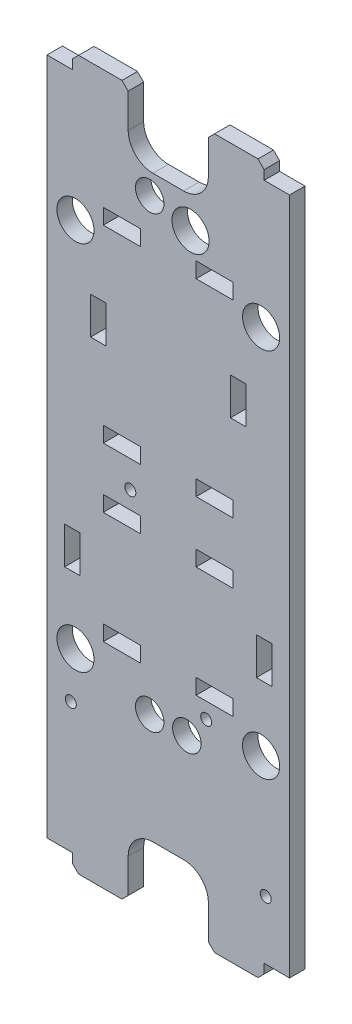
ISO-10303-21;
HEADER;
FILE_DESCRIPTION(('STEP AP214'),'2;1');
FILE_NAME('part.step','',(''),(''),'','','');
FILE_SCHEMA(('AUTOMOTIVE_DESIGN { 1 0 10303 214 1 1 1 1 }'));
ENDSEC;
DATA;
#1=APPLICATION_CONTEXT('core data for automotive mechanical design processes');
#2=APPLICATION_PROTOCOL_DEFINITION('international standard','automotive_design',2000,#1);
#3=PRODUCT_CONTEXT('',#1,'mechanical');
#4=PRODUCT('Part','Part','',(#3));
#5=PRODUCT_RELATED_PRODUCT_CATEGORY('part','',(#4));
#6=PRODUCT_DEFINITION_FORMATION('','',#4);
#7=PRODUCT_DEFINITION_CONTEXT('part definition',#1,'design');
#8=PRODUCT_DEFINITION('design','',#6,#7);
#9=PRODUCT_DEFINITION_SHAPE('','',#8);
#10=(LENGTH_UNIT() NAMED_UNIT(*) SI_UNIT(.MILLI.,.METRE.));
#11=(NAMED_UNIT(*) PLANE_ANGLE_UNIT() SI_UNIT($,.RADIAN.));
#12=(NAMED_UNIT(*) SI_UNIT($,.STERADIAN.) SOLID_ANGLE_UNIT());
#13=UNCERTAINTY_MEASURE_WITH_UNIT(LENGTH_MEASURE(1.E-05),#10,'distance_accuracy_value','');
#14=(GEOMETRIC_REPRESENTATION_CONTEXT(3) GLOBAL_UNCERTAINTY_ASSIGNED_CONTEXT((#13)) GLOBAL_UNIT_ASSIGNED_CONTEXT((#10,
#11,#12)) REPRESENTATION_CONTEXT('',''));
#15=CARTESIAN_POINT('',(0.,0.,0.));
#16=DIRECTION('',(0.,0.,1.));
#17=DIRECTION('',(1.,0.,0.));
#18=AXIS2_PLACEMENT_3D('',#15,#16,#17);
#19=CARTESIAN_POINT('',(-24.892,72.771,3.175));
#20=DIRECTION('',(0.,-1.,0.));
#21=DIRECTION('',(0.,0.,-1.));
#22=AXIS2_PLACEMENT_3D('',#19,#20,#21);
#23=PLANE('',#22);
#24=DIRECTION('',(-1.,0.,0.));
#25=VECTOR('',#24,1.);
#26=CARTESIAN_POINT('',(-24.892,72.771,3.175));
#27=LINE('',#26,#25);
#28=CARTESIAN_POINT('',(-9.49959999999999,72.771,3.175));
#29=VERTEX_POINT('',#28);
#30=CARTESIAN_POINT('',(-18.415,72.771,3.175));
#31=VERTEX_POINT('',#30);
#32=EDGE_CURVE('E1350',#29,#31,#27,.T.);
#33=ORIENTED_EDGE('',*,*,#32,.F.);
#34=DIRECTION('',(0.,0.,-1.));
#35=VECTOR('',#34,1.);
#36=CARTESIAN_POINT('',(-9.49959999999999,72.771,3.175));
#37=LINE('',#36,#35);
#38=CARTESIAN_POINT('',(-9.49959999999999,72.771,0.));
#39=VERTEX_POINT('',#38);
#40=EDGE_CURVE('E1409',#29,#39,#37,.T.);
#41=ORIENTED_EDGE('',*,*,#40,.T.);
#42=DIRECTION('',(-1.,0.,0.));
#43=VECTOR('',#42,1.);
#44=CARTESIAN_POINT('',(-24.892,72.771,0.));
#45=LINE('',#44,#43);
#46=CARTESIAN_POINT('',(-18.415,72.771,0.));
#47=VERTEX_POINT('',#46);
#48=EDGE_CURVE('E1368',#39,#47,#45,.T.);
#49=ORIENTED_EDGE('',*,*,#48,.T.);
#50=DIRECTION('',(0.,0.,1.));
#51=VECTOR('',#50,1.);
#52=CARTESIAN_POINT('',(-18.415,72.771,3.175));
#53=LINE('',#52,#51);
#54=EDGE_CURVE('E1405',#47,#31,#53,.T.);
#55=ORIENTED_EDGE('',*,*,#54,.T.);
#56=EDGE_LOOP('',(#33,#41,#49,#55));
#57=FACE_BOUND('',#56,.T.);
#58=ADVANCED_FACE('F42',(#57),#23,.F.);
#59=CARTESIAN_POINT('',(-24.892,-72.771,3.175));
#60=DIRECTION('',(0.,1.,0.));
#61=DIRECTION('',(0.,0.,1.));
#62=AXIS2_PLACEMENT_3D('',#59,#60,#61);
#63=PLANE('',#62);
#64=DIRECTION('',(1.,0.,0.));
#65=VECTOR('',#64,1.);
#66=CARTESIAN_POINT('',(-24.892,-72.771,0.));
#67=LINE('',#66,#65);
#68=CARTESIAN_POINT('',(9.49959999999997,-72.771,0.));
#69=VERTEX_POINT('',#68);
#70=CARTESIAN_POINT('',(18.415,-72.771,0.));
#71=VERTEX_POINT('',#70);
#72=EDGE_CURVE('E1377',#69,#71,#67,.T.);
#73=ORIENTED_EDGE('',*,*,#72,.T.);
#74=DIRECTION('',(0.,0.,1.));
#75=VECTOR('',#74,1.);
#76=CARTESIAN_POINT('',(18.415,-72.771,3.175));
#77=LINE('',#76,#75);
#78=CARTESIAN_POINT('',(18.415,-72.771,3.175));
#79=VERTEX_POINT('',#78);
#80=EDGE_CURVE('E1499',#71,#79,#77,.T.);
#81=ORIENTED_EDGE('',*,*,#80,.T.);
#82=DIRECTION('',(1.,0.,0.));
#83=VECTOR('',#82,1.);
#84=CARTESIAN_POINT('',(-24.892,-72.771,3.175));
#85=LINE('',#84,#83);
#86=CARTESIAN_POINT('',(9.49959999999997,-72.771,3.175));
#87=VERTEX_POINT('',#86);
#88=EDGE_CURVE('E1360',#87,#79,#85,.T.);
#89=ORIENTED_EDGE('',*,*,#88,.F.);
#90=DIRECTION('',(0.,0.,-1.));
#91=VECTOR('',#90,1.);
#92=CARTESIAN_POINT('',(9.49959999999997,-72.771,3.175));
#93=LINE('',#92,#91);
#94=EDGE_CURVE('E1495',#87,#69,#93,.T.);
#95=ORIENTED_EDGE('',*,*,#94,.T.);
#96=EDGE_LOOP('',(#73,#81,#89,#95));
#97=FACE_BOUND('',#96,.T.);
#98=ADVANCED_FACE('F1520',(#97),#63,.F.);
#99=CARTESIAN_POINT('',(24.892,72.771,3.175));
#100=DIRECTION('',(-1.,0.,0.));
#101=DIRECTION('',(0.,-1.,0.));
#102=AXIS2_PLACEMENT_3D('',#99,#100,#101);
#103=PLANE('',#102);
#104=DIRECTION('',(0.,1.,0.));
#105=VECTOR('',#104,1.);
#106=CARTESIAN_POINT('',(24.892,72.771,0.));
#107=LINE('',#106,#105);
#108=CARTESIAN_POINT('',(24.892,-69.596,0.));
#109=VERTEX_POINT('',#108);
#110=CARTESIAN_POINT('',(24.892,69.596,0.));
#111=VERTEX_POINT('',#110);
#112=EDGE_CURVE('E1345',#109,#111,#107,.T.);
#113=ORIENTED_EDGE('',*,*,#112,.T.);
#114=DIRECTION('',(0.,0.,1.));
#115=VECTOR('',#114,1.);
#116=CARTESIAN_POINT('',(24.892,69.596,3.175));
#117=LINE('',#116,#115);
#118=CARTESIAN_POINT('',(24.892,69.596,3.175));
#119=VERTEX_POINT('',#118);
#120=EDGE_CURVE('E1341',#111,#119,#117,.T.);
#121=ORIENTED_EDGE('',*,*,#120,.T.);
#122=DIRECTION('',(0.,1.,0.));
#123=VECTOR('',#122,1.);
#124=CARTESIAN_POINT('',(24.892,72.771,3.175));
#125=LINE('',#124,#123);
#126=CARTESIAN_POINT('',(24.892,-69.596,3.175));
#127=VERTEX_POINT('',#126);
#128=EDGE_CURVE('E1346',#127,#119,#125,.T.);
#129=ORIENTED_EDGE('',*,*,#128,.F.);
#130=DIRECTION('',(0.,0.,-1.));
#131=VECTOR('',#130,1.);
#132=CARTESIAN_POINT('',(24.892,-69.596,3.175));
#133=LINE('',#132,#131);
#134=EDGE_CURVE('E1326',#127,#109,#133,.T.);
#135=ORIENTED_EDGE('',*,*,#134,.T.);
#136=EDGE_LOOP('',(#113,#121,#129,#135));
#137=FACE_BOUND('',#136,.T.);
#138=ADVANCED_FACE('F1613',(#137),#103,.F.);
#139=CARTESIAN_POINT('',(18.415,72.771,0.));
#140=VERTEX_POINT('',#139);
#141=CARTESIAN_POINT('',(9.49959999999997,72.771,0.));
#142=VERTEX_POINT('',#141);
#143=EDGE_CURVE('E1369',#140,#142,#45,.T.);
#144=ORIENTED_EDGE('',*,*,#143,.T.);
#145=DIRECTION('',(0.,0.,1.));
#146=VECTOR('',#145,1.);
#147=CARTESIAN_POINT('',(9.49959999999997,72.771,3.175));
#148=LINE('',#147,#146);
#149=CARTESIAN_POINT('',(9.49959999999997,72.771,3.175));
#150=VERTEX_POINT('',#149);
#151=EDGE_CURVE('E1471',#142,#150,#148,.T.);
#152=ORIENTED_EDGE('',*,*,#151,.T.);
#153=CARTESIAN_POINT('',(18.415,72.771,3.175));
#154=VERTEX_POINT('',#153);
#155=EDGE_CURVE('E1352',#154,#150,#27,.T.);
#156=ORIENTED_EDGE('',*,*,#155,.F.);
#157=DIRECTION('',(0.,0.,-1.));
#158=VECTOR('',#157,1.);
#159=CARTESIAN_POINT('',(18.415,72.771,3.175));
#160=LINE('',#159,#158);
#161=EDGE_CURVE('E1467',#154,#140,#160,.T.);
#162=ORIENTED_EDGE('',*,*,#161,.T.);
#163=EDGE_LOOP('',(#144,#152,#156,#162));
#164=FACE_BOUND('',#163,.T.);
#165=ADVANCED_FACE('F1608',(#164),#23,.F.);
#166=CARTESIAN_POINT('',(-24.892,72.771,3.175));
#167=DIRECTION('',(1.,0.,0.));
#168=DIRECTION('',(0.,1.,0.));
#169=AXIS2_PLACEMENT_3D('',#166,#167,#168);
#170=PLANE('',#169);
#171=DIRECTION('',(0.,-1.,0.));
#172=VECTOR('',#171,1.);
#173=CARTESIAN_POINT('',(-24.892,72.771,3.175));
#174=LINE('',#173,#172);
#175=CARTESIAN_POINT('',(-24.892,69.596,3.175));
#176=VERTEX_POINT('',#175);
#177=CARTESIAN_POINT('',(-24.892,-69.596,3.175));
#178=VERTEX_POINT('',#177);
#179=EDGE_CURVE('E1356',#176,#178,#174,.T.);
#180=ORIENTED_EDGE('',*,*,#179,.F.);
#181=DIRECTION('',(0.,0.,-1.));
#182=VECTOR('',#181,1.);
#183=CARTESIAN_POINT('',(-24.892,69.596,3.175));
#184=LINE('',#183,#182);
#185=CARTESIAN_POINT('',(-24.892,69.596,0.));
#186=VERTEX_POINT('',#185);
#187=EDGE_CURVE('E1337',#176,#186,#184,.T.);
#188=ORIENTED_EDGE('',*,*,#187,.T.);
#189=DIRECTION('',(0.,-1.,0.));
#190=VECTOR('',#189,1.);
#191=CARTESIAN_POINT('',(-24.892,72.771,0.));
#192=LINE('',#191,#190);
#193=CARTESIAN_POINT('',(-24.892,-69.596,0.));
#194=VERTEX_POINT('',#193);
#195=EDGE_CURVE('E1373',#186,#194,#192,.T.);
#196=ORIENTED_EDGE('',*,*,#195,.T.);
#197=DIRECTION('',(0.,0.,1.));
#198=VECTOR('',#197,1.);
#199=CARTESIAN_POINT('',(-24.892,-69.596,3.175));
#200=LINE('',#199,#198);
#201=EDGE_CURVE('E1333',#194,#178,#200,.T.);
#202=ORIENTED_EDGE('',*,*,#201,.T.);
#203=EDGE_LOOP('',(#180,#188,#196,#202));
#204=FACE_BOUND('',#203,.T.);
#205=ADVANCED_FACE('F1549',(#204),#170,.F.);
#206=CARTESIAN_POINT('',(-18.415,-72.771,3.175));
#207=VERTEX_POINT('',#206);
#208=CARTESIAN_POINT('',(-9.49959999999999,-72.771,3.175));
#209=VERTEX_POINT('',#208);
#210=EDGE_CURVE('E1364',#207,#209,#85,.T.);
#211=ORIENTED_EDGE('',*,*,#210,.F.);
#212=DIRECTION('',(0.,0.,-1.));
#213=VECTOR('',#212,1.);
#214=CARTESIAN_POINT('',(-18.415,-72.771,3.175));
#215=LINE('',#214,#213);
#216=CARTESIAN_POINT('',(-18.415,-72.771,0.));
#217=VERTEX_POINT('',#216);
#218=EDGE_CURVE('E1485',#207,#217,#215,.T.);
#219=ORIENTED_EDGE('',*,*,#218,.T.);
#220=CARTESIAN_POINT('',(-9.49959999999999,-72.771,0.));
#221=VERTEX_POINT('',#220);
#222=EDGE_CURVE('E1351',#217,#221,#67,.T.);
#223=ORIENTED_EDGE('',*,*,#222,.T.);
#224=DIRECTION('',(0.,0.,1.));
#225=VECTOR('',#224,1.);
#226=CARTESIAN_POINT('',(-9.49959999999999,-72.771,3.175));
#227=LINE('',#226,#225);
#228=EDGE_CURVE('E1481',#221,#209,#227,.T.);
#229=ORIENTED_EDGE('',*,*,#228,.T.);
#230=EDGE_LOOP('',(#211,#219,#223,#229));
#231=FACE_BOUND('',#230,.T.);
#232=ADVANCED_FACE('F1566',(#231),#63,.F.);
#233=CARTESIAN_POINT('',(0.,0.,3.175));
#234=DIRECTION('',(0.,0.,1.));
#235=DIRECTION('',(1.,0.,0.));
#236=AXIS2_PLACEMENT_3D('',#233,#234,#235);
#237=PLANE('',#236);
#238=DIRECTION('',(0.,1.,0.));
#239=VECTOR('',#238,1.);
#240=CARTESIAN_POINT('',(15.938253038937,23.916041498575,3.175));
#241=LINE('',#240,#239);
#242=CARTESIAN_POINT('',(15.938253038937,23.916041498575,3.175));
#243=VERTEX_POINT('',#242);
#244=CARTESIAN_POINT('',(15.938253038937,31.536041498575,3.175));
#245=VERTEX_POINT('',#244);
#246=EDGE_CURVE('E59',#243,#245,#241,.T.);
#247=ORIENTED_EDGE('',*,*,#246,.F.);
#248=DIRECTION('',(1.,0.,0.));
#249=VECTOR('',#248,1.);
#250=CARTESIAN_POINT('',(12.763253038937,23.916041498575,3.175));
#251=LINE('',#250,#249);
#252=CARTESIAN_POINT('',(12.763253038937,23.916041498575,3.175));
#253=VERTEX_POINT('',#252);
#254=EDGE_CURVE('E644',#253,#243,#251,.T.);
#255=ORIENTED_EDGE('',*,*,#254,.F.);
#256=DIRECTION('',(0.,-1.,0.));
#257=VECTOR('',#256,1.);
#258=CARTESIAN_POINT('',(12.763253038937,23.916041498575,3.175));
#259=LINE('',#258,#257);
#260=CARTESIAN_POINT('',(12.763253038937,31.536041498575,3.175));
#261=VERTEX_POINT('',#260);
#262=EDGE_CURVE('E663',#261,#253,#259,.T.);
#263=ORIENTED_EDGE('',*,*,#262,.F.);
#264=DIRECTION('',(-1.,0.,0.));
#265=VECTOR('',#264,1.);
#266=CARTESIAN_POINT('',(12.763253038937,31.536041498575,3.175));
#267=LINE('',#266,#265);
#268=EDGE_CURVE('E659',#245,#261,#267,.T.);
#269=ORIENTED_EDGE('',*,*,#268,.F.);
#270=EDGE_LOOP('',(#247,#255,#263,#269));
#271=FACE_BOUND('',#270,.T.);
#272=DIRECTION('',(-1.,0.,0.));
#273=VECTOR('',#272,1.);
#274=CARTESIAN_POINT('',(-13.335,9.55597711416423,3.175));
#275=LINE('',#274,#273);
#276=CARTESIAN_POINT('',(-5.715,9.55597711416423,3.175));
#277=VERTEX_POINT('',#276);
#278=CARTESIAN_POINT('',(-13.335,9.55597711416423,3.175));
#279=VERTEX_POINT('',#278);
#280=EDGE_CURVE('E67',#277,#279,#275,.T.);
#281=ORIENTED_EDGE('',*,*,#280,.F.);
#282=DIRECTION('',(0.,1.,0.));
#283=VECTOR('',#282,1.);
#284=CARTESIAN_POINT('',(-5.715,9.55597711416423,3.175));
#285=LINE('',#284,#283);
#286=CARTESIAN_POINT('',(-5.71499999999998,6.38097711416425,3.175));
#287=VERTEX_POINT('',#286);
#288=EDGE_CURVE('E600',#287,#277,#285,.T.);
#289=ORIENTED_EDGE('',*,*,#288,.F.);
#290=DIRECTION('',(1.,0.,0.));
#291=VECTOR('',#290,1.);
#292=CARTESIAN_POINT('',(-13.335,6.38097711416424,3.175));
#293=LINE('',#292,#291);
#294=CARTESIAN_POINT('',(-13.335,6.38097711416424,3.175));
#295=VERTEX_POINT('',#294);
#296=EDGE_CURVE('E620',#295,#287,#293,.T.);
#297=ORIENTED_EDGE('',*,*,#296,.F.);
#298=DIRECTION('',(0.,-1.,0.));
#299=VECTOR('',#298,1.);
#300=CARTESIAN_POINT('',(-13.335,9.55597711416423,3.175));
#301=LINE('',#300,#299);
#302=EDGE_CURVE('E615',#279,#295,#301,.T.);
#303=ORIENTED_EDGE('',*,*,#302,.F.);
#304=EDGE_LOOP('',(#281,#289,#297,#303));
#305=FACE_BOUND('',#304,.T.);
#306=DIRECTION('',(-1.,0.,0.));
#307=VECTOR('',#306,1.);
#308=CARTESIAN_POINT('',(13.335,9.55597711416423,3.175));
#309=LINE('',#308,#307);
#310=CARTESIAN_POINT('',(13.335,9.55597711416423,3.175));
#311=VERTEX_POINT('',#310);
#312=CARTESIAN_POINT('',(5.71499999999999,9.55597711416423,3.175));
#313=VERTEX_POINT('',#312);
#314=EDGE_CURVE('E630',#311,#313,#309,.T.);
#315=ORIENTED_EDGE('',*,*,#314,.F.);
#316=DIRECTION('',(0.,1.,0.));
#317=VECTOR('',#316,1.);
#318=CARTESIAN_POINT('',(13.335,9.55597711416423,3.175));
#319=LINE('',#318,#317);
#320=CARTESIAN_POINT('',(13.335,6.38097711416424,3.175));
#321=VERTEX_POINT('',#320);
#322=EDGE_CURVE('E731',#321,#311,#319,.T.);
#323=ORIENTED_EDGE('',*,*,#322,.F.);
#324=DIRECTION('',(1.,0.,0.));
#325=VECTOR('',#324,1.);
#326=CARTESIAN_POINT('',(13.335,6.38097711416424,3.175));
#327=LINE('',#326,#325);
#328=CARTESIAN_POINT('',(5.71499999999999,6.38097711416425,3.175));
#329=VERTEX_POINT('',#328);
#330=EDGE_CURVE('E750',#329,#321,#327,.T.);
#331=ORIENTED_EDGE('',*,*,#330,.F.);
#332=DIRECTION('',(0.,-1.,0.));
#333=VECTOR('',#332,1.);
#334=CARTESIAN_POINT('',(5.71499999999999,9.55597711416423,3.175));
#335=LINE('',#334,#333);
#336=EDGE_CURVE('E746',#313,#329,#335,.T.);
#337=ORIENTED_EDGE('',*,*,#336,.F.);
#338=EDGE_LOOP('',(#315,#323,#331,#337));
#339=FACE_BOUND('',#338,.T.);
#340=DIRECTION('',(0.,1.,0.));
#341=VECTOR('',#340,1.);
#342=CARTESIAN_POINT('',(13.335,45.1159771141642,3.175));
#343=LINE('',#342,#341);
#344=CARTESIAN_POINT('',(13.335,45.1159771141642,3.175));
#345=VERTEX_POINT('',#344);
#346=CARTESIAN_POINT('',(13.335,48.2909771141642,3.175));
#347=VERTEX_POINT('',#346);
#348=EDGE_CURVE('E698',#345,#347,#343,.T.);
#349=ORIENTED_EDGE('',*,*,#348,.F.);
#350=DIRECTION('',(1.,0.,0.));
#351=VECTOR('',#350,1.);
#352=CARTESIAN_POINT('',(13.335,45.1159771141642,3.175));
#353=LINE('',#352,#351);
#354=CARTESIAN_POINT('',(5.71499999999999,45.1159771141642,3.175));
#355=VERTEX_POINT('',#354);
#356=EDGE_CURVE('E685',#355,#345,#353,.T.);
#357=ORIENTED_EDGE('',*,*,#356,.F.);
#358=DIRECTION('',(0.,-1.,0.));
#359=VECTOR('',#358,1.);
#360=CARTESIAN_POINT('',(5.71499999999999,45.1159771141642,3.175));
#361=LINE('',#360,#359);
#362=CARTESIAN_POINT('',(5.71499999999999,48.2909771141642,3.175));
#363=VERTEX_POINT('',#362);
#364=EDGE_CURVE('E706',#363,#355,#361,.T.);
#365=ORIENTED_EDGE('',*,*,#364,.F.);
#366=DIRECTION('',(-1.,0.,0.));
#367=VECTOR('',#366,1.);
#368=CARTESIAN_POINT('',(13.335,48.2909771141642,3.175));
#369=LINE('',#368,#367);
#370=EDGE_CURVE('E701',#347,#363,#369,.T.);
#371=ORIENTED_EDGE('',*,*,#370,.F.);
#372=EDGE_LOOP('',(#349,#357,#365,#371));
#373=FACE_BOUND('',#372,.T.);
#374=DIRECTION('',(0.,1.,0.));
#375=VECTOR('',#374,1.);
#376=CARTESIAN_POINT('',(-12.763253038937,23.916041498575,3.175));
#377=LINE('',#376,#375);
#378=CARTESIAN_POINT('',(-12.763253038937,23.916041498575,3.175));
#379=VERTEX_POINT('',#378);
#380=CARTESIAN_POINT('',(-12.763253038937,31.536041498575,3.175));
#381=VERTEX_POINT('',#380);
#382=EDGE_CURVE('E547',#379,#381,#377,.T.);
#383=ORIENTED_EDGE('',*,*,#382,.F.);
#384=DIRECTION('',(1.,0.,0.));
#385=VECTOR('',#384,1.);
#386=CARTESIAN_POINT('',(-12.763253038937,23.916041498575,3.175));
#387=LINE('',#386,#385);
#388=CARTESIAN_POINT('',(-15.938253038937,23.916041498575,3.175));
#389=VERTEX_POINT('',#388);
#390=EDGE_CURVE('E568',#389,#379,#387,.T.);
#391=ORIENTED_EDGE('',*,*,#390,.F.);
#392=DIRECTION('',(0.,-1.,0.));
#393=VECTOR('',#392,1.);
#394=CARTESIAN_POINT('',(-15.938253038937,23.916041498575,3.175));
#395=LINE('',#394,#393);
#396=CARTESIAN_POINT('',(-15.938253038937,31.536041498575,3.175));
#397=VERTEX_POINT('',#396);
#398=EDGE_CURVE('E572',#397,#389,#395,.T.);
#399=ORIENTED_EDGE('',*,*,#398,.F.);
#400=DIRECTION('',(-1.,0.,0.));
#401=VECTOR('',#400,1.);
#402=CARTESIAN_POINT('',(-12.763253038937,31.536041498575,3.175));
#403=LINE('',#402,#401);
#404=EDGE_CURVE('E581',#381,#397,#403,.T.);
#405=ORIENTED_EDGE('',*,*,#404,.F.);
#406=EDGE_LOOP('',(#383,#391,#399,#405));
#407=FACE_BOUND('',#406,.T.);
#408=DIRECTION('',(0.,-1.,0.));
#409=VECTOR('',#408,1.);
#410=CARTESIAN_POINT('',(-13.335,45.1159771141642,3.175));
#411=LINE('',#410,#409);
#412=CARTESIAN_POINT('',(-13.335,48.2909771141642,3.175));
#413=VERTEX_POINT('',#412);
#414=CARTESIAN_POINT('',(-13.335,45.1159771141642,3.175));
#415=VERTEX_POINT('',#414);
#416=EDGE_CURVE('E716',#413,#415,#411,.T.);
#417=ORIENTED_EDGE('',*,*,#416,.F.);
#418=DIRECTION('',(-1.,0.,0.));
#419=VECTOR('',#418,1.);
#420=CARTESIAN_POINT('',(-13.335,48.2909771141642,3.175));
#421=LINE('',#420,#419);
#422=CARTESIAN_POINT('',(-5.71499999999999,48.2909771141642,3.175));
#423=VERTEX_POINT('',#422);
#424=EDGE_CURVE('E773',#423,#413,#421,.T.);
#425=ORIENTED_EDGE('',*,*,#424,.F.);
#426=DIRECTION('',(0.,1.,0.));
#427=VECTOR('',#426,1.);
#428=CARTESIAN_POINT('',(-5.715,45.1159771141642,3.175));
#429=LINE('',#428,#427);
#430=CARTESIAN_POINT('',(-5.715,45.1159771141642,3.175));
#431=VERTEX_POINT('',#430);
#432=EDGE_CURVE('E792',#431,#423,#429,.T.);
#433=ORIENTED_EDGE('',*,*,#432,.F.);
#434=DIRECTION('',(1.,0.,0.));
#435=VECTOR('',#434,1.);
#436=CARTESIAN_POINT('',(-13.335,45.1159771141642,3.175));
#437=LINE('',#436,#435);
#438=EDGE_CURVE('E788',#415,#431,#437,.T.);
#439=ORIENTED_EDGE('',*,*,#438,.F.);
#440=EDGE_LOOP('',(#417,#425,#433,#439));
#441=FACE_BOUND('',#440,.T.);
#442=CARTESIAN_POINT('',(-7.78509999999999,0.850131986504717,3.175));
#443=DIRECTION('',(0.,0.,1.));
#444=DIRECTION('',(1.,0.,0.));
#445=AXIS2_PLACEMENT_3D('',#442,#443,#444);
#446=CIRCLE('',#445,1.13029999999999);
#447=CARTESIAN_POINT('',(-6.65480000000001,0.850131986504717,3.175));
#448=VERTEX_POINT('',#447);
#449=EDGE_CURVE('E802',#448,#448,#446,.T.);
#450=ORIENTED_EDGE('',*,*,#449,.F.);
#451=EDGE_LOOP('',(#450));
#452=FACE_BOUND('',#451,.T.);
#453=CARTESIAN_POINT('',(7.78510000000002,-32.1698680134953,3.175));
#454=DIRECTION('',(0.,0.,1.));
#455=DIRECTION('',(1.,0.,0.));
#456=AXIS2_PLACEMENT_3D('',#453,#454,#455);
#457=CIRCLE('',#456,1.13029999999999);
#458=CARTESIAN_POINT('',(8.9154,-32.1698680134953,3.175));
#459=VERTEX_POINT('',#458);
#460=EDGE_CURVE('E819',#459,#459,#457,.T.);
#461=ORIENTED_EDGE('',*,*,#460,.F.);
#462=EDGE_LOOP('',(#461));
#463=FACE_BOUND('',#462,.T.);
#464=DIRECTION('',(0.,1.,0.));
#465=VECTOR('',#464,1.);
#466=CARTESIAN_POINT('',(-18.0975,-11.9755642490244,3.175));
#467=LINE('',#466,#465);
#468=CARTESIAN_POINT('',(-18.0975,-19.5955642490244,3.175));
#469=VERTEX_POINT('',#468);
#470=CARTESIAN_POINT('',(-18.0975,-11.9755642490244,3.175));
#471=VERTEX_POINT('',#470);
#472=EDGE_CURVE('E846',#469,#471,#467,.T.);
#473=ORIENTED_EDGE('',*,*,#472,.F.);
#474=DIRECTION('',(1.,0.,0.));
#475=VECTOR('',#474,1.);
#476=CARTESIAN_POINT('',(-21.2725,-19.5955642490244,3.175));
#477=LINE('',#476,#475);
#478=CARTESIAN_POINT('',(-21.2725,-19.5955642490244,3.175));
#479=VERTEX_POINT('',#478);
#480=EDGE_CURVE('E833',#479,#469,#477,.T.);
#481=ORIENTED_EDGE('',*,*,#480,.F.);
#482=DIRECTION('',(0.,-1.,0.));
#483=VECTOR('',#482,1.);
#484=CARTESIAN_POINT('',(-21.2725,-11.9755642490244,3.175));
#485=LINE('',#484,#483);
#486=CARTESIAN_POINT('',(-21.2725,-11.9755642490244,3.175));
#487=VERTEX_POINT('',#486);
#488=EDGE_CURVE('E854',#487,#479,#485,.T.);
#489=ORIENTED_EDGE('',*,*,#488,.F.);
#490=DIRECTION('',(-1.,0.,0.));
#491=VECTOR('',#490,1.);
#492=CARTESIAN_POINT('',(-21.2725,-11.9755642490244,3.175));
#493=LINE('',#492,#491);
#494=EDGE_CURVE('E849',#471,#487,#493,.T.);
#495=ORIENTED_EDGE('',*,*,#494,.F.);
#496=EDGE_LOOP('',(#473,#481,#489,#495));
#497=FACE_BOUND('',#496,.T.);
#498=DIRECTION('',(0.,1.,0.));
#499=VECTOR('',#498,1.);
#500=CARTESIAN_POINT('',(13.335,-2.95848227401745,3.175));
#501=LINE('',#500,#499);
#502=CARTESIAN_POINT('',(13.335,-6.13348227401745,3.175));
#503=VERTEX_POINT('',#502);
#504=CARTESIAN_POINT('',(13.335,-2.95848227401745,3.175));
#505=VERTEX_POINT('',#504);
#506=EDGE_CURVE('E827',#503,#505,#501,.T.);
#507=ORIENTED_EDGE('',*,*,#506,.F.);
#508=DIRECTION('',(1.,0.,0.));
#509=VECTOR('',#508,1.);
#510=CARTESIAN_POINT('',(5.71499999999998,-6.13348227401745,3.175));
#511=LINE('',#510,#509);
#512=CARTESIAN_POINT('',(5.71499999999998,-6.13348227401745,3.175));
#513=VERTEX_POINT('',#512);
#514=EDGE_CURVE('E879',#513,#503,#511,.T.);
#515=ORIENTED_EDGE('',*,*,#514,.F.);
#516=DIRECTION('',(0.,-1.,0.));
#517=VECTOR('',#516,1.);
#518=CARTESIAN_POINT('',(5.71499999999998,-2.95848227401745,3.175));
#519=LINE('',#518,#517);
#520=CARTESIAN_POINT('',(5.71499999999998,-2.95848227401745,3.175));
#521=VERTEX_POINT('',#520);
#522=EDGE_CURVE('E898',#521,#513,#519,.T.);
#523=ORIENTED_EDGE('',*,*,#522,.F.);
#524=DIRECTION('',(-1.,0.,0.));
#525=VECTOR('',#524,1.);
#526=CARTESIAN_POINT('',(5.71499999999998,-2.95848227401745,3.175));
#527=LINE('',#526,#525);
#528=EDGE_CURVE('E894',#505,#521,#527,.T.);
#529=ORIENTED_EDGE('',*,*,#528,.F.);
#530=EDGE_LOOP('',(#507,#515,#523,#529));
#531=FACE_BOUND('',#530,.T.);
#532=DIRECTION('',(0.,1.,0.));
#533=VECTOR('',#532,1.);
#534=CARTESIAN_POINT('',(-5.71499999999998,-2.75528227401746,3.175));
#535=LINE('',#534,#533);
#536=CARTESIAN_POINT('',(-5.71499999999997,-5.93028227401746,3.175));
#537=VERTEX_POINT('',#536);
#538=CARTESIAN_POINT('',(-5.71499999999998,-2.75528227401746,3.175));
#539=VERTEX_POINT('',#538);
#540=EDGE_CURVE('E908',#537,#539,#535,.T.);
#541=ORIENTED_EDGE('',*,*,#540,.F.);
#542=DIRECTION('',(1.,0.,0.));
#543=VECTOR('',#542,1.);
#544=CARTESIAN_POINT('',(-13.335,-5.93028227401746,3.175));
#545=LINE('',#544,#543);
#546=CARTESIAN_POINT('',(-13.335,-5.93028227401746,3.175));
#547=VERTEX_POINT('',#546);
#548=EDGE_CURVE('E1055',#547,#537,#545,.T.);
#549=ORIENTED_EDGE('',*,*,#548,.F.);
#550=DIRECTION('',(0.,-1.,0.));
#551=VECTOR('',#550,1.);
#552=CARTESIAN_POINT('',(-13.335,-2.75528227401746,3.175));
#553=LINE('',#552,#551);
#554=CARTESIAN_POINT('',(-13.335,-2.75528227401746,3.175));
#555=VERTEX_POINT('',#554);
#556=EDGE_CURVE('E1074',#555,#547,#553,.T.);
#557=ORIENTED_EDGE('',*,*,#556,.F.);
#558=DIRECTION('',(-1.,0.,0.));
#559=VECTOR('',#558,1.);
#560=CARTESIAN_POINT('',(-13.335,-2.75528227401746,3.175));
#561=LINE('',#560,#559);
#562=EDGE_CURVE('E1070',#539,#555,#561,.T.);
#563=ORIENTED_EDGE('',*,*,#562,.F.);
#564=EDGE_LOOP('',(#541,#549,#557,#563));
#565=FACE_BOUND('',#564,.T.);
#566=DIRECTION('',(0.,1.,0.));
#567=VECTOR('',#566,1.);
#568=CARTESIAN_POINT('',(21.2725,-11.9755642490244,3.175));
#569=LINE('',#568,#567);
#570=CARTESIAN_POINT('',(21.2725,-19.5955642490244,3.175));
#571=VERTEX_POINT('',#570);
#572=CARTESIAN_POINT('',(21.2725,-11.9755642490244,3.175));
#573=VERTEX_POINT('',#572);
#574=EDGE_CURVE('E1024',#571,#573,#569,.T.);
#575=ORIENTED_EDGE('',*,*,#574,.F.);
#576=DIRECTION('',(1.,0.,0.));
#577=VECTOR('',#576,1.);
#578=CARTESIAN_POINT('',(21.2725,-19.5955642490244,3.175));
#579=LINE('',#578,#577);
#580=CARTESIAN_POINT('',(18.0975,-19.5955642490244,3.175));
#581=VERTEX_POINT('',#580);
#582=EDGE_CURVE('E1011',#581,#571,#579,.T.);
#583=ORIENTED_EDGE('',*,*,#582,.F.);
#584=DIRECTION('',(0.,-1.,0.));
#585=VECTOR('',#584,1.);
#586=CARTESIAN_POINT('',(18.0975,-11.9755642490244,3.175));
#587=LINE('',#586,#585);
#588=CARTESIAN_POINT('',(18.0975,-11.9755642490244,3.175));
#589=VERTEX_POINT('',#588);
#590=EDGE_CURVE('E1032',#589,#581,#587,.T.);
#591=ORIENTED_EDGE('',*,*,#590,.F.);
#592=DIRECTION('',(-1.,0.,0.));
#593=VECTOR('',#592,1.);
#594=CARTESIAN_POINT('',(21.2725,-11.9755642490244,3.175));
#595=LINE('',#594,#593);
#596=EDGE_CURVE('E1027',#573,#589,#595,.T.);
#597=ORIENTED_EDGE('',*,*,#596,.F.);
#598=EDGE_LOOP('',(#575,#583,#591,#597));
#599=FACE_BOUND('',#598,.T.);
#600=DIRECTION('',(0.,1.,0.));
#601=VECTOR('',#600,1.);
#602=CARTESIAN_POINT('',(-5.715,-25.7484771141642,3.175));
#603=LINE('',#602,#601);
#604=CARTESIAN_POINT('',(-5.715,-28.9234771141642,3.175));
#605=VERTEX_POINT('',#604);
#606=CARTESIAN_POINT('',(-5.715,-25.7484771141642,3.175));
#607=VERTEX_POINT('',#606);
#608=EDGE_CURVE('E980',#605,#607,#603,.T.);
#609=ORIENTED_EDGE('',*,*,#608,.F.);
#610=DIRECTION('',(1.,0.,0.));
#611=VECTOR('',#610,1.);
#612=CARTESIAN_POINT('',(-13.335,-28.9234771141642,3.175));
#613=LINE('',#612,#611);
#614=CARTESIAN_POINT('',(-13.335,-28.9234771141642,3.175));
#615=VERTEX_POINT('',#614);
#616=EDGE_CURVE('E967',#615,#605,#613,.T.);
#617=ORIENTED_EDGE('',*,*,#616,.F.);
#618=DIRECTION('',(0.,-1.,0.));
#619=VECTOR('',#618,1.);
#620=CARTESIAN_POINT('',(-13.335,-25.7484771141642,3.175));
#621=LINE('',#620,#619);
#622=CARTESIAN_POINT('',(-13.335,-25.7484771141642,3.175));
#623=VERTEX_POINT('',#622);
#624=EDGE_CURVE('E988',#623,#615,#621,.T.);
#625=ORIENTED_EDGE('',*,*,#624,.F.);
#626=DIRECTION('',(-1.,0.,0.));
#627=VECTOR('',#626,1.);
#628=CARTESIAN_POINT('',(-13.335,-25.7484771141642,3.175));
#629=LINE('',#628,#627);
#630=EDGE_CURVE('E983',#607,#623,#629,.T.);
#631=ORIENTED_EDGE('',*,*,#630,.F.);
#632=EDGE_LOOP('',(#609,#617,#625,#631));
#633=FACE_BOUND('',#632,.T.);
#634=DIRECTION('',(0.,1.,0.));
#635=VECTOR('',#634,1.);
#636=CARTESIAN_POINT('',(13.335,-25.7484771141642,3.175));
#637=LINE('',#636,#635);
#638=CARTESIAN_POINT('',(13.335,-28.9234771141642,3.175));
#639=VERTEX_POINT('',#638);
#640=CARTESIAN_POINT('',(13.335,-25.7484771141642,3.175));
#641=VERTEX_POINT('',#640);
#642=EDGE_CURVE('E936',#639,#641,#637,.T.);
#643=ORIENTED_EDGE('',*,*,#642,.F.);
#644=DIRECTION('',(1.,0.,0.));
#645=VECTOR('',#644,1.);
#646=CARTESIAN_POINT('',(5.715,-28.9234771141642,3.175));
#647=LINE('',#646,#645);
#648=CARTESIAN_POINT('',(5.715,-28.9234771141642,3.175));
#649=VERTEX_POINT('',#648);
#650=EDGE_CURVE('E923',#649,#639,#647,.T.);
#651=ORIENTED_EDGE('',*,*,#650,.F.);
#652=DIRECTION('',(0.,-1.,0.));
#653=VECTOR('',#652,1.);
#654=CARTESIAN_POINT('',(5.715,-25.7484771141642,3.175));
#655=LINE('',#654,#653);
#656=CARTESIAN_POINT('',(5.715,-25.7484771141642,3.175));
#657=VERTEX_POINT('',#656);
#658=EDGE_CURVE('E944',#657,#649,#655,.T.);
#659=ORIENTED_EDGE('',*,*,#658,.F.);
#660=DIRECTION('',(-1.,0.,0.));
#661=VECTOR('',#660,1.);
#662=CARTESIAN_POINT('',(5.715,-25.7484771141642,3.175));
#663=LINE('',#662,#661);
#664=EDGE_CURVE('E939',#641,#657,#663,.T.);
#665=ORIENTED_EDGE('',*,*,#664,.F.);
#666=EDGE_LOOP('',(#643,#651,#659,#665));
#667=FACE_BOUND('',#666,.T.);
#668=CARTESIAN_POINT('',(-19.05,43.18,3.175));
#669=DIRECTION('',(0.,0.,1.));
#670=DIRECTION('',(1.,0.,0.));
#671=AXIS2_PLACEMENT_3D('',#668,#669,#670);
#672=CIRCLE('',#671,3.81);
#673=CARTESIAN_POINT('',(-15.24,43.18,3.175));
#674=VERTEX_POINT('',#673);
#675=EDGE_CURVE('E1105',#674,#674,#672,.T.);
#676=ORIENTED_EDGE('',*,*,#675,.F.);
#677=EDGE_LOOP('',(#676));
#678=FACE_BOUND('',#677,.T.);
#679=CARTESIAN_POINT('',(19.05,-33.02,3.175));
#680=DIRECTION('',(0.,0.,1.));
#681=DIRECTION('',(1.,0.,0.));
#682=AXIS2_PLACEMENT_3D('',#679,#680,#681);
#683=CIRCLE('',#682,3.81);
#684=CARTESIAN_POINT('',(22.86,-33.02,3.175));
#685=VERTEX_POINT('',#684);
#686=EDGE_CURVE('E1096',#685,#685,#683,.T.);
#687=ORIENTED_EDGE('',*,*,#686,.F.);
#688=EDGE_LOOP('',(#687));
#689=FACE_BOUND('',#688,.T.);
#690=CARTESIAN_POINT('',(-19.05,-33.02,3.175));
#691=DIRECTION('',(0.,0.,1.));
#692=DIRECTION('',(1.,0.,0.));
#693=AXIS2_PLACEMENT_3D('',#690,#691,#692);
#694=CIRCLE('',#693,3.81);
#695=CARTESIAN_POINT('',(-15.24,-33.02,3.175));
#696=VERTEX_POINT('',#695);
#697=EDGE_CURVE('E864',#696,#696,#694,.T.);
#698=ORIENTED_EDGE('',*,*,#697,.F.);
#699=EDGE_LOOP('',(#698));
#700=FACE_BOUND('',#699,.T.);
#701=CARTESIAN_POINT('',(19.05,43.18,3.175));
#702=DIRECTION('',(0.,0.,1.));
#703=DIRECTION('',(1.,0.,0.));
#704=AXIS2_PLACEMENT_3D('',#701,#702,#703);
#705=CIRCLE('',#704,3.81);
#706=CARTESIAN_POINT('',(22.86,43.18,3.175));
#707=VERTEX_POINT('',#706);
#708=EDGE_CURVE('E1104',#707,#707,#705,.T.);
#709=ORIENTED_EDGE('',*,*,#708,.F.);
#710=EDGE_LOOP('',(#709));
#711=FACE_BOUND('',#710,.T.);
#712=CARTESIAN_POINT('',(-3.81,55.118,3.175));
#713=DIRECTION('',(0.,0.,1.));
#714=DIRECTION('',(1.,0.,0.));
#715=AXIS2_PLACEMENT_3D('',#712,#713,#714);
#716=CIRCLE('',#715,2.921);
#717=CARTESIAN_POINT('',(-0.889,55.118,3.175));
#718=VERTEX_POINT('',#717);
#719=EDGE_CURVE('E1137',#718,#718,#716,.T.);
#720=ORIENTED_EDGE('',*,*,#719,.F.);
#721=EDGE_LOOP('',(#720));
#722=FACE_BOUND('',#721,.T.);
#723=CARTESIAN_POINT('',(3.81000000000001,-37.084,3.175));
#724=DIRECTION('',(0.,0.,1.));
#725=DIRECTION('',(1.,0.,0.));
#726=AXIS2_PLACEMENT_3D('',#723,#724,#725);
#727=CIRCLE('',#726,2.921);
#728=CARTESIAN_POINT('',(6.73100000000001,-37.084,3.175));
#729=VERTEX_POINT('',#728);
#730=EDGE_CURVE('E1128',#729,#729,#727,.T.);
#731=ORIENTED_EDGE('',*,*,#730,.F.);
#732=EDGE_LOOP('',(#731));
#733=FACE_BOUND('',#732,.T.);
#734=CARTESIAN_POINT('',(-3.80999999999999,-37.084,3.175));
#735=DIRECTION('',(0.,0.,1.));
#736=DIRECTION('',(1.,0.,0.));
#737=AXIS2_PLACEMENT_3D('',#734,#735,#736);
#738=CIRCLE('',#737,2.921);
#739=CARTESIAN_POINT('',(-0.888999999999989,-37.084,3.175));
#740=VERTEX_POINT('',#739);
#741=EDGE_CURVE('E1120',#740,#740,#738,.T.);
#742=ORIENTED_EDGE('',*,*,#741,.F.);
#743=EDGE_LOOP('',(#742));
#744=FACE_BOUND('',#743,.T.);
#745=CARTESIAN_POINT('',(4.572,53.086,3.175));
#746=DIRECTION('',(0.,0.,1.));
#747=DIRECTION('',(1.,0.,0.));
#748=AXIS2_PLACEMENT_3D('',#745,#746,#747);
#749=CIRCLE('',#748,3.81);
#750=CARTESIAN_POINT('',(8.382,53.086,3.175));
#751=VERTEX_POINT('',#750);
#752=EDGE_CURVE('E1136',#751,#751,#749,.T.);
#753=ORIENTED_EDGE('',*,*,#752,.F.);
#754=EDGE_LOOP('',(#753));
#755=FACE_BOUND('',#754,.T.);
#756=CARTESIAN_POINT('',(-20.005,-42.91600002,3.175));
#757=DIRECTION('',(0.,0.,1.));
#758=DIRECTION('',(1.,0.,0.));
#759=AXIS2_PLACEMENT_3D('',#756,#757,#758);
#760=CIRCLE('',#759,1.1303);
#761=CARTESIAN_POINT('',(-18.8747,-42.91600002,3.175));
#762=VERTEX_POINT('',#761);
#763=EDGE_CURVE('E1152',#762,#762,#760,.T.);
#764=ORIENTED_EDGE('',*,*,#763,.F.);
#765=EDGE_LOOP('',(#764));
#766=FACE_BOUND('',#765,.T.);
#767=CARTESIAN_POINT('',(20.005,-57.526,3.175));
#768=DIRECTION('',(0.,0.,1.));
#769=DIRECTION('',(1.,0.,0.));
#770=AXIS2_PLACEMENT_3D('',#767,#768,#769);
#771=CIRCLE('',#770,1.1303);
#772=CARTESIAN_POINT('',(21.1353,-57.526,3.175));
#773=VERTEX_POINT('',#772);
#774=EDGE_CURVE('E1163',#773,#773,#771,.T.);
#775=ORIENTED_EDGE('',*,*,#774,.F.);
#776=EDGE_LOOP('',(#775));
#777=FACE_BOUND('',#776,.T.);
#778=DIRECTION('',(0.,1.,0.));
#779=VECTOR('',#778,1.);
#780=CARTESIAN_POINT('',(-8.22960000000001,75.946,3.175));
#781=LINE('',#780,#779);
#782=CARTESIAN_POINT('',(-8.2296,64.516,3.175));
#783=VERTEX_POINT('',#782);
#784=CARTESIAN_POINT('',(-8.22960000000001,71.501,3.175));
#785=VERTEX_POINT('',#784);
#786=EDGE_CURVE('E1319',#783,#785,#781,.T.);
#787=ORIENTED_EDGE('',*,*,#786,.T.);
#788=DIRECTION('',(0.707106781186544,-0.707106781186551,0.));
#789=VECTOR('',#788,1.);
#790=CARTESIAN_POINT('',(31.6357,31.6356999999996,3.175));
#791=LINE('',#790,#789);
#792=EDGE_CURVE('E1461',#785,#29,#791,.F.);
#793=ORIENTED_EDGE('',*,*,#792,.T.);
#794=ORIENTED_EDGE('',*,*,#32,.T.);
#795=DIRECTION('',(0.707106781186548,0.707106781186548,0.));
#796=VECTOR('',#795,1.);
#797=CARTESIAN_POINT('',(-45.593,45.593,3.175));
#798=LINE('',#797,#796);
#799=CARTESIAN_POINT('',(-19.685,71.501,3.175));
#800=VERTEX_POINT('',#799);
#801=EDGE_CURVE('E1458',#31,#800,#798,.F.);
#802=ORIENTED_EDGE('',*,*,#801,.T.);
#803=DIRECTION('',(0.,-1.,0.));
#804=VECTOR('',#803,1.);
#805=CARTESIAN_POINT('',(-19.685,75.946,3.175));
#806=LINE('',#805,#804);
#807=CARTESIAN_POINT('',(-19.685,69.596,3.175));
#808=VERTEX_POINT('',#807);
#809=EDGE_CURVE('E1277',#800,#808,#806,.T.);
#810=ORIENTED_EDGE('',*,*,#809,.T.);
#811=DIRECTION('',(-1.,0.,0.));
#812=VECTOR('',#811,1.);
#813=CARTESIAN_POINT('',(-30.099,69.596,3.175));
#814=LINE('',#813,#812);
#815=EDGE_CURVE('E1280',#808,#176,#814,.T.);
#816=ORIENTED_EDGE('',*,*,#815,.T.);
#817=ORIENTED_EDGE('',*,*,#179,.T.);
#818=DIRECTION('',(1.,0.,0.));
#819=VECTOR('',#818,1.);
#820=CARTESIAN_POINT('',(-30.099,-69.596,3.175));
#821=LINE('',#820,#819);
#822=CARTESIAN_POINT('',(-19.685,-69.596,3.175));
#823=VERTEX_POINT('',#822);
#824=EDGE_CURVE('E1291',#178,#823,#821,.T.);
#825=ORIENTED_EDGE('',*,*,#824,.T.);
#826=DIRECTION('',(0.,-1.,0.));
#827=VECTOR('',#826,1.);
#828=CARTESIAN_POINT('',(-19.685,-75.946,3.175));
#829=LINE('',#828,#827);
#830=CARTESIAN_POINT('',(-19.685,-71.501,3.175));
#831=VERTEX_POINT('',#830);
#832=EDGE_CURVE('E1295',#823,#831,#829,.T.);
#833=ORIENTED_EDGE('',*,*,#832,.T.);
#834=DIRECTION('',(-0.707106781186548,0.707106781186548,0.));
#835=VECTOR('',#834,1.);
#836=CARTESIAN_POINT('',(-45.593,-45.593,3.175));
#837=LINE('',#836,#835);
#838=EDGE_CURVE('E1449',#831,#207,#837,.F.);
#839=ORIENTED_EDGE('',*,*,#838,.T.);
#840=ORIENTED_EDGE('',*,*,#210,.T.);
#841=DIRECTION('',(-0.707106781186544,-0.707106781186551,0.));
#842=VECTOR('',#841,1.);
#843=CARTESIAN_POINT('',(31.6357,-31.6356999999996,3.175));
#844=LINE('',#843,#842);
#845=CARTESIAN_POINT('',(-8.22960000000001,-71.501,3.175));
#846=VERTEX_POINT('',#845);
#847=EDGE_CURVE('E1446',#209,#846,#844,.F.);
#848=ORIENTED_EDGE('',*,*,#847,.T.);
#849=DIRECTION('',(0.,1.,0.));
#850=VECTOR('',#849,1.);
#851=CARTESIAN_POINT('',(-8.22960000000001,-75.946,3.175));
#852=LINE('',#851,#850);
#853=CARTESIAN_POINT('',(-8.2296,-64.516,3.175));
#854=VERTEX_POINT('',#853);
#855=EDGE_CURVE('E1252',#846,#854,#852,.T.);
#856=ORIENTED_EDGE('',*,*,#855,.T.);
#857=CARTESIAN_POINT('',(-3.1496,-64.516,3.175));
#858=DIRECTION('',(0.,0.,-1.));
#859=DIRECTION('',(1.,0.,0.));
#860=AXIS2_PLACEMENT_3D('',#857,#858,#859);
#861=CIRCLE('',#860,5.08);
#862=CARTESIAN_POINT('',(-3.1496,-59.436,3.175));
#863=VERTEX_POINT('',#862);
#864=EDGE_CURVE('E1212',#854,#863,#861,.T.);
#865=ORIENTED_EDGE('',*,*,#864,.T.);
#866=DIRECTION('',(1.,0.,0.));
#867=VECTOR('',#866,1.);
#868=CARTESIAN_POINT('',(3.1496,-59.436,3.175));
#869=LINE('',#868,#867);
#870=CARTESIAN_POINT('',(3.1496,-59.436,3.175));
#871=VERTEX_POINT('',#870);
#872=EDGE_CURVE('E1216',#863,#871,#869,.T.);
#873=ORIENTED_EDGE('',*,*,#872,.T.);
#874=CARTESIAN_POINT('',(3.1496,-64.516,3.175));
#875=DIRECTION('',(0.,0.,-1.));
#876=DIRECTION('',(1.,0.,0.));
#877=AXIS2_PLACEMENT_3D('',#874,#875,#876);
#878=CIRCLE('',#877,5.08);
#879=CARTESIAN_POINT('',(8.2296,-64.516,3.175));
#880=VERTEX_POINT('',#879);
#881=EDGE_CURVE('E1221',#871,#880,#878,.T.);
#882=ORIENTED_EDGE('',*,*,#881,.T.);
#883=DIRECTION('',(0.,-1.,0.));
#884=VECTOR('',#883,1.);
#885=CARTESIAN_POINT('',(8.22959999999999,-75.946,3.175));
#886=LINE('',#885,#884);
#887=CARTESIAN_POINT('',(8.22959999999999,-71.501,3.175));
#888=VERTEX_POINT('',#887);
#889=EDGE_CURVE('E1248',#880,#888,#886,.T.);
#890=ORIENTED_EDGE('',*,*,#889,.T.);
#891=DIRECTION('',(-0.707106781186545,0.70710678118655,0.));
#892=VECTOR('',#891,1.);
#893=CARTESIAN_POINT('',(-31.6357,-31.6356999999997,3.175));
#894=LINE('',#893,#892);
#895=EDGE_CURVE('E1440',#888,#87,#894,.F.);
#896=ORIENTED_EDGE('',*,*,#895,.T.);
#897=ORIENTED_EDGE('',*,*,#88,.T.);
#898=DIRECTION('',(-0.707106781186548,-0.707106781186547,0.));
#899=VECTOR('',#898,1.);
#900=CARTESIAN_POINT('',(45.593,-45.5930000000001,3.175));
#901=LINE('',#900,#899);
#902=CARTESIAN_POINT('',(19.685,-71.501,3.175));
#903=VERTEX_POINT('',#902);
#904=EDGE_CURVE('E1443',#79,#903,#901,.F.);
#905=ORIENTED_EDGE('',*,*,#904,.T.);
#906=DIRECTION('',(0.,1.,0.));
#907=VECTOR('',#906,1.);
#908=CARTESIAN_POINT('',(19.685,-75.946,3.175));
#909=LINE('',#908,#907);
#910=CARTESIAN_POINT('',(19.685,-69.596,3.175));
#911=VERTEX_POINT('',#910);
#912=EDGE_CURVE('E1307',#903,#911,#909,.T.);
#913=ORIENTED_EDGE('',*,*,#912,.T.);
#914=DIRECTION('',(1.,0.,0.));
#915=VECTOR('',#914,1.);
#916=CARTESIAN_POINT('',(30.099,-69.596,3.175));
#917=LINE('',#916,#915);
#918=EDGE_CURVE('E1310',#911,#127,#917,.T.);
#919=ORIENTED_EDGE('',*,*,#918,.T.);
#920=ORIENTED_EDGE('',*,*,#128,.T.);
#921=DIRECTION('',(-1.,0.,0.));
#922=VECTOR('',#921,1.);
#923=CARTESIAN_POINT('',(30.099,69.596,3.175));
#924=LINE('',#923,#922);
#925=CARTESIAN_POINT('',(19.685,69.596,3.175));
#926=VERTEX_POINT('',#925);
#927=EDGE_CURVE('E1263',#119,#926,#924,.T.);
#928=ORIENTED_EDGE('',*,*,#927,.T.);
#929=DIRECTION('',(0.,1.,0.));
#930=VECTOR('',#929,1.);
#931=CARTESIAN_POINT('',(19.685,75.946,3.175));
#932=LINE('',#931,#930);
#933=CARTESIAN_POINT('',(19.685,71.501,3.175));
#934=VERTEX_POINT('',#933);
#935=EDGE_CURVE('E1259',#926,#934,#932,.T.);
#936=ORIENTED_EDGE('',*,*,#935,.T.);
#937=DIRECTION('',(0.707106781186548,-0.707106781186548,0.));
#938=VECTOR('',#937,1.);
#939=CARTESIAN_POINT('',(45.593,45.593,3.175));
#940=LINE('',#939,#938);
#941=EDGE_CURVE('E1452',#934,#154,#940,.F.);
#942=ORIENTED_EDGE('',*,*,#941,.T.);
#943=ORIENTED_EDGE('',*,*,#155,.T.);
#944=DIRECTION('',(0.707106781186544,0.707106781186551,0.));
#945=VECTOR('',#944,1.);
#946=CARTESIAN_POINT('',(-31.6357,31.6356999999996,3.175));
#947=LINE('',#946,#945);
#948=CARTESIAN_POINT('',(8.22959999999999,71.501,3.175));
#949=VERTEX_POINT('',#948);
#950=EDGE_CURVE('E1455',#150,#949,#947,.F.);
#951=ORIENTED_EDGE('',*,*,#950,.T.);
#952=DIRECTION('',(0.,-1.,0.));
#953=VECTOR('',#952,1.);
#954=CARTESIAN_POINT('',(8.22959999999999,75.946,3.175));
#955=LINE('',#954,#953);
#956=CARTESIAN_POINT('',(8.2296,64.516,3.175));
#957=VERTEX_POINT('',#956);
#958=EDGE_CURVE('E1323',#949,#957,#955,.T.);
#959=ORIENTED_EDGE('',*,*,#958,.T.);
#960=CARTESIAN_POINT('',(3.1496,64.516,3.175));
#961=DIRECTION('',(0.,0.,-1.));
#962=DIRECTION('',(-1.,0.,0.));
#963=AXIS2_PLACEMENT_3D('',#960,#961,#962);
#964=CIRCLE('',#963,5.08);
#965=CARTESIAN_POINT('',(3.1496,59.436,3.175));
#966=VERTEX_POINT('',#965);
#967=EDGE_CURVE('E1172',#957,#966,#964,.T.);
#968=ORIENTED_EDGE('',*,*,#967,.T.);
#969=DIRECTION('',(-1.,0.,0.));
#970=VECTOR('',#969,1.);
#971=CARTESIAN_POINT('',(3.1496,59.436,3.175));
#972=LINE('',#971,#970);
#973=CARTESIAN_POINT('',(-3.1496,59.436,3.175));
#974=VERTEX_POINT('',#973);
#975=EDGE_CURVE('E1176',#966,#974,#972,.T.);
#976=ORIENTED_EDGE('',*,*,#975,.T.);
#977=CARTESIAN_POINT('',(-3.1496,64.516,3.175));
#978=DIRECTION('',(0.,0.,-1.));
#979=DIRECTION('',(-1.,0.,0.));
#980=AXIS2_PLACEMENT_3D('',#977,#978,#979);
#981=CIRCLE('',#980,5.08);
#982=EDGE_CURVE('E1181',#974,#783,#981,.T.);
#983=ORIENTED_EDGE('',*,*,#982,.T.);
#984=EDGE_LOOP('',(#787,#793,#794,#802,#810,#816,#817,#825,#833,#839,#840,#848,#856,#865,#873,
#882,#890,#896,#897,#905,#913,#919,#920,#928,#936,#942,#943,#951,#959,#968,#976,#983));
#985=FACE_BOUND('',#984,.T.);
#986=ADVANCED_FACE('F1523',(#271,#305,#339,#373,#407,#441,#452,#463,#497,#531,#565,#599,#633,
#667,#678,#689,#700,#711,#722,#733,#744,#755,#766,#777,#985),#237,.T.);
#987=CARTESIAN_POINT('',(0.,0.,0.));
#988=DIRECTION('',(0.,0.,1.));
#989=DIRECTION('',(1.,0.,0.));
#990=AXIS2_PLACEMENT_3D('',#987,#988,#989);
#991=PLANE('',#990);
#992=DIRECTION('',(1.,0.,0.));
#993=VECTOR('',#992,1.);
#994=CARTESIAN_POINT('',(12.763253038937,23.916041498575,0.));
#995=LINE('',#994,#993);
#996=CARTESIAN_POINT('',(12.763253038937,23.916041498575,0.));
#997=VERTEX_POINT('',#996);
#998=CARTESIAN_POINT('',(15.938253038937,23.916041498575,0.));
#999=VERTEX_POINT('',#998);
#1000=EDGE_CURVE('E652',#997,#999,#995,.T.);
#1001=ORIENTED_EDGE('',*,*,#1000,.T.);
#1002=DIRECTION('',(0.,1.,0.));
#1003=VECTOR('',#1002,1.);
#1004=CARTESIAN_POINT('',(15.938253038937,23.916041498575,0.));
#1005=LINE('',#1004,#1003);
#1006=CARTESIAN_POINT('',(15.938253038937,31.536041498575,0.));
#1007=VERTEX_POINT('',#1006);
#1008=EDGE_CURVE('E639',#999,#1007,#1005,.T.);
#1009=ORIENTED_EDGE('',*,*,#1008,.T.);
#1010=DIRECTION('',(-1.,0.,0.));
#1011=VECTOR('',#1010,1.);
#1012=CARTESIAN_POINT('',(12.763253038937,31.536041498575,0.));
#1013=LINE('',#1012,#1011);
#1014=CARTESIAN_POINT('',(12.763253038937,31.536041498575,0.));
#1015=VERTEX_POINT('',#1014);
#1016=EDGE_CURVE('E643',#1007,#1015,#1013,.T.);
#1017=ORIENTED_EDGE('',*,*,#1016,.T.);
#1018=DIRECTION('',(0.,-1.,0.));
#1019=VECTOR('',#1018,1.);
#1020=CARTESIAN_POINT('',(12.763253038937,23.916041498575,0.));
#1021=LINE('',#1020,#1019);
#1022=EDGE_CURVE('E648',#1015,#997,#1021,.T.);
#1023=ORIENTED_EDGE('',*,*,#1022,.T.);
#1024=EDGE_LOOP('',(#1001,#1009,#1017,#1023));
#1025=FACE_BOUND('',#1024,.T.);
#1026=DIRECTION('',(0.,1.,0.));
#1027=VECTOR('',#1026,1.);
#1028=CARTESIAN_POINT('',(-5.715,9.55597711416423,0.));
#1029=LINE('',#1028,#1027);
#1030=CARTESIAN_POINT('',(-5.71499999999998,6.38097711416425,0.));
#1031=VERTEX_POINT('',#1030);
#1032=CARTESIAN_POINT('',(-5.715,9.55597711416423,0.));
#1033=VERTEX_POINT('',#1032);
#1034=EDGE_CURVE('E608',#1031,#1033,#1029,.T.);
#1035=ORIENTED_EDGE('',*,*,#1034,.T.);
#1036=DIRECTION('',(-1.,0.,0.));
#1037=VECTOR('',#1036,1.);
#1038=CARTESIAN_POINT('',(-13.335,9.55597711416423,0.));
#1039=LINE('',#1038,#1037);
#1040=CARTESIAN_POINT('',(-13.335,9.55597711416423,0.));
#1041=VERTEX_POINT('',#1040);
#1042=EDGE_CURVE('E595',#1033,#1041,#1039,.T.);
#1043=ORIENTED_EDGE('',*,*,#1042,.T.);
#1044=DIRECTION('',(0.,-1.,0.));
#1045=VECTOR('',#1044,1.);
#1046=CARTESIAN_POINT('',(-13.335,9.55597711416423,0.));
#1047=LINE('',#1046,#1045);
#1048=CARTESIAN_POINT('',(-13.335,6.38097711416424,0.));
#1049=VERTEX_POINT('',#1048);
#1050=EDGE_CURVE('E599',#1041,#1049,#1047,.T.);
#1051=ORIENTED_EDGE('',*,*,#1050,.T.);
#1052=DIRECTION('',(1.,0.,0.));
#1053=VECTOR('',#1052,1.);
#1054=CARTESIAN_POINT('',(-13.335,6.38097711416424,0.));
#1055=LINE('',#1054,#1053);
#1056=EDGE_CURVE('E604',#1049,#1031,#1055,.T.);
#1057=ORIENTED_EDGE('',*,*,#1056,.T.);
#1058=EDGE_LOOP('',(#1035,#1043,#1051,#1057));
#1059=FACE_BOUND('',#1058,.T.);
#1060=DIRECTION('',(0.,1.,0.));
#1061=VECTOR('',#1060,1.);
#1062=CARTESIAN_POINT('',(13.335,9.55597711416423,0.));
#1063=LINE('',#1062,#1061);
#1064=CARTESIAN_POINT('',(13.335,6.38097711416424,0.));
#1065=VERTEX_POINT('',#1064);
#1066=CARTESIAN_POINT('',(13.335,9.55597711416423,0.));
#1067=VERTEX_POINT('',#1066);
#1068=EDGE_CURVE('E739',#1065,#1067,#1063,.T.);
#1069=ORIENTED_EDGE('',*,*,#1068,.T.);
#1070=DIRECTION('',(-1.,0.,0.));
#1071=VECTOR('',#1070,1.);
#1072=CARTESIAN_POINT('',(13.335,9.55597711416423,0.));
#1073=LINE('',#1072,#1071);
#1074=CARTESIAN_POINT('',(5.71499999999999,9.55597711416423,0.));
#1075=VERTEX_POINT('',#1074);
#1076=EDGE_CURVE('E726',#1067,#1075,#1073,.T.);
#1077=ORIENTED_EDGE('',*,*,#1076,.T.);
#1078=DIRECTION('',(0.,-1.,0.));
#1079=VECTOR('',#1078,1.);
#1080=CARTESIAN_POINT('',(5.71499999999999,9.55597711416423,0.));
#1081=LINE('',#1080,#1079);
#1082=CARTESIAN_POINT('',(5.71499999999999,6.38097711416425,0.));
#1083=VERTEX_POINT('',#1082);
#1084=EDGE_CURVE('E730',#1075,#1083,#1081,.T.);
#1085=ORIENTED_EDGE('',*,*,#1084,.T.);
#1086=DIRECTION('',(1.,0.,0.));
#1087=VECTOR('',#1086,1.);
#1088=CARTESIAN_POINT('',(13.335,6.38097711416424,0.));
#1089=LINE('',#1088,#1087);
#1090=EDGE_CURVE('E735',#1083,#1065,#1089,.T.);
#1091=ORIENTED_EDGE('',*,*,#1090,.T.);
#1092=EDGE_LOOP('',(#1069,#1077,#1085,#1091));
#1093=FACE_BOUND('',#1092,.T.);
#1094=DIRECTION('',(1.,0.,0.));
#1095=VECTOR('',#1094,1.);
#1096=CARTESIAN_POINT('',(13.335,45.1159771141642,0.));
#1097=LINE('',#1096,#1095);
#1098=CARTESIAN_POINT('',(5.71499999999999,45.1159771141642,0.));
#1099=VERTEX_POINT('',#1098);
#1100=CARTESIAN_POINT('',(13.335,45.1159771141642,0.));
#1101=VERTEX_POINT('',#1100);
#1102=EDGE_CURVE('E693',#1099,#1101,#1097,.T.);
#1103=ORIENTED_EDGE('',*,*,#1102,.T.);
#1104=DIRECTION('',(0.,1.,0.));
#1105=VECTOR('',#1104,1.);
#1106=CARTESIAN_POINT('',(13.335,45.1159771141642,0.));
#1107=LINE('',#1106,#1105);
#1108=CARTESIAN_POINT('',(13.335,48.2909771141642,0.));
#1109=VERTEX_POINT('',#1108);
#1110=EDGE_CURVE('E680',#1101,#1109,#1107,.T.);
#1111=ORIENTED_EDGE('',*,*,#1110,.T.);
#1112=DIRECTION('',(-1.,0.,0.));
#1113=VECTOR('',#1112,1.);
#1114=CARTESIAN_POINT('',(13.335,48.2909771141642,0.));
#1115=LINE('',#1114,#1113);
#1116=CARTESIAN_POINT('',(5.71499999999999,48.2909771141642,0.));
#1117=VERTEX_POINT('',#1116);
#1118=EDGE_CURVE('E684',#1109,#1117,#1115,.T.);
#1119=ORIENTED_EDGE('',*,*,#1118,.T.);
#1120=DIRECTION('',(0.,-1.,0.));
#1121=VECTOR('',#1120,1.);
#1122=CARTESIAN_POINT('',(5.71499999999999,45.1159771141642,0.));
#1123=LINE('',#1122,#1121);
#1124=EDGE_CURVE('E689',#1117,#1099,#1123,.T.);
#1125=ORIENTED_EDGE('',*,*,#1124,.T.);
#1126=EDGE_LOOP('',(#1103,#1111,#1119,#1125));
#1127=FACE_BOUND('',#1126,.T.);
#1128=DIRECTION('',(1.,0.,0.));
#1129=VECTOR('',#1128,1.);
#1130=CARTESIAN_POINT('',(-12.763253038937,23.916041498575,0.));
#1131=LINE('',#1130,#1129);
#1132=CARTESIAN_POINT('',(-15.938253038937,23.916041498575,0.));
#1133=VERTEX_POINT('',#1132);
#1134=CARTESIAN_POINT('',(-12.763253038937,23.916041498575,0.));
#1135=VERTEX_POINT('',#1134);
#1136=EDGE_CURVE('E553',#1133,#1135,#1131,.T.);
#1137=ORIENTED_EDGE('',*,*,#1136,.T.);
#1138=DIRECTION('',(0.,1.,0.));
#1139=VECTOR('',#1138,1.);
#1140=CARTESIAN_POINT('',(-12.763253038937,23.916041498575,0.));
#1141=LINE('',#1140,#1139);
#1142=CARTESIAN_POINT('',(-12.763253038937,31.536041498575,0.));
#1143=VERTEX_POINT('',#1142);
#1144=EDGE_CURVE('E544',#1135,#1143,#1141,.T.);
#1145=ORIENTED_EDGE('',*,*,#1144,.T.);
#1146=DIRECTION('',(-1.,0.,0.));
#1147=VECTOR('',#1146,1.);
#1148=CARTESIAN_POINT('',(-12.763253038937,31.536041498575,0.));
#1149=LINE('',#1148,#1147);
#1150=CARTESIAN_POINT('',(-15.938253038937,31.536041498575,0.));
#1151=VERTEX_POINT('',#1150);
#1152=EDGE_CURVE('E557',#1143,#1151,#1149,.T.);
#1153=ORIENTED_EDGE('',*,*,#1152,.T.);
#1154=DIRECTION('',(0.,-1.,0.));
#1155=VECTOR('',#1154,1.);
#1156=CARTESIAN_POINT('',(-15.938253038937,23.916041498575,0.));
#1157=LINE('',#1156,#1155);
#1158=EDGE_CURVE('E562',#1151,#1133,#1157,.T.);
#1159=ORIENTED_EDGE('',*,*,#1158,.T.);
#1160=EDGE_LOOP('',(#1137,#1145,#1153,#1159));
#1161=FACE_BOUND('',#1160,.T.);
#1162=DIRECTION('',(-1.,0.,0.));
#1163=VECTOR('',#1162,1.);
#1164=CARTESIAN_POINT('',(-13.335,48.2909771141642,0.));
#1165=LINE('',#1164,#1163);
#1166=CARTESIAN_POINT('',(-5.71499999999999,48.2909771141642,0.));
#1167=VERTEX_POINT('',#1166);
#1168=CARTESIAN_POINT('',(-13.335,48.2909771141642,0.));
#1169=VERTEX_POINT('',#1168);
#1170=EDGE_CURVE('E781',#1167,#1169,#1165,.T.);
#1171=ORIENTED_EDGE('',*,*,#1170,.T.);
#1172=DIRECTION('',(0.,-1.,0.));
#1173=VECTOR('',#1172,1.);
#1174=CARTESIAN_POINT('',(-13.335,45.1159771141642,0.));
#1175=LINE('',#1174,#1173);
#1176=CARTESIAN_POINT('',(-13.335,45.1159771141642,0.));
#1177=VERTEX_POINT('',#1176);
#1178=EDGE_CURVE('E768',#1169,#1177,#1175,.T.);
#1179=ORIENTED_EDGE('',*,*,#1178,.T.);
#1180=DIRECTION('',(1.,0.,0.));
#1181=VECTOR('',#1180,1.);
#1182=CARTESIAN_POINT('',(-13.335,45.1159771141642,0.));
#1183=LINE('',#1182,#1181);
#1184=CARTESIAN_POINT('',(-5.715,45.1159771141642,0.));
#1185=VERTEX_POINT('',#1184);
#1186=EDGE_CURVE('E772',#1177,#1185,#1183,.T.);
#1187=ORIENTED_EDGE('',*,*,#1186,.T.);
#1188=DIRECTION('',(0.,1.,0.));
#1189=VECTOR('',#1188,1.);
#1190=CARTESIAN_POINT('',(-5.715,45.1159771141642,0.));
#1191=LINE('',#1190,#1189);
#1192=EDGE_CURVE('E777',#1185,#1167,#1191,.T.);
#1193=ORIENTED_EDGE('',*,*,#1192,.T.);
#1194=EDGE_LOOP('',(#1171,#1179,#1187,#1193));
#1195=FACE_BOUND('',#1194,.T.);
#1196=CARTESIAN_POINT('',(-7.78509999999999,0.850131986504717,0.));
#1197=DIRECTION('',(0.,0.,1.));
#1198=DIRECTION('',(1.,0.,0.));
#1199=AXIS2_PLACEMENT_3D('',#1196,#1197,#1198);
#1200=CIRCLE('',#1199,1.1303);
#1201=CARTESIAN_POINT('',(-6.65479999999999,0.850131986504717,0.));
#1202=VERTEX_POINT('',#1201);
#1203=EDGE_CURVE('E815',#1202,#1202,#1200,.T.);
#1204=ORIENTED_EDGE('',*,*,#1203,.T.);
#1205=EDGE_LOOP('',(#1204));
#1206=FACE_BOUND('',#1205,.T.);
#1207=CARTESIAN_POINT('',(7.78510000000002,-32.1698680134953,0.));
#1208=DIRECTION('',(0.,0.,1.));
#1209=DIRECTION('',(1.,0.,0.));
#1210=AXIS2_PLACEMENT_3D('',#1207,#1208,#1209);
#1211=CIRCLE('',#1210,1.1303);
#1212=CARTESIAN_POINT('',(8.91540000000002,-32.1698680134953,0.));
#1213=VERTEX_POINT('',#1212);
#1214=EDGE_CURVE('E823',#1213,#1213,#1211,.T.);
#1215=ORIENTED_EDGE('',*,*,#1214,.T.);
#1216=EDGE_LOOP('',(#1215));
#1217=FACE_BOUND('',#1216,.T.);
#1218=DIRECTION('',(1.,0.,0.));
#1219=VECTOR('',#1218,1.);
#1220=CARTESIAN_POINT('',(-21.2725,-19.5955642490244,0.));
#1221=LINE('',#1220,#1219);
#1222=CARTESIAN_POINT('',(-21.2725,-19.5955642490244,0.));
#1223=VERTEX_POINT('',#1222);
#1224=CARTESIAN_POINT('',(-18.0975,-19.5955642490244,0.));
#1225=VERTEX_POINT('',#1224);
#1226=EDGE_CURVE('E841',#1223,#1225,#1221,.T.);
#1227=ORIENTED_EDGE('',*,*,#1226,.T.);
#1228=DIRECTION('',(0.,1.,0.));
#1229=VECTOR('',#1228,1.);
#1230=CARTESIAN_POINT('',(-18.0975,-11.9755642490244,0.));
#1231=LINE('',#1230,#1229);
#1232=CARTESIAN_POINT('',(-18.0975,-11.9755642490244,0.));
#1233=VERTEX_POINT('',#1232);
#1234=EDGE_CURVE('E828',#1225,#1233,#1231,.T.);
#1235=ORIENTED_EDGE('',*,*,#1234,.T.);
#1236=DIRECTION('',(-1.,0.,0.));
#1237=VECTOR('',#1236,1.);
#1238=CARTESIAN_POINT('',(-21.2725,-11.9755642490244,0.));
#1239=LINE('',#1238,#1237);
#1240=CARTESIAN_POINT('',(-21.2725,-11.9755642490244,0.));
#1241=VERTEX_POINT('',#1240);
#1242=EDGE_CURVE('E832',#1233,#1241,#1239,.T.);
#1243=ORIENTED_EDGE('',*,*,#1242,.T.);
#1244=DIRECTION('',(0.,-1.,0.));
#1245=VECTOR('',#1244,1.);
#1246=CARTESIAN_POINT('',(-21.2725,-11.9755642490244,0.));
#1247=LINE('',#1246,#1245);
#1248=EDGE_CURVE('E837',#1241,#1223,#1247,.T.);
#1249=ORIENTED_EDGE('',*,*,#1248,.T.);
#1250=EDGE_LOOP('',(#1227,#1235,#1243,#1249));
#1251=FACE_BOUND('',#1250,.T.);
#1252=DIRECTION('',(1.,0.,0.));
#1253=VECTOR('',#1252,1.);
#1254=CARTESIAN_POINT('',(5.71499999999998,-6.13348227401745,0.));
#1255=LINE('',#1254,#1253);
#1256=CARTESIAN_POINT('',(5.71499999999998,-6.13348227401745,0.));
#1257=VERTEX_POINT('',#1256);
#1258=CARTESIAN_POINT('',(13.335,-6.13348227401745,0.));
#1259=VERTEX_POINT('',#1258);
#1260=EDGE_CURVE('E887',#1257,#1259,#1255,.T.);
#1261=ORIENTED_EDGE('',*,*,#1260,.T.);
#1262=DIRECTION('',(0.,1.,0.));
#1263=VECTOR('',#1262,1.);
#1264=CARTESIAN_POINT('',(13.335,-2.95848227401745,0.));
#1265=LINE('',#1264,#1263);
#1266=CARTESIAN_POINT('',(13.335,-2.95848227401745,0.));
#1267=VERTEX_POINT('',#1266);
#1268=EDGE_CURVE('E874',#1259,#1267,#1265,.T.);
#1269=ORIENTED_EDGE('',*,*,#1268,.T.);
#1270=DIRECTION('',(-1.,0.,0.));
#1271=VECTOR('',#1270,1.);
#1272=CARTESIAN_POINT('',(5.71499999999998,-2.95848227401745,0.));
#1273=LINE('',#1272,#1271);
#1274=CARTESIAN_POINT('',(5.71499999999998,-2.95848227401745,0.));
#1275=VERTEX_POINT('',#1274);
#1276=EDGE_CURVE('E878',#1267,#1275,#1273,.T.);
#1277=ORIENTED_EDGE('',*,*,#1276,.T.);
#1278=DIRECTION('',(0.,-1.,0.));
#1279=VECTOR('',#1278,1.);
#1280=CARTESIAN_POINT('',(5.71499999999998,-2.95848227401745,0.));
#1281=LINE('',#1280,#1279);
#1282=EDGE_CURVE('E883',#1275,#1257,#1281,.T.);
#1283=ORIENTED_EDGE('',*,*,#1282,.T.);
#1284=EDGE_LOOP('',(#1261,#1269,#1277,#1283));
#1285=FACE_BOUND('',#1284,.T.);
#1286=DIRECTION('',(1.,0.,0.));
#1287=VECTOR('',#1286,1.);
#1288=CARTESIAN_POINT('',(-13.335,-5.93028227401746,0.));
#1289=LINE('',#1288,#1287);
#1290=CARTESIAN_POINT('',(-13.335,-5.93028227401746,0.));
#1291=VERTEX_POINT('',#1290);
#1292=CARTESIAN_POINT('',(-5.71499999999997,-5.93028227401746,0.));
#1293=VERTEX_POINT('',#1292);
#1294=EDGE_CURVE('E1063',#1291,#1293,#1289,.T.);
#1295=ORIENTED_EDGE('',*,*,#1294,.T.);
#1296=DIRECTION('',(0.,1.,0.));
#1297=VECTOR('',#1296,1.);
#1298=CARTESIAN_POINT('',(-5.71499999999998,-2.75528227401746,0.));
#1299=LINE('',#1298,#1297);
#1300=CARTESIAN_POINT('',(-5.71499999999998,-2.75528227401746,0.));
#1301=VERTEX_POINT('',#1300);
#1302=EDGE_CURVE('E1050',#1293,#1301,#1299,.T.);
#1303=ORIENTED_EDGE('',*,*,#1302,.T.);
#1304=DIRECTION('',(-1.,0.,0.));
#1305=VECTOR('',#1304,1.);
#1306=CARTESIAN_POINT('',(-13.335,-2.75528227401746,0.));
#1307=LINE('',#1306,#1305);
#1308=CARTESIAN_POINT('',(-13.335,-2.75528227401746,0.));
#1309=VERTEX_POINT('',#1308);
#1310=EDGE_CURVE('E1054',#1301,#1309,#1307,.T.);
#1311=ORIENTED_EDGE('',*,*,#1310,.T.);
#1312=DIRECTION('',(0.,-1.,0.));
#1313=VECTOR('',#1312,1.);
#1314=CARTESIAN_POINT('',(-13.335,-2.75528227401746,0.));
#1315=LINE('',#1314,#1313);
#1316=EDGE_CURVE('E1059',#1309,#1291,#1315,.T.);
#1317=ORIENTED_EDGE('',*,*,#1316,.T.);
#1318=EDGE_LOOP('',(#1295,#1303,#1311,#1317));
#1319=FACE_BOUND('',#1318,.T.);
#1320=DIRECTION('',(1.,0.,0.));
#1321=VECTOR('',#1320,1.);
#1322=CARTESIAN_POINT('',(21.2725,-19.5955642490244,0.));
#1323=LINE('',#1322,#1321);
#1324=CARTESIAN_POINT('',(18.0975,-19.5955642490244,0.));
#1325=VERTEX_POINT('',#1324);
#1326=CARTESIAN_POINT('',(21.2725,-19.5955642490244,0.));
#1327=VERTEX_POINT('',#1326);
#1328=EDGE_CURVE('E1019',#1325,#1327,#1323,.T.);
#1329=ORIENTED_EDGE('',*,*,#1328,.T.);
#1330=DIRECTION('',(0.,1.,0.));
#1331=VECTOR('',#1330,1.);
#1332=CARTESIAN_POINT('',(21.2725,-11.9755642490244,0.));
#1333=LINE('',#1332,#1331);
#1334=CARTESIAN_POINT('',(21.2725,-11.9755642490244,0.));
#1335=VERTEX_POINT('',#1334);
#1336=EDGE_CURVE('E1006',#1327,#1335,#1333,.T.);
#1337=ORIENTED_EDGE('',*,*,#1336,.T.);
#1338=DIRECTION('',(-1.,0.,0.));
#1339=VECTOR('',#1338,1.);
#1340=CARTESIAN_POINT('',(21.2725,-11.9755642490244,0.));
#1341=LINE('',#1340,#1339);
#1342=CARTESIAN_POINT('',(18.0975,-11.9755642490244,0.));
#1343=VERTEX_POINT('',#1342);
#1344=EDGE_CURVE('E1010',#1335,#1343,#1341,.T.);
#1345=ORIENTED_EDGE('',*,*,#1344,.T.);
#1346=DIRECTION('',(0.,-1.,0.));
#1347=VECTOR('',#1346,1.);
#1348=CARTESIAN_POINT('',(18.0975,-11.9755642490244,0.));
#1349=LINE('',#1348,#1347);
#1350=EDGE_CURVE('E1015',#1343,#1325,#1349,.T.);
#1351=ORIENTED_EDGE('',*,*,#1350,.T.);
#1352=EDGE_LOOP('',(#1329,#1337,#1345,#1351));
#1353=FACE_BOUND('',#1352,.T.);
#1354=DIRECTION('',(1.,0.,0.));
#1355=VECTOR('',#1354,1.);
#1356=CARTESIAN_POINT('',(-13.335,-28.9234771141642,0.));
#1357=LINE('',#1356,#1355);
#1358=CARTESIAN_POINT('',(-13.335,-28.9234771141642,0.));
#1359=VERTEX_POINT('',#1358);
#1360=CARTESIAN_POINT('',(-5.715,-28.9234771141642,0.));
#1361=VERTEX_POINT('',#1360);
#1362=EDGE_CURVE('E975',#1359,#1361,#1357,.T.);
#1363=ORIENTED_EDGE('',*,*,#1362,.T.);
#1364=DIRECTION('',(0.,1.,0.));
#1365=VECTOR('',#1364,1.);
#1366=CARTESIAN_POINT('',(-5.715,-25.7484771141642,0.));
#1367=LINE('',#1366,#1365);
#1368=CARTESIAN_POINT('',(-5.715,-25.7484771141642,0.));
#1369=VERTEX_POINT('',#1368);
#1370=EDGE_CURVE('E962',#1361,#1369,#1367,.T.);
#1371=ORIENTED_EDGE('',*,*,#1370,.T.);
#1372=DIRECTION('',(-1.,0.,0.));
#1373=VECTOR('',#1372,1.);
#1374=CARTESIAN_POINT('',(-13.335,-25.7484771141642,0.));
#1375=LINE('',#1374,#1373);
#1376=CARTESIAN_POINT('',(-13.335,-25.7484771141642,0.));
#1377=VERTEX_POINT('',#1376);
#1378=EDGE_CURVE('E966',#1369,#1377,#1375,.T.);
#1379=ORIENTED_EDGE('',*,*,#1378,.T.);
#1380=DIRECTION('',(0.,-1.,0.));
#1381=VECTOR('',#1380,1.);
#1382=CARTESIAN_POINT('',(-13.335,-25.7484771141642,0.));
#1383=LINE('',#1382,#1381);
#1384=EDGE_CURVE('E971',#1377,#1359,#1383,.T.);
#1385=ORIENTED_EDGE('',*,*,#1384,.T.);
#1386=EDGE_LOOP('',(#1363,#1371,#1379,#1385));
#1387=FACE_BOUND('',#1386,.T.);
#1388=DIRECTION('',(1.,0.,0.));
#1389=VECTOR('',#1388,1.);
#1390=CARTESIAN_POINT('',(5.715,-28.9234771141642,0.));
#1391=LINE('',#1390,#1389);
#1392=CARTESIAN_POINT('',(5.715,-28.9234771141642,0.));
#1393=VERTEX_POINT('',#1392);
#1394=CARTESIAN_POINT('',(13.335,-28.9234771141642,0.));
#1395=VERTEX_POINT('',#1394);
#1396=EDGE_CURVE('E931',#1393,#1395,#1391,.T.);
#1397=ORIENTED_EDGE('',*,*,#1396,.T.);
#1398=DIRECTION('',(0.,1.,0.));
#1399=VECTOR('',#1398,1.);
#1400=CARTESIAN_POINT('',(13.335,-25.7484771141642,0.));
#1401=LINE('',#1400,#1399);
#1402=CARTESIAN_POINT('',(13.335,-25.7484771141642,0.));
#1403=VERTEX_POINT('',#1402);
#1404=EDGE_CURVE('E918',#1395,#1403,#1401,.T.);
#1405=ORIENTED_EDGE('',*,*,#1404,.T.);
#1406=DIRECTION('',(-1.,0.,0.));
#1407=VECTOR('',#1406,1.);
#1408=CARTESIAN_POINT('',(5.715,-25.7484771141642,0.));
#1409=LINE('',#1408,#1407);
#1410=CARTESIAN_POINT('',(5.715,-25.7484771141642,0.));
#1411=VERTEX_POINT('',#1410);
#1412=EDGE_CURVE('E922',#1403,#1411,#1409,.T.);
#1413=ORIENTED_EDGE('',*,*,#1412,.T.);
#1414=DIRECTION('',(0.,-1.,0.));
#1415=VECTOR('',#1414,1.);
#1416=CARTESIAN_POINT('',(5.715,-25.7484771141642,0.));
#1417=LINE('',#1416,#1415);
#1418=EDGE_CURVE('E927',#1411,#1393,#1417,.T.);
#1419=ORIENTED_EDGE('',*,*,#1418,.T.);
#1420=EDGE_LOOP('',(#1397,#1405,#1413,#1419));
#1421=FACE_BOUND('',#1420,.T.);
#1422=CARTESIAN_POINT('',(-19.05,43.18,0.));
#1423=DIRECTION('',(0.,0.,1.));
#1424=DIRECTION('',(1.,0.,0.));
#1425=AXIS2_PLACEMENT_3D('',#1422,#1423,#1424);
#1426=CIRCLE('',#1425,3.81);
#1427=CARTESIAN_POINT('',(-15.24,43.18,0.));
#1428=VERTEX_POINT('',#1427);
#1429=EDGE_CURVE('E1100',#1428,#1428,#1426,.T.);
#1430=ORIENTED_EDGE('',*,*,#1429,.T.);
#1431=EDGE_LOOP('',(#1430));
#1432=FACE_BOUND('',#1431,.T.);
#1433=CARTESIAN_POINT('',(19.05,-33.02,0.));
#1434=DIRECTION('',(0.,0.,1.));
#1435=DIRECTION('',(1.,0.,0.));
#1436=AXIS2_PLACEMENT_3D('',#1433,#1434,#1435);
#1437=CIRCLE('',#1436,3.81);
#1438=CARTESIAN_POINT('',(22.86,-33.02,0.));
#1439=VERTEX_POINT('',#1438);
#1440=EDGE_CURVE('E1109',#1439,#1439,#1437,.T.);
#1441=ORIENTED_EDGE('',*,*,#1440,.T.);
#1442=EDGE_LOOP('',(#1441));
#1443=FACE_BOUND('',#1442,.T.);
#1444=CARTESIAN_POINT('',(-19.05,-33.02,0.));
#1445=DIRECTION('',(0.,0.,1.));
#1446=DIRECTION('',(1.,0.,0.));
#1447=AXIS2_PLACEMENT_3D('',#1444,#1445,#1446);
#1448=CIRCLE('',#1447,3.81);
#1449=CARTESIAN_POINT('',(-15.24,-33.02,0.));
#1450=VERTEX_POINT('',#1449);
#1451=EDGE_CURVE('E1092',#1450,#1450,#1448,.T.);
#1452=ORIENTED_EDGE('',*,*,#1451,.T.);
#1453=EDGE_LOOP('',(#1452));
#1454=FACE_BOUND('',#1453,.T.);
#1455=CARTESIAN_POINT('',(19.05,43.18,0.));
#1456=DIRECTION('',(0.,0.,1.));
#1457=DIRECTION('',(1.,0.,0.));
#1458=AXIS2_PLACEMENT_3D('',#1455,#1456,#1457);
#1459=CIRCLE('',#1458,3.81);
#1460=CARTESIAN_POINT('',(22.86,43.18,0.));
#1461=VERTEX_POINT('',#1460);
#1462=EDGE_CURVE('E1116',#1461,#1461,#1459,.T.);
#1463=ORIENTED_EDGE('',*,*,#1462,.T.);
#1464=EDGE_LOOP('',(#1463));
#1465=FACE_BOUND('',#1464,.T.);
#1466=CARTESIAN_POINT('',(-3.81,55.118,0.));
#1467=DIRECTION('',(0.,0.,1.));
#1468=DIRECTION('',(1.,0.,0.));
#1469=AXIS2_PLACEMENT_3D('',#1466,#1467,#1468);
#1470=CIRCLE('',#1469,2.921);
#1471=CARTESIAN_POINT('',(-0.889,55.118,0.));
#1472=VERTEX_POINT('',#1471);
#1473=EDGE_CURVE('E1132',#1472,#1472,#1470,.T.);
#1474=ORIENTED_EDGE('',*,*,#1473,.T.);
#1475=EDGE_LOOP('',(#1474));
#1476=FACE_BOUND('',#1475,.T.);
#1477=CARTESIAN_POINT('',(3.81000000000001,-37.084,0.));
#1478=DIRECTION('',(0.,0.,1.));
#1479=DIRECTION('',(1.,0.,0.));
#1480=AXIS2_PLACEMENT_3D('',#1477,#1478,#1479);
#1481=CIRCLE('',#1480,2.921);
#1482=CARTESIAN_POINT('',(6.73100000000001,-37.084,0.));
#1483=VERTEX_POINT('',#1482);
#1484=EDGE_CURVE('E1141',#1483,#1483,#1481,.T.);
#1485=ORIENTED_EDGE('',*,*,#1484,.T.);
#1486=EDGE_LOOP('',(#1485));
#1487=FACE_BOUND('',#1486,.T.);
#1488=CARTESIAN_POINT('',(-3.80999999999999,-37.084,0.));
#1489=DIRECTION('',(0.,0.,1.));
#1490=DIRECTION('',(1.,0.,0.));
#1491=AXIS2_PLACEMENT_3D('',#1488,#1489,#1490);
#1492=CIRCLE('',#1491,2.921);
#1493=CARTESIAN_POINT('',(-0.888999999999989,-37.084,0.));
#1494=VERTEX_POINT('',#1493);
#1495=EDGE_CURVE('E1124',#1494,#1494,#1492,.T.);
#1496=ORIENTED_EDGE('',*,*,#1495,.T.);
#1497=EDGE_LOOP('',(#1496));
#1498=FACE_BOUND('',#1497,.T.);
#1499=CARTESIAN_POINT('',(4.572,53.086,0.));
#1500=DIRECTION('',(0.,0.,1.));
#1501=DIRECTION('',(1.,0.,0.));
#1502=AXIS2_PLACEMENT_3D('',#1499,#1500,#1501);
#1503=CIRCLE('',#1502,3.81);
#1504=CARTESIAN_POINT('',(8.382,53.086,0.));
#1505=VERTEX_POINT('',#1504);
#1506=EDGE_CURVE('E1148',#1505,#1505,#1503,.T.);
#1507=ORIENTED_EDGE('',*,*,#1506,.T.);
#1508=EDGE_LOOP('',(#1507));
#1509=FACE_BOUND('',#1508,.T.);
#1510=CARTESIAN_POINT('',(-20.005,-42.91600002,0.));
#1511=DIRECTION('',(0.,0.,1.));
#1512=DIRECTION('',(1.,0.,0.));
#1513=AXIS2_PLACEMENT_3D('',#1510,#1511,#1512);
#1514=CIRCLE('',#1513,1.1303);
#1515=CARTESIAN_POINT('',(-18.8747,-42.91600002,0.));
#1516=VERTEX_POINT('',#1515);
#1517=EDGE_CURVE('E1159',#1516,#1516,#1514,.T.);
#1518=ORIENTED_EDGE('',*,*,#1517,.T.);
#1519=EDGE_LOOP('',(#1518));
#1520=FACE_BOUND('',#1519,.T.);
#1521=CARTESIAN_POINT('',(20.005,-57.526,0.));
#1522=DIRECTION('',(0.,0.,1.));
#1523=DIRECTION('',(1.,0.,0.));
#1524=AXIS2_PLACEMENT_3D('',#1521,#1522,#1523);
#1525=CIRCLE('',#1524,1.1303);
#1526=CARTESIAN_POINT('',(21.1353,-57.526,0.));
#1527=VERTEX_POINT('',#1526);
#1528=EDGE_CURVE('E1167',#1527,#1527,#1525,.T.);
#1529=ORIENTED_EDGE('',*,*,#1528,.T.);
#1530=EDGE_LOOP('',(#1529));
#1531=FACE_BOUND('',#1530,.T.);
#1532=ORIENTED_EDGE('',*,*,#48,.F.);
#1533=DIRECTION('',(-0.707106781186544,0.707106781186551,0.));
#1534=VECTOR('',#1533,1.);
#1535=CARTESIAN_POINT('',(-9.49959999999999,72.771,0.));
#1536=LINE('',#1535,#1534);
#1537=CARTESIAN_POINT('',(-8.22960000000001,71.501,0.));
#1538=VERTEX_POINT('',#1537);
#1539=EDGE_CURVE('E1434',#39,#1538,#1536,.F.);
#1540=ORIENTED_EDGE('',*,*,#1539,.T.);
#1541=DIRECTION('',(0.,1.,0.));
#1542=VECTOR('',#1541,1.);
#1543=CARTESIAN_POINT('',(-8.22960000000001,75.946,0.));
#1544=LINE('',#1543,#1542);
#1545=CARTESIAN_POINT('',(-8.2296,64.516,0.));
#1546=VERTEX_POINT('',#1545);
#1547=EDGE_CURVE('E1276',#1546,#1538,#1544,.T.);
#1548=ORIENTED_EDGE('',*,*,#1547,.F.);
#1549=CARTESIAN_POINT('',(-3.1496,64.516,0.));
#1550=DIRECTION('',(0.,0.,-1.));
#1551=DIRECTION('',(-1.,0.,0.));
#1552=AXIS2_PLACEMENT_3D('',#1549,#1550,#1551);
#1553=CIRCLE('',#1552,5.08);
#1554=CARTESIAN_POINT('',(-3.1496,59.436,0.));
#1555=VERTEX_POINT('',#1554);
#1556=EDGE_CURVE('E1177',#1555,#1546,#1553,.T.);
#1557=ORIENTED_EDGE('',*,*,#1556,.F.);
#1558=DIRECTION('',(-1.,0.,0.));
#1559=VECTOR('',#1558,1.);
#1560=CARTESIAN_POINT('',(3.1496,59.436,0.));
#1561=LINE('',#1560,#1559);
#1562=CARTESIAN_POINT('',(3.1496,59.436,0.));
#1563=VERTEX_POINT('',#1562);
#1564=EDGE_CURVE('E1190',#1563,#1555,#1561,.T.);
#1565=ORIENTED_EDGE('',*,*,#1564,.F.);
#1566=CARTESIAN_POINT('',(3.1496,64.516,0.));
#1567=DIRECTION('',(0.,0.,-1.));
#1568=DIRECTION('',(-1.,0.,0.));
#1569=AXIS2_PLACEMENT_3D('',#1566,#1567,#1568);
#1570=CIRCLE('',#1569,5.08);
#1571=CARTESIAN_POINT('',(8.2296,64.516,0.));
#1572=VERTEX_POINT('',#1571);
#1573=EDGE_CURVE('E1186',#1572,#1563,#1570,.T.);
#1574=ORIENTED_EDGE('',*,*,#1573,.F.);
#1575=DIRECTION('',(0.,1.,0.));
#1576=VECTOR('',#1575,1.);
#1577=CARTESIAN_POINT('',(8.22959999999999,0.,0.));
#1578=LINE('',#1577,#1576);
#1579=CARTESIAN_POINT('',(8.22959999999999,71.501,0.));
#1580=VERTEX_POINT('',#1579);
#1581=EDGE_CURVE('E1381',#1572,#1580,#1578,.T.);
#1582=ORIENTED_EDGE('',*,*,#1581,.T.);
#1583=DIRECTION('',(-0.707106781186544,-0.707106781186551,0.));
#1584=VECTOR('',#1583,1.);
#1585=CARTESIAN_POINT('',(9.49959999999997,72.771,0.));
#1586=LINE('',#1585,#1584);
#1587=EDGE_CURVE('E1428',#1580,#142,#1586,.F.);
#1588=ORIENTED_EDGE('',*,*,#1587,.T.);
#1589=ORIENTED_EDGE('',*,*,#143,.F.);
#1590=DIRECTION('',(-0.707106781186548,0.707106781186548,0.));
#1591=VECTOR('',#1590,1.);
#1592=CARTESIAN_POINT('',(18.415,72.771,0.));
#1593=LINE('',#1592,#1591);
#1594=CARTESIAN_POINT('',(19.685,71.501,0.));
#1595=VERTEX_POINT('',#1594);
#1596=EDGE_CURVE('E1425',#140,#1595,#1593,.F.);
#1597=ORIENTED_EDGE('',*,*,#1596,.T.);
#1598=DIRECTION('',(0.,1.,0.));
#1599=VECTOR('',#1598,1.);
#1600=CARTESIAN_POINT('',(19.685,75.946,0.));
#1601=LINE('',#1600,#1599);
#1602=CARTESIAN_POINT('',(19.685,69.596,0.));
#1603=VERTEX_POINT('',#1602);
#1604=EDGE_CURVE('E1264',#1603,#1595,#1601,.T.);
#1605=ORIENTED_EDGE('',*,*,#1604,.F.);
#1606=DIRECTION('',(1.,0.,0.));
#1607=VECTOR('',#1606,1.);
#1608=CARTESIAN_POINT('',(0.,69.596,0.));
#1609=LINE('',#1608,#1607);
#1610=EDGE_CURVE('E1401',#1603,#111,#1609,.T.);
#1611=ORIENTED_EDGE('',*,*,#1610,.T.);
#1612=ORIENTED_EDGE('',*,*,#112,.F.);
#1613=DIRECTION('',(1.,0.,0.));
#1614=VECTOR('',#1613,1.);
#1615=CARTESIAN_POINT('',(30.099,-69.596,0.));
#1616=LINE('',#1615,#1614);
#1617=CARTESIAN_POINT('',(19.685,-69.596,0.));
#1618=VERTEX_POINT('',#1617);
#1619=EDGE_CURVE('E1255',#1618,#109,#1616,.T.);
#1620=ORIENTED_EDGE('',*,*,#1619,.F.);
#1621=DIRECTION('',(0.,-1.,0.));
#1622=VECTOR('',#1621,1.);
#1623=CARTESIAN_POINT('',(19.685,0.,0.));
#1624=LINE('',#1623,#1622);
#1625=CARTESIAN_POINT('',(19.685,-71.501,0.));
#1626=VERTEX_POINT('',#1625);
#1627=EDGE_CURVE('E1389',#1618,#1626,#1624,.T.);
#1628=ORIENTED_EDGE('',*,*,#1627,.T.);
#1629=DIRECTION('',(0.707106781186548,0.707106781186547,0.));
#1630=VECTOR('',#1629,1.);
#1631=CARTESIAN_POINT('',(18.415,-72.771,0.));
#1632=LINE('',#1631,#1630);
#1633=EDGE_CURVE('E1416',#1626,#71,#1632,.F.);
#1634=ORIENTED_EDGE('',*,*,#1633,.T.);
#1635=ORIENTED_EDGE('',*,*,#72,.F.);
#1636=DIRECTION('',(0.707106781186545,-0.70710678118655,0.));
#1637=VECTOR('',#1636,1.);
#1638=CARTESIAN_POINT('',(9.49959999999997,-72.771,0.));
#1639=LINE('',#1638,#1637);
#1640=CARTESIAN_POINT('',(8.22959999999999,-71.501,0.));
#1641=VERTEX_POINT('',#1640);
#1642=EDGE_CURVE('E1413',#69,#1641,#1639,.F.);
#1643=ORIENTED_EDGE('',*,*,#1642,.T.);
#1644=DIRECTION('',(0.,-1.,0.));
#1645=VECTOR('',#1644,1.);
#1646=CARTESIAN_POINT('',(8.22959999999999,-75.946,0.));
#1647=LINE('',#1646,#1645);
#1648=CARTESIAN_POINT('',(8.2296,-64.516,0.));
#1649=VERTEX_POINT('',#1648);
#1650=EDGE_CURVE('E1202',#1649,#1641,#1647,.T.);
#1651=ORIENTED_EDGE('',*,*,#1650,.F.);
#1652=CARTESIAN_POINT('',(3.1496,-64.516,0.));
#1653=DIRECTION('',(0.,0.,-1.));
#1654=DIRECTION('',(1.,0.,0.));
#1655=AXIS2_PLACEMENT_3D('',#1652,#1653,#1654);
#1656=CIRCLE('',#1655,5.08);
#1657=CARTESIAN_POINT('',(3.1496,-59.436,0.));
#1658=VERTEX_POINT('',#1657);
#1659=EDGE_CURVE('E1217',#1658,#1649,#1656,.T.);
#1660=ORIENTED_EDGE('',*,*,#1659,.F.);
#1661=DIRECTION('',(1.,0.,0.));
#1662=VECTOR('',#1661,1.);
#1663=CARTESIAN_POINT('',(3.1496,-59.436,0.));
#1664=LINE('',#1663,#1662);
#1665=CARTESIAN_POINT('',(-3.1496,-59.436,0.));
#1666=VERTEX_POINT('',#1665);
#1667=EDGE_CURVE('E1229',#1666,#1658,#1664,.T.);
#1668=ORIENTED_EDGE('',*,*,#1667,.F.);
#1669=CARTESIAN_POINT('',(-3.1496,-64.516,0.));
#1670=DIRECTION('',(0.,0.,-1.));
#1671=DIRECTION('',(1.,0.,0.));
#1672=AXIS2_PLACEMENT_3D('',#1669,#1670,#1671);
#1673=CIRCLE('',#1672,5.08);
#1674=CARTESIAN_POINT('',(-8.2296,-64.516,0.));
#1675=VERTEX_POINT('',#1674);
#1676=EDGE_CURVE('E1171',#1675,#1666,#1673,.T.);
#1677=ORIENTED_EDGE('',*,*,#1676,.F.);
#1678=DIRECTION('',(0.,-1.,0.));
#1679=VECTOR('',#1678,1.);
#1680=CARTESIAN_POINT('',(-8.22960000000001,0.,0.));
#1681=LINE('',#1680,#1679);
#1682=CARTESIAN_POINT('',(-8.22960000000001,-71.501,0.));
#1683=VERTEX_POINT('',#1682);
#1684=EDGE_CURVE('E1385',#1675,#1683,#1681,.T.);
#1685=ORIENTED_EDGE('',*,*,#1684,.T.);
#1686=DIRECTION('',(0.707106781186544,0.707106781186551,0.));
#1687=VECTOR('',#1686,1.);
#1688=CARTESIAN_POINT('',(-9.49959999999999,-72.771,0.));
#1689=LINE('',#1688,#1687);
#1690=EDGE_CURVE('E1419',#1683,#221,#1689,.F.);
#1691=ORIENTED_EDGE('',*,*,#1690,.T.);
#1692=ORIENTED_EDGE('',*,*,#222,.F.);
#1693=DIRECTION('',(0.707106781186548,-0.707106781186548,0.));
#1694=VECTOR('',#1693,1.);
#1695=CARTESIAN_POINT('',(-18.415,-72.771,0.));
#1696=LINE('',#1695,#1694);
#1697=CARTESIAN_POINT('',(-19.685,-71.501,0.));
#1698=VERTEX_POINT('',#1697);
#1699=EDGE_CURVE('E1422',#217,#1698,#1696,.F.);
#1700=ORIENTED_EDGE('',*,*,#1699,.T.);
#1701=DIRECTION('',(0.,-1.,0.));
#1702=VECTOR('',#1701,1.);
#1703=CARTESIAN_POINT('',(-19.685,-75.946,0.));
#1704=LINE('',#1703,#1702);
#1705=CARTESIAN_POINT('',(-19.685,-69.596,0.));
#1706=VERTEX_POINT('',#1705);
#1707=EDGE_CURVE('E1296',#1706,#1698,#1704,.T.);
#1708=ORIENTED_EDGE('',*,*,#1707,.F.);
#1709=DIRECTION('',(-1.,0.,0.));
#1710=VECTOR('',#1709,1.);
#1711=CARTESIAN_POINT('',(0.,-69.596,0.));
#1712=LINE('',#1711,#1710);
#1713=EDGE_CURVE('E1393',#1706,#194,#1712,.T.);
#1714=ORIENTED_EDGE('',*,*,#1713,.T.);
#1715=ORIENTED_EDGE('',*,*,#195,.F.);
#1716=DIRECTION('',(-1.,0.,0.));
#1717=VECTOR('',#1716,1.);
#1718=CARTESIAN_POINT('',(-30.099,69.596,0.));
#1719=LINE('',#1718,#1717);
#1720=CARTESIAN_POINT('',(-19.685,69.596,0.));
#1721=VERTEX_POINT('',#1720);
#1722=EDGE_CURVE('E1281',#1721,#186,#1719,.T.);
#1723=ORIENTED_EDGE('',*,*,#1722,.F.);
#1724=DIRECTION('',(0.,1.,0.));
#1725=VECTOR('',#1724,1.);
#1726=CARTESIAN_POINT('',(-19.685,0.,0.));
#1727=LINE('',#1726,#1725);
#1728=CARTESIAN_POINT('',(-19.685,71.501,0.));
#1729=VERTEX_POINT('',#1728);
#1730=EDGE_CURVE('E1397',#1721,#1729,#1727,.T.);
#1731=ORIENTED_EDGE('',*,*,#1730,.T.);
#1732=DIRECTION('',(-0.707106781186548,-0.707106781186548,0.));
#1733=VECTOR('',#1732,1.);
#1734=CARTESIAN_POINT('',(-18.415,72.771,0.));
#1735=LINE('',#1734,#1733);
#1736=EDGE_CURVE('E1431',#1729,#47,#1735,.F.);
#1737=ORIENTED_EDGE('',*,*,#1736,.T.);
#1738=EDGE_LOOP('',(#1532,#1540,#1548,#1557,#1565,#1574,#1582,#1588,#1589,#1597,#1605,#1611,
#1612,#1620,#1628,#1634,#1635,#1643,#1651,#1660,#1668,#1677,#1685,#1691,#1692,#1700,#1708,#1714,
#1715,#1723,#1731,#1737));
#1739=FACE_BOUND('',#1738,.T.);
#1740=ADVANCED_FACE('F564',(#1025,#1059,#1093,#1127,#1161,#1195,#1206,#1217,#1251,#1285,#1319,
#1353,#1387,#1421,#1432,#1443,#1454,#1465,#1476,#1487,#1498,#1509,#1520,#1531,#1739),#991,.F.);
#1741=CARTESIAN_POINT('',(-8.22960000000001,75.946,3.175));
#1742=DIRECTION('',(-1.,0.,0.));
#1743=DIRECTION('',(0.,0.,1.));
#1744=AXIS2_PLACEMENT_3D('',#1741,#1742,#1743);
#1745=PLANE('',#1744);
#1746=ORIENTED_EDGE('',*,*,#1547,.T.);
#1747=DIRECTION('',(0.,0.,1.));
#1748=VECTOR('',#1747,1.);
#1749=CARTESIAN_POINT('',(-8.22960000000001,71.501,3.175));
#1750=LINE('',#1749,#1748);
#1751=EDGE_CURVE('E1437',#1538,#785,#1750,.T.);
#1752=ORIENTED_EDGE('',*,*,#1751,.T.);
#1753=ORIENTED_EDGE('',*,*,#786,.F.);
#1754=DIRECTION('',(0.,0.,-1.));
#1755=VECTOR('',#1754,1.);
#1756=CARTESIAN_POINT('',(-8.2296,64.516,3.175));
#1757=LINE('',#1756,#1755);
#1758=EDGE_CURVE('E1198',#783,#1546,#1757,.T.);
#1759=ORIENTED_EDGE('',*,*,#1758,.T.);
#1760=EDGE_LOOP('',(#1746,#1752,#1753,#1759));
#1761=FACE_BOUND('',#1760,.T.);
#1762=ADVANCED_FACE('F1602',(#1761),#1745,.F.);
#1763=CARTESIAN_POINT('',(8.22959999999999,75.946,3.175));
#1764=DIRECTION('',(1.,0.,0.));
#1765=DIRECTION('',(0.,0.,-1.));
#1766=AXIS2_PLACEMENT_3D('',#1763,#1764,#1765);
#1767=PLANE('',#1766);
#1768=ORIENTED_EDGE('',*,*,#958,.F.);
#1769=DIRECTION('',(0.,0.,-1.));
#1770=VECTOR('',#1769,1.);
#1771=CARTESIAN_POINT('',(8.22959999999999,71.501,3.175));
#1772=LINE('',#1771,#1770);
#1773=EDGE_CURVE('E1475',#949,#1580,#1772,.T.);
#1774=ORIENTED_EDGE('',*,*,#1773,.T.);
#1775=ORIENTED_EDGE('',*,*,#1581,.F.);
#1776=DIRECTION('',(0.,0.,-1.));
#1777=VECTOR('',#1776,1.);
#1778=CARTESIAN_POINT('',(8.2296,64.516,3.175));
#1779=LINE('',#1778,#1777);
#1780=EDGE_CURVE('E1185',#957,#1572,#1779,.T.);
#1781=ORIENTED_EDGE('',*,*,#1780,.F.);
#1782=EDGE_LOOP('',(#1768,#1774,#1775,#1781));
#1783=FACE_BOUND('',#1782,.T.);
#1784=ADVANCED_FACE('F1594',(#1783),#1767,.F.);
#1785=CARTESIAN_POINT('',(8.22959999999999,-75.946,3.175));
#1786=DIRECTION('',(1.,0.,0.));
#1787=DIRECTION('',(0.,0.,-1.));
#1788=AXIS2_PLACEMENT_3D('',#1785,#1786,#1787);
#1789=PLANE('',#1788);
#1790=ORIENTED_EDGE('',*,*,#1650,.T.);
#1791=DIRECTION('',(0.,0.,1.));
#1792=VECTOR('',#1791,1.);
#1793=CARTESIAN_POINT('',(8.22959999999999,-71.501,3.175));
#1794=LINE('',#1793,#1792);
#1795=EDGE_CURVE('E11',#1641,#888,#1794,.T.);
#1796=ORIENTED_EDGE('',*,*,#1795,.T.);
#1797=ORIENTED_EDGE('',*,*,#889,.F.);
#1798=DIRECTION('',(0.,0.,-1.));
#1799=VECTOR('',#1798,1.);
#1800=CARTESIAN_POINT('',(8.2296,-64.516,3.175));
#1801=LINE('',#1800,#1799);
#1802=EDGE_CURVE('E1191',#880,#1649,#1801,.T.);
#1803=ORIENTED_EDGE('',*,*,#1802,.T.);
#1804=EDGE_LOOP('',(#1790,#1796,#1797,#1803));
#1805=FACE_BOUND('',#1804,.T.);
#1806=ADVANCED_FACE('F1592',(#1805),#1789,.F.);
#1807=CARTESIAN_POINT('',(-8.22960000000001,-75.946,3.175));
#1808=DIRECTION('',(-1.,0.,0.));
#1809=DIRECTION('',(0.,0.,1.));
#1810=AXIS2_PLACEMENT_3D('',#1807,#1808,#1809);
#1811=PLANE('',#1810);
#1812=ORIENTED_EDGE('',*,*,#855,.F.);
#1813=DIRECTION('',(0.,0.,-1.));
#1814=VECTOR('',#1813,1.);
#1815=CARTESIAN_POINT('',(-8.22960000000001,-71.501,3.175));
#1816=LINE('',#1815,#1814);
#1817=EDGE_CURVE('E1492',#846,#1683,#1816,.T.);
#1818=ORIENTED_EDGE('',*,*,#1817,.T.);
#1819=ORIENTED_EDGE('',*,*,#1684,.F.);
#1820=DIRECTION('',(0.,0.,-1.));
#1821=VECTOR('',#1820,1.);
#1822=CARTESIAN_POINT('',(-8.2296,-64.516,3.175));
#1823=LINE('',#1822,#1821);
#1824=EDGE_CURVE('E1225',#854,#1675,#1823,.T.);
#1825=ORIENTED_EDGE('',*,*,#1824,.F.);
#1826=EDGE_LOOP('',(#1812,#1818,#1819,#1825));
#1827=FACE_BOUND('',#1826,.T.);
#1828=ADVANCED_FACE('F1577',(#1827),#1811,.F.);
#1829=CARTESIAN_POINT('',(30.099,-69.596,3.175));
#1830=DIRECTION('',(0.,1.,0.));
#1831=DIRECTION('',(0.,0.,1.));
#1832=AXIS2_PLACEMENT_3D('',#1829,#1830,#1831);
#1833=PLANE('',#1832);
#1834=ORIENTED_EDGE('',*,*,#918,.F.);
#1835=DIRECTION('',(0.,0.,-1.));
#1836=VECTOR('',#1835,1.);
#1837=CARTESIAN_POINT('',(19.685,-69.596,3.175));
#1838=LINE('',#1837,#1836);
#1839=EDGE_CURVE('E1303',#911,#1618,#1838,.T.);
#1840=ORIENTED_EDGE('',*,*,#1839,.T.);
#1841=ORIENTED_EDGE('',*,*,#1619,.T.);
#1842=ORIENTED_EDGE('',*,*,#134,.F.);
#1843=EDGE_LOOP('',(#1834,#1840,#1841,#1842));
#1844=FACE_BOUND('',#1843,.T.);
#1845=ADVANCED_FACE('F1600',(#1844),#1833,.F.);
#1846=CARTESIAN_POINT('',(19.685,-75.946,3.175));
#1847=DIRECTION('',(-1.,0.,0.));
#1848=DIRECTION('',(0.,0.,1.));
#1849=AXIS2_PLACEMENT_3D('',#1846,#1847,#1848);
#1850=PLANE('',#1849);
#1851=ORIENTED_EDGE('',*,*,#912,.F.);
#1852=DIRECTION('',(0.,0.,-1.));
#1853=VECTOR('',#1852,1.);
#1854=CARTESIAN_POINT('',(19.685,-71.501,3.175));
#1855=LINE('',#1854,#1853);
#1856=EDGE_CURVE('E52',#903,#1626,#1855,.T.);
#1857=ORIENTED_EDGE('',*,*,#1856,.T.);
#1858=ORIENTED_EDGE('',*,*,#1627,.F.);
#1859=ORIENTED_EDGE('',*,*,#1839,.F.);
#1860=EDGE_LOOP('',(#1851,#1857,#1858,#1859));
#1861=FACE_BOUND('',#1860,.T.);
#1862=ADVANCED_FACE('F1506',(#1861),#1850,.F.);
#1863=CARTESIAN_POINT('',(-19.685,-75.946,3.175));
#1864=DIRECTION('',(1.,0.,0.));
#1865=DIRECTION('',(0.,0.,-1.));
#1866=AXIS2_PLACEMENT_3D('',#1863,#1864,#1865);
#1867=PLANE('',#1866);
#1868=ORIENTED_EDGE('',*,*,#1707,.T.);
#1869=DIRECTION('',(0.,0.,1.));
#1870=VECTOR('',#1869,1.);
#1871=CARTESIAN_POINT('',(-19.685,-71.501,3.175));
#1872=LINE('',#1871,#1870);
#1873=EDGE_CURVE('E1489',#1698,#831,#1872,.T.);
#1874=ORIENTED_EDGE('',*,*,#1873,.T.);
#1875=ORIENTED_EDGE('',*,*,#832,.F.);
#1876=DIRECTION('',(0.,0.,-1.));
#1877=VECTOR('',#1876,1.);
#1878=CARTESIAN_POINT('',(-19.685,-69.596,3.175));
#1879=LINE('',#1878,#1877);
#1880=EDGE_CURVE('E1287',#823,#1706,#1879,.T.);
#1881=ORIENTED_EDGE('',*,*,#1880,.T.);
#1882=EDGE_LOOP('',(#1868,#1874,#1875,#1881));
#1883=FACE_BOUND('',#1882,.T.);
#1884=ADVANCED_FACE('F1557',(#1883),#1867,.F.);
#1885=CARTESIAN_POINT('',(-30.099,-69.596,3.175));
#1886=DIRECTION('',(0.,1.,0.));
#1887=DIRECTION('',(0.,0.,1.));
#1888=AXIS2_PLACEMENT_3D('',#1885,#1886,#1887);
#1889=PLANE('',#1888);
#1890=ORIENTED_EDGE('',*,*,#1713,.F.);
#1891=ORIENTED_EDGE('',*,*,#1880,.F.);
#1892=ORIENTED_EDGE('',*,*,#824,.F.);
#1893=ORIENTED_EDGE('',*,*,#201,.F.);
#1894=EDGE_LOOP('',(#1890,#1891,#1892,#1893));
#1895=FACE_BOUND('',#1894,.T.);
#1896=ADVANCED_FACE('F1552',(#1895),#1889,.F.);
#1897=CARTESIAN_POINT('',(-30.099,69.596,3.175));
#1898=DIRECTION('',(0.,-1.,0.));
#1899=DIRECTION('',(0.,0.,-1.));
#1900=AXIS2_PLACEMENT_3D('',#1897,#1898,#1899);
#1901=PLANE('',#1900);
#1902=ORIENTED_EDGE('',*,*,#815,.F.);
#1903=DIRECTION('',(0.,0.,-1.));
#1904=VECTOR('',#1903,1.);
#1905=CARTESIAN_POINT('',(-19.685,69.596,3.175));
#1906=LINE('',#1905,#1904);
#1907=EDGE_CURVE('E1272',#808,#1721,#1906,.T.);
#1908=ORIENTED_EDGE('',*,*,#1907,.T.);
#1909=ORIENTED_EDGE('',*,*,#1722,.T.);
#1910=ORIENTED_EDGE('',*,*,#187,.F.);
#1911=EDGE_LOOP('',(#1902,#1908,#1909,#1910));
#1912=FACE_BOUND('',#1911,.T.);
#1913=ADVANCED_FACE('F1546',(#1912),#1901,.F.);
#1914=CARTESIAN_POINT('',(-19.685,75.946,3.175));
#1915=DIRECTION('',(1.,0.,0.));
#1916=DIRECTION('',(0.,0.,-1.));
#1917=AXIS2_PLACEMENT_3D('',#1914,#1915,#1916);
#1918=PLANE('',#1917);
#1919=ORIENTED_EDGE('',*,*,#809,.F.);
#1920=DIRECTION('',(0.,0.,-1.));
#1921=VECTOR('',#1920,1.);
#1922=CARTESIAN_POINT('',(-19.685,71.501,3.175));
#1923=LINE('',#1922,#1921);
#1924=EDGE_CURVE('E1464',#800,#1729,#1923,.T.);
#1925=ORIENTED_EDGE('',*,*,#1924,.T.);
#1926=ORIENTED_EDGE('',*,*,#1730,.F.);
#1927=ORIENTED_EDGE('',*,*,#1907,.F.);
#1928=EDGE_LOOP('',(#1919,#1925,#1926,#1927));
#1929=FACE_BOUND('',#1928,.T.);
#1930=ADVANCED_FACE('F1542',(#1929),#1918,.F.);
#1931=CARTESIAN_POINT('',(19.685,75.946,3.175));
#1932=DIRECTION('',(-1.,0.,0.));
#1933=DIRECTION('',(0.,0.,1.));
#1934=AXIS2_PLACEMENT_3D('',#1931,#1932,#1933);
#1935=PLANE('',#1934);
#1936=ORIENTED_EDGE('',*,*,#1604,.T.);
#1937=DIRECTION('',(0.,0.,1.));
#1938=VECTOR('',#1937,1.);
#1939=CARTESIAN_POINT('',(19.685,71.501,3.175));
#1940=LINE('',#1939,#1938);
#1941=EDGE_CURVE('E1478',#1595,#934,#1940,.T.);
#1942=ORIENTED_EDGE('',*,*,#1941,.T.);
#1943=ORIENTED_EDGE('',*,*,#935,.F.);
#1944=DIRECTION('',(0.,0.,-1.));
#1945=VECTOR('',#1944,1.);
#1946=CARTESIAN_POINT('',(19.685,69.596,3.175));
#1947=LINE('',#1946,#1945);
#1948=EDGE_CURVE('E1268',#926,#1603,#1947,.T.);
#1949=ORIENTED_EDGE('',*,*,#1948,.T.);
#1950=EDGE_LOOP('',(#1936,#1942,#1943,#1949));
#1951=FACE_BOUND('',#1950,.T.);
#1952=ADVANCED_FACE('F2470',(#1951),#1935,.F.);
#1953=CARTESIAN_POINT('',(30.099,69.596,3.175));
#1954=DIRECTION('',(0.,-1.,0.));
#1955=DIRECTION('',(0.,0.,-1.));
#1956=AXIS2_PLACEMENT_3D('',#1953,#1954,#1955);
#1957=PLANE('',#1956);
#1958=ORIENTED_EDGE('',*,*,#1610,.F.);
#1959=ORIENTED_EDGE('',*,*,#1948,.F.);
#1960=ORIENTED_EDGE('',*,*,#927,.F.);
#1961=ORIENTED_EDGE('',*,*,#120,.F.);
#1962=EDGE_LOOP('',(#1958,#1959,#1960,#1961));
#1963=FACE_BOUND('',#1962,.T.);
#1964=ADVANCED_FACE('F1855',(#1963),#1957,.F.);
#1965=CARTESIAN_POINT('',(3.1496,-64.516,3.175));
#1966=DIRECTION('',(0.,0.,-1.));
#1967=DIRECTION('',(-1.,0.,0.));
#1968=AXIS2_PLACEMENT_3D('',#1965,#1966,#1967);
#1969=CYLINDRICAL_SURFACE('',#1968,5.08);
#1970=ORIENTED_EDGE('',*,*,#1659,.T.);
#1971=ORIENTED_EDGE('',*,*,#1802,.F.);
#1972=ORIENTED_EDGE('',*,*,#881,.F.);
#1973=DIRECTION('',(0.,0.,-1.));
#1974=VECTOR('',#1973,1.);
#1975=CARTESIAN_POINT('',(3.1496,-59.436,3.175));
#1976=LINE('',#1975,#1974);
#1977=EDGE_CURVE('E1239',#871,#1658,#1976,.T.);
#1978=ORIENTED_EDGE('',*,*,#1977,.T.);
#1979=EDGE_LOOP('',(#1970,#1971,#1972,#1978));
#1980=FACE_BOUND('',#1979,.T.);
#1981=ADVANCED_FACE('F1590',(#1980),#1969,.F.);
#1982=CARTESIAN_POINT('',(3.1496,-59.436,3.175));
#1983=DIRECTION('',(0.,1.,0.));
#1984=DIRECTION('',(0.,0.,1.));
#1985=AXIS2_PLACEMENT_3D('',#1982,#1983,#1984);
#1986=PLANE('',#1985);
#1987=ORIENTED_EDGE('',*,*,#1667,.T.);
#1988=ORIENTED_EDGE('',*,*,#1977,.F.);
#1989=ORIENTED_EDGE('',*,*,#872,.F.);
#1990=DIRECTION('',(0.,0.,-1.));
#1991=VECTOR('',#1990,1.);
#1992=CARTESIAN_POINT('',(-3.1496,-59.436,3.175));
#1993=LINE('',#1992,#1991);
#1994=EDGE_CURVE('E1242',#863,#1666,#1993,.T.);
#1995=ORIENTED_EDGE('',*,*,#1994,.T.);
#1996=EDGE_LOOP('',(#1987,#1988,#1989,#1995));
#1997=FACE_BOUND('',#1996,.T.);
#1998=ADVANCED_FACE('F1585',(#1997),#1986,.F.);
#1999=CARTESIAN_POINT('',(-3.1496,-64.516,3.175));
#2000=DIRECTION('',(0.,0.,-1.));
#2001=DIRECTION('',(-1.,0.,0.));
#2002=AXIS2_PLACEMENT_3D('',#1999,#2000,#2001);
#2003=CYLINDRICAL_SURFACE('',#2002,5.08);
#2004=ORIENTED_EDGE('',*,*,#1676,.T.);
#2005=ORIENTED_EDGE('',*,*,#1994,.F.);
#2006=ORIENTED_EDGE('',*,*,#864,.F.);
#2007=ORIENTED_EDGE('',*,*,#1824,.T.);
#2008=EDGE_LOOP('',(#2004,#2005,#2006,#2007));
#2009=FACE_BOUND('',#2008,.T.);
#2010=ADVANCED_FACE('F1581',(#2009),#2003,.F.);
#2011=CARTESIAN_POINT('',(-3.1496,64.516,3.175));
#2012=DIRECTION('',(0.,0.,-1.));
#2013=DIRECTION('',(-1.,0.,0.));
#2014=AXIS2_PLACEMENT_3D('',#2011,#2012,#2013);
#2015=CYLINDRICAL_SURFACE('',#2014,5.08);
#2016=ORIENTED_EDGE('',*,*,#1556,.T.);
#2017=ORIENTED_EDGE('',*,*,#1758,.F.);
#2018=ORIENTED_EDGE('',*,*,#982,.F.);
#2019=DIRECTION('',(0.,0.,-1.));
#2020=VECTOR('',#2019,1.);
#2021=CARTESIAN_POINT('',(-3.1496,59.436,3.175));
#2022=LINE('',#2021,#2020);
#2023=EDGE_CURVE('E1203',#974,#1555,#2022,.T.);
#2024=ORIENTED_EDGE('',*,*,#2023,.T.);
#2025=EDGE_LOOP('',(#2016,#2017,#2018,#2024));
#2026=FACE_BOUND('',#2025,.T.);
#2027=ADVANCED_FACE('F1647',(#2026),#2015,.F.);
#2028=CARTESIAN_POINT('',(3.1496,59.436,3.175));
#2029=DIRECTION('',(0.,-1.,0.));
#2030=DIRECTION('',(0.,0.,-1.));
#2031=AXIS2_PLACEMENT_3D('',#2028,#2029,#2030);
#2032=PLANE('',#2031);
#2033=ORIENTED_EDGE('',*,*,#1564,.T.);
#2034=ORIENTED_EDGE('',*,*,#2023,.F.);
#2035=ORIENTED_EDGE('',*,*,#975,.F.);
#2036=DIRECTION('',(0.,0.,-1.));
#2037=VECTOR('',#2036,1.);
#2038=CARTESIAN_POINT('',(3.1496,59.436,3.175));
#2039=LINE('',#2038,#2037);
#2040=EDGE_CURVE('E1206',#966,#1563,#2039,.T.);
#2041=ORIENTED_EDGE('',*,*,#2040,.T.);
#2042=EDGE_LOOP('',(#2033,#2034,#2035,#2041));
#2043=FACE_BOUND('',#2042,.T.);
#2044=ADVANCED_FACE('F1642',(#2043),#2032,.F.);
#2045=CARTESIAN_POINT('',(3.1496,64.516,3.175));
#2046=DIRECTION('',(0.,0.,-1.));
#2047=DIRECTION('',(-1.,0.,0.));
#2048=AXIS2_PLACEMENT_3D('',#2045,#2046,#2047);
#2049=CYLINDRICAL_SURFACE('',#2048,5.08);
#2050=ORIENTED_EDGE('',*,*,#1573,.T.);
#2051=ORIENTED_EDGE('',*,*,#2040,.F.);
#2052=ORIENTED_EDGE('',*,*,#967,.F.);
#2053=ORIENTED_EDGE('',*,*,#1780,.T.);
#2054=EDGE_LOOP('',(#2050,#2051,#2052,#2053));
#2055=FACE_BOUND('',#2054,.T.);
#2056=ADVANCED_FACE('F1638',(#2055),#2049,.F.);
#2057=CARTESIAN_POINT('',(20.005,-57.526,3.175));
#2058=DIRECTION('',(0.,0.,1.));
#2059=DIRECTION('',(1.,0.,0.));
#2060=AXIS2_PLACEMENT_3D('',#2057,#2058,#2059);
#2061=CYLINDRICAL_SURFACE('',#2060,1.1303);
#2062=ORIENTED_EDGE('',*,*,#1528,.F.);
#2063=EDGE_LOOP('',(#2062));
#2064=FACE_BOUND('',#2063,.T.);
#2065=ORIENTED_EDGE('',*,*,#774,.T.);
#2066=EDGE_LOOP('',(#2065));
#2067=FACE_BOUND('',#2066,.T.);
#2068=ADVANCED_FACE('F1842',(#2064,#2067),#2061,.F.);
#2069=CARTESIAN_POINT('',(-20.005,-42.91600002,3.175));
#2070=DIRECTION('',(0.,0.,1.));
#2071=DIRECTION('',(1.,0.,0.));
#2072=AXIS2_PLACEMENT_3D('',#2069,#2070,#2071);
#2073=CYLINDRICAL_SURFACE('',#2072,1.1303);
#2074=ORIENTED_EDGE('',*,*,#1517,.F.);
#2075=EDGE_LOOP('',(#2074));
#2076=FACE_BOUND('',#2075,.T.);
#2077=ORIENTED_EDGE('',*,*,#763,.T.);
#2078=EDGE_LOOP('',(#2077));
#2079=FACE_BOUND('',#2078,.T.);
#2080=ADVANCED_FACE('F1838',(#2076,#2079),#2073,.F.);
#2081=CARTESIAN_POINT('',(4.572,53.086,0.));
#2082=DIRECTION('',(0.,0.,1.));
#2083=DIRECTION('',(1.,0.,0.));
#2084=AXIS2_PLACEMENT_3D('',#2081,#2082,#2083);
#2085=CYLINDRICAL_SURFACE('',#2084,3.81);
#2086=ORIENTED_EDGE('',*,*,#1506,.F.);
#2087=EDGE_LOOP('',(#2086));
#2088=FACE_BOUND('',#2087,.T.);
#2089=ORIENTED_EDGE('',*,*,#752,.T.);
#2090=EDGE_LOOP('',(#2089));
#2091=FACE_BOUND('',#2090,.T.);
#2092=ADVANCED_FACE('F1828',(#2088,#2091),#2085,.F.);
#2093=CARTESIAN_POINT('',(-3.80999999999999,-37.084,0.));
#2094=DIRECTION('',(0.,0.,1.));
#2095=DIRECTION('',(1.,0.,0.));
#2096=AXIS2_PLACEMENT_3D('',#2093,#2094,#2095);
#2097=CYLINDRICAL_SURFACE('',#2096,2.921);
#2098=ORIENTED_EDGE('',*,*,#1495,.F.);
#2099=EDGE_LOOP('',(#2098));
#2100=FACE_BOUND('',#2099,.T.);
#2101=ORIENTED_EDGE('',*,*,#741,.T.);
#2102=EDGE_LOOP('',(#2101));
#2103=FACE_BOUND('',#2102,.T.);
#2104=ADVANCED_FACE('F1824',(#2100,#2103),#2097,.F.);
#2105=CARTESIAN_POINT('',(3.81000000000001,-37.084,0.));
#2106=DIRECTION('',(0.,0.,1.));
#2107=DIRECTION('',(1.,0.,0.));
#2108=AXIS2_PLACEMENT_3D('',#2105,#2106,#2107);
#2109=CYLINDRICAL_SURFACE('',#2108,2.921);
#2110=ORIENTED_EDGE('',*,*,#1484,.F.);
#2111=EDGE_LOOP('',(#2110));
#2112=FACE_BOUND('',#2111,.T.);
#2113=ORIENTED_EDGE('',*,*,#730,.T.);
#2114=EDGE_LOOP('',(#2113));
#2115=FACE_BOUND('',#2114,.T.);
#2116=ADVANCED_FACE('F1827',(#2112,#2115),#2109,.F.);
#2117=CARTESIAN_POINT('',(-3.81,55.118,0.));
#2118=DIRECTION('',(0.,0.,1.));
#2119=DIRECTION('',(1.,0.,0.));
#2120=AXIS2_PLACEMENT_3D('',#2117,#2118,#2119);
#2121=CYLINDRICAL_SURFACE('',#2120,2.921);
#2122=ORIENTED_EDGE('',*,*,#1473,.F.);
#2123=EDGE_LOOP('',(#2122));
#2124=FACE_BOUND('',#2123,.T.);
#2125=ORIENTED_EDGE('',*,*,#719,.T.);
#2126=EDGE_LOOP('',(#2125));
#2127=FACE_BOUND('',#2126,.T.);
#2128=ADVANCED_FACE('F1822',(#2124,#2127),#2121,.F.);
#2129=CARTESIAN_POINT('',(19.05,43.18,0.));
#2130=DIRECTION('',(0.,0.,1.));
#2131=DIRECTION('',(1.,0.,0.));
#2132=AXIS2_PLACEMENT_3D('',#2129,#2130,#2131);
#2133=CYLINDRICAL_SURFACE('',#2132,3.81);
#2134=ORIENTED_EDGE('',*,*,#1462,.F.);
#2135=EDGE_LOOP('',(#2134));
#2136=FACE_BOUND('',#2135,.T.);
#2137=ORIENTED_EDGE('',*,*,#708,.T.);
#2138=EDGE_LOOP('',(#2137));
#2139=FACE_BOUND('',#2138,.T.);
#2140=ADVANCED_FACE('F1812',(#2136,#2139),#2133,.F.);
#2141=CARTESIAN_POINT('',(-19.05,-33.02,0.));
#2142=DIRECTION('',(0.,0.,1.));
#2143=DIRECTION('',(1.,0.,0.));
#2144=AXIS2_PLACEMENT_3D('',#2141,#2142,#2143);
#2145=CYLINDRICAL_SURFACE('',#2144,3.81);
#2146=ORIENTED_EDGE('',*,*,#1451,.F.);
#2147=EDGE_LOOP('',(#2146));
#2148=FACE_BOUND('',#2147,.T.);
#2149=ORIENTED_EDGE('',*,*,#697,.T.);
#2150=EDGE_LOOP('',(#2149));
#2151=FACE_BOUND('',#2150,.T.);
#2152=ADVANCED_FACE('F1808',(#2148,#2151),#2145,.F.);
#2153=CARTESIAN_POINT('',(19.05,-33.02,0.));
#2154=DIRECTION('',(0.,0.,1.));
#2155=DIRECTION('',(1.,0.,0.));
#2156=AXIS2_PLACEMENT_3D('',#2153,#2154,#2155);
#2157=CYLINDRICAL_SURFACE('',#2156,3.81);
#2158=ORIENTED_EDGE('',*,*,#1440,.F.);
#2159=EDGE_LOOP('',(#2158));
#2160=FACE_BOUND('',#2159,.T.);
#2161=ORIENTED_EDGE('',*,*,#686,.T.);
#2162=EDGE_LOOP('',(#2161));
#2163=FACE_BOUND('',#2162,.T.);
#2164=ADVANCED_FACE('F1811',(#2160,#2163),#2157,.F.);
#2165=CARTESIAN_POINT('',(-19.05,43.18,0.));
#2166=DIRECTION('',(0.,0.,1.));
#2167=DIRECTION('',(1.,0.,0.));
#2168=AXIS2_PLACEMENT_3D('',#2165,#2166,#2167);
#2169=CYLINDRICAL_SURFACE('',#2168,3.81);
#2170=ORIENTED_EDGE('',*,*,#1429,.F.);
#2171=EDGE_LOOP('',(#2170));
#2172=FACE_BOUND('',#2171,.T.);
#2173=ORIENTED_EDGE('',*,*,#675,.T.);
#2174=EDGE_LOOP('',(#2173));
#2175=FACE_BOUND('',#2174,.T.);
#2176=ADVANCED_FACE('F1760',(#2172,#2175),#2169,.F.);
#2177=CARTESIAN_POINT('',(13.335,-25.7484771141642,0.));
#2178=DIRECTION('',(1.,0.,0.));
#2179=DIRECTION('',(0.,0.,-1.));
#2180=AXIS2_PLACEMENT_3D('',#2177,#2178,#2179);
#2181=PLANE('',#2180);
#2182=ORIENTED_EDGE('',*,*,#642,.T.);
#2183=DIRECTION('',(0.,0.,1.));
#2184=VECTOR('',#2183,1.);
#2185=CARTESIAN_POINT('',(13.335,-25.7484771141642,0.));
#2186=LINE('',#2185,#2184);
#2187=EDGE_CURVE('E935',#1403,#641,#2186,.T.);
#2188=ORIENTED_EDGE('',*,*,#2187,.F.);
#2189=ORIENTED_EDGE('',*,*,#1404,.F.);
#2190=DIRECTION('',(0.,0.,1.));
#2191=VECTOR('',#2190,1.);
#2192=CARTESIAN_POINT('',(13.335,-28.9234771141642,0.));
#2193=LINE('',#2192,#2191);
#2194=EDGE_CURVE('E850',#1395,#639,#2193,.T.);
#2195=ORIENTED_EDGE('',*,*,#2194,.T.);
#2196=EDGE_LOOP('',(#2182,#2188,#2189,#2195));
#2197=FACE_BOUND('',#2196,.T.);
#2198=ADVANCED_FACE('F1748',(#2197),#2181,.F.);
#2199=CARTESIAN_POINT('',(5.715,-28.9234771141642,0.));
#2200=DIRECTION('',(0.,-1.,0.));
#2201=DIRECTION('',(0.,0.,-1.));
#2202=AXIS2_PLACEMENT_3D('',#2199,#2200,#2201);
#2203=PLANE('',#2202);
#2204=ORIENTED_EDGE('',*,*,#650,.T.);
#2205=ORIENTED_EDGE('',*,*,#2194,.F.);
#2206=ORIENTED_EDGE('',*,*,#1396,.F.);
#2207=DIRECTION('',(0.,0.,1.));
#2208=VECTOR('',#2207,1.);
#2209=CARTESIAN_POINT('',(5.715,-28.9234771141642,0.));
#2210=LINE('',#2209,#2208);
#2211=EDGE_CURVE('E953',#1393,#649,#2210,.T.);
#2212=ORIENTED_EDGE('',*,*,#2211,.T.);
#2213=EDGE_LOOP('',(#2204,#2205,#2206,#2212));
#2214=FACE_BOUND('',#2213,.T.);
#2215=ADVANCED_FACE('F1744',(#2214),#2203,.F.);
#2216=CARTESIAN_POINT('',(5.715,-25.7484771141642,0.));
#2217=DIRECTION('',(-1.,0.,0.));
#2218=DIRECTION('',(0.,-1.,0.));
#2219=AXIS2_PLACEMENT_3D('',#2216,#2217,#2218);
#2220=PLANE('',#2219);
#2221=ORIENTED_EDGE('',*,*,#658,.T.);
#2222=ORIENTED_EDGE('',*,*,#2211,.F.);
#2223=ORIENTED_EDGE('',*,*,#1418,.F.);
#2224=DIRECTION('',(0.,0.,1.));
#2225=VECTOR('',#2224,1.);
#2226=CARTESIAN_POINT('',(5.715,-25.7484771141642,0.));
#2227=LINE('',#2226,#2225);
#2228=EDGE_CURVE('E956',#1411,#657,#2227,.T.);
#2229=ORIENTED_EDGE('',*,*,#2228,.T.);
#2230=EDGE_LOOP('',(#2221,#2222,#2223,#2229));
#2231=FACE_BOUND('',#2230,.T.);
#2232=ADVANCED_FACE('F1747',(#2231),#2220,.F.);
#2233=CARTESIAN_POINT('',(5.715,-25.7484771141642,0.));
#2234=DIRECTION('',(0.,1.,0.));
#2235=DIRECTION('',(0.,0.,1.));
#2236=AXIS2_PLACEMENT_3D('',#2233,#2234,#2235);
#2237=PLANE('',#2236);
#2238=ORIENTED_EDGE('',*,*,#664,.T.);
#2239=ORIENTED_EDGE('',*,*,#2228,.F.);
#2240=ORIENTED_EDGE('',*,*,#1412,.F.);
#2241=ORIENTED_EDGE('',*,*,#2187,.T.);
#2242=EDGE_LOOP('',(#2238,#2239,#2240,#2241));
#2243=FACE_BOUND('',#2242,.T.);
#2244=ADVANCED_FACE('F1752',(#2243),#2237,.F.);
#2245=CARTESIAN_POINT('',(-5.715,-25.7484771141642,0.));
#2246=DIRECTION('',(1.,0.,0.));
#2247=DIRECTION('',(0.,1.,0.));
#2248=AXIS2_PLACEMENT_3D('',#2245,#2246,#2247);
#2249=PLANE('',#2248);
#2250=ORIENTED_EDGE('',*,*,#608,.T.);
#2251=DIRECTION('',(0.,0.,1.));
#2252=VECTOR('',#2251,1.);
#2253=CARTESIAN_POINT('',(-5.715,-25.7484771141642,0.));
#2254=LINE('',#2253,#2252);
#2255=EDGE_CURVE('E979',#1369,#607,#2254,.T.);
#2256=ORIENTED_EDGE('',*,*,#2255,.F.);
#2257=ORIENTED_EDGE('',*,*,#1370,.F.);
#2258=DIRECTION('',(0.,0.,1.));
#2259=VECTOR('',#2258,1.);
#2260=CARTESIAN_POINT('',(-5.715,-28.9234771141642,0.));
#2261=LINE('',#2260,#2259);
#2262=EDGE_CURVE('E940',#1361,#605,#2261,.T.);
#2263=ORIENTED_EDGE('',*,*,#2262,.T.);
#2264=EDGE_LOOP('',(#2250,#2256,#2257,#2263));
#2265=FACE_BOUND('',#2264,.T.);
#2266=ADVANCED_FACE('F1756',(#2265),#2249,.F.);
#2267=CARTESIAN_POINT('',(-13.335,-28.9234771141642,0.));
#2268=DIRECTION('',(0.,-1.,0.));
#2269=DIRECTION('',(0.,0.,-1.));
#2270=AXIS2_PLACEMENT_3D('',#2267,#2268,#2269);
#2271=PLANE('',#2270);
#2272=ORIENTED_EDGE('',*,*,#616,.T.);
#2273=ORIENTED_EDGE('',*,*,#2262,.F.);
#2274=ORIENTED_EDGE('',*,*,#1362,.F.);
#2275=DIRECTION('',(0.,0.,1.));
#2276=VECTOR('',#2275,1.);
#2277=CARTESIAN_POINT('',(-13.335,-28.9234771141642,0.));
#2278=LINE('',#2277,#2276);
#2279=EDGE_CURVE('E997',#1359,#615,#2278,.T.);
#2280=ORIENTED_EDGE('',*,*,#2279,.T.);
#2281=EDGE_LOOP('',(#2272,#2273,#2274,#2280));
#2282=FACE_BOUND('',#2281,.T.);
#2283=ADVANCED_FACE('F1762',(#2282),#2271,.F.);
#2284=CARTESIAN_POINT('',(-13.335,-25.7484771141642,0.));
#2285=DIRECTION('',(-1.,0.,0.));
#2286=DIRECTION('',(0.,0.,1.));
#2287=AXIS2_PLACEMENT_3D('',#2284,#2285,#2286);
#2288=PLANE('',#2287);
#2289=ORIENTED_EDGE('',*,*,#624,.T.);
#2290=ORIENTED_EDGE('',*,*,#2279,.F.);
#2291=ORIENTED_EDGE('',*,*,#1384,.F.);
#2292=DIRECTION('',(0.,0.,1.));
#2293=VECTOR('',#2292,1.);
#2294=CARTESIAN_POINT('',(-13.335,-25.7484771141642,0.));
#2295=LINE('',#2294,#2293);
#2296=EDGE_CURVE('E1000',#1377,#623,#2295,.T.);
#2297=ORIENTED_EDGE('',*,*,#2296,.T.);
#2298=EDGE_LOOP('',(#2289,#2290,#2291,#2297));
#2299=FACE_BOUND('',#2298,.T.);
#2300=ADVANCED_FACE('F1765',(#2299),#2288,.F.);
#2301=CARTESIAN_POINT('',(-13.335,-25.7484771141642,0.));
#2302=DIRECTION('',(0.,1.,0.));
#2303=DIRECTION('',(0.,0.,1.));
#2304=AXIS2_PLACEMENT_3D('',#2301,#2302,#2303);
#2305=PLANE('',#2304);
#2306=ORIENTED_EDGE('',*,*,#630,.T.);
#2307=ORIENTED_EDGE('',*,*,#2296,.F.);
#2308=ORIENTED_EDGE('',*,*,#1378,.F.);
#2309=ORIENTED_EDGE('',*,*,#2255,.T.);
#2310=EDGE_LOOP('',(#2306,#2307,#2308,#2309));
#2311=FACE_BOUND('',#2310,.T.);
#2312=ADVANCED_FACE('F1769',(#2311),#2305,.F.);
#2313=CARTESIAN_POINT('',(21.2725,-11.9755642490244,0.));
#2314=DIRECTION('',(1.,0.,0.));
#2315=DIRECTION('',(0.,0.,-1.));
#2316=AXIS2_PLACEMENT_3D('',#2313,#2314,#2315);
#2317=PLANE('',#2316);
#2318=ORIENTED_EDGE('',*,*,#574,.T.);
#2319=DIRECTION('',(0.,0.,1.));
#2320=VECTOR('',#2319,1.);
#2321=CARTESIAN_POINT('',(21.2725,-11.9755642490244,0.));
#2322=LINE('',#2321,#2320);
#2323=EDGE_CURVE('E1023',#1335,#573,#2322,.T.);
#2324=ORIENTED_EDGE('',*,*,#2323,.F.);
#2325=ORIENTED_EDGE('',*,*,#1336,.F.);
#2326=DIRECTION('',(0.,0.,1.));
#2327=VECTOR('',#2326,1.);
#2328=CARTESIAN_POINT('',(21.2725,-19.5955642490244,0.));
#2329=LINE('',#2328,#2327);
#2330=EDGE_CURVE('E984',#1327,#571,#2329,.T.);
#2331=ORIENTED_EDGE('',*,*,#2330,.T.);
#2332=EDGE_LOOP('',(#2318,#2324,#2325,#2331));
#2333=FACE_BOUND('',#2332,.T.);
#2334=ADVANCED_FACE('F1773',(#2333),#2317,.F.);
#2335=CARTESIAN_POINT('',(21.2725,-19.5955642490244,0.));
#2336=DIRECTION('',(0.,-1.,0.));
#2337=DIRECTION('',(0.,0.,-1.));
#2338=AXIS2_PLACEMENT_3D('',#2335,#2336,#2337);
#2339=PLANE('',#2338);
#2340=ORIENTED_EDGE('',*,*,#582,.T.);
#2341=ORIENTED_EDGE('',*,*,#2330,.F.);
#2342=ORIENTED_EDGE('',*,*,#1328,.F.);
#2343=DIRECTION('',(0.,0.,1.));
#2344=VECTOR('',#2343,1.);
#2345=CARTESIAN_POINT('',(18.0975,-19.5955642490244,0.));
#2346=LINE('',#2345,#2344);
#2347=EDGE_CURVE('E1041',#1325,#581,#2346,.T.);
#2348=ORIENTED_EDGE('',*,*,#2347,.T.);
#2349=EDGE_LOOP('',(#2340,#2341,#2342,#2348));
#2350=FACE_BOUND('',#2349,.T.);
#2351=ADVANCED_FACE('F1778',(#2350),#2339,.F.);
#2352=CARTESIAN_POINT('',(18.0975,-11.9755642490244,0.));
#2353=DIRECTION('',(-1.,0.,0.));
#2354=DIRECTION('',(0.,-1.,0.));
#2355=AXIS2_PLACEMENT_3D('',#2352,#2353,#2354);
#2356=PLANE('',#2355);
#2357=ORIENTED_EDGE('',*,*,#590,.T.);
#2358=ORIENTED_EDGE('',*,*,#2347,.F.);
#2359=ORIENTED_EDGE('',*,*,#1350,.F.);
#2360=DIRECTION('',(0.,0.,1.));
#2361=VECTOR('',#2360,1.);
#2362=CARTESIAN_POINT('',(18.0975,-11.9755642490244,0.));
#2363=LINE('',#2362,#2361);
#2364=EDGE_CURVE('E1044',#1343,#589,#2363,.T.);
#2365=ORIENTED_EDGE('',*,*,#2364,.T.);
#2366=EDGE_LOOP('',(#2357,#2358,#2359,#2365));
#2367=FACE_BOUND('',#2366,.T.);
#2368=ADVANCED_FACE('F1781',(#2367),#2356,.F.);
#2369=CARTESIAN_POINT('',(21.2725,-11.9755642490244,0.));
#2370=DIRECTION('',(0.,1.,0.));
#2371=DIRECTION('',(0.,0.,1.));
#2372=AXIS2_PLACEMENT_3D('',#2369,#2370,#2371);
#2373=PLANE('',#2372);
#2374=ORIENTED_EDGE('',*,*,#596,.T.);
#2375=ORIENTED_EDGE('',*,*,#2364,.F.);
#2376=ORIENTED_EDGE('',*,*,#1344,.F.);
#2377=ORIENTED_EDGE('',*,*,#2323,.T.);
#2378=EDGE_LOOP('',(#2374,#2375,#2376,#2377));
#2379=FACE_BOUND('',#2378,.T.);
#2380=ADVANCED_FACE('F1785',(#2379),#2373,.F.);
#2381=CARTESIAN_POINT('',(-5.71499999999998,-2.75528227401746,0.));
#2382=DIRECTION('',(1.,0.,0.));
#2383=DIRECTION('',(0.,1.,0.));
#2384=AXIS2_PLACEMENT_3D('',#2381,#2382,#2383);
#2385=PLANE('',#2384);
#2386=ORIENTED_EDGE('',*,*,#540,.T.);
#2387=DIRECTION('',(0.,0.,1.));
#2388=VECTOR('',#2387,1.);
#2389=CARTESIAN_POINT('',(-5.71499999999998,-2.75528227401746,0.));
#2390=LINE('',#2389,#2388);
#2391=EDGE_CURVE('E1067',#1301,#539,#2390,.T.);
#2392=ORIENTED_EDGE('',*,*,#2391,.F.);
#2393=ORIENTED_EDGE('',*,*,#1302,.F.);
#2394=DIRECTION('',(0.,0.,1.));
#2395=VECTOR('',#2394,1.);
#2396=CARTESIAN_POINT('',(-5.71499999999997,-5.93028227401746,0.));
#2397=LINE('',#2396,#2395);
#2398=EDGE_CURVE('E1028',#1293,#537,#2397,.T.);
#2399=ORIENTED_EDGE('',*,*,#2398,.T.);
#2400=EDGE_LOOP('',(#2386,#2392,#2393,#2399));
#2401=FACE_BOUND('',#2400,.T.);
#2402=ADVANCED_FACE('F1789',(#2401),#2385,.F.);
#2403=CARTESIAN_POINT('',(-13.335,-5.93028227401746,0.));
#2404=DIRECTION('',(0.,-1.,0.));
#2405=DIRECTION('',(0.,0.,-1.));
#2406=AXIS2_PLACEMENT_3D('',#2403,#2404,#2405);
#2407=PLANE('',#2406);
#2408=ORIENTED_EDGE('',*,*,#548,.T.);
#2409=ORIENTED_EDGE('',*,*,#2398,.F.);
#2410=ORIENTED_EDGE('',*,*,#1294,.F.);
#2411=DIRECTION('',(0.,0.,1.));
#2412=VECTOR('',#2411,1.);
#2413=CARTESIAN_POINT('',(-13.335,-5.93028227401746,0.));
#2414=LINE('',#2413,#2412);
#2415=EDGE_CURVE('E1083',#1291,#547,#2414,.T.);
#2416=ORIENTED_EDGE('',*,*,#2415,.T.);
#2417=EDGE_LOOP('',(#2408,#2409,#2410,#2416));
#2418=FACE_BOUND('',#2417,.T.);
#2419=ADVANCED_FACE('F1794',(#2418),#2407,.F.);
#2420=CARTESIAN_POINT('',(-13.335,-2.75528227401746,0.));
#2421=DIRECTION('',(-1.,0.,0.));
#2422=DIRECTION('',(0.,0.,1.));
#2423=AXIS2_PLACEMENT_3D('',#2420,#2421,#2422);
#2424=PLANE('',#2423);
#2425=ORIENTED_EDGE('',*,*,#556,.T.);
#2426=ORIENTED_EDGE('',*,*,#2415,.F.);
#2427=ORIENTED_EDGE('',*,*,#1316,.F.);
#2428=DIRECTION('',(0.,0.,1.));
#2429=VECTOR('',#2428,1.);
#2430=CARTESIAN_POINT('',(-13.335,-2.75528227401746,0.));
#2431=LINE('',#2430,#2429);
#2432=EDGE_CURVE('E1086',#1309,#555,#2431,.T.);
#2433=ORIENTED_EDGE('',*,*,#2432,.T.);
#2434=EDGE_LOOP('',(#2425,#2426,#2427,#2433));
#2435=FACE_BOUND('',#2434,.T.);
#2436=ADVANCED_FACE('F1797',(#2435),#2424,.F.);
#2437=CARTESIAN_POINT('',(-13.335,-2.75528227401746,0.));
#2438=DIRECTION('',(0.,1.,0.));
#2439=DIRECTION('',(0.,0.,1.));
#2440=AXIS2_PLACEMENT_3D('',#2437,#2438,#2439);
#2441=PLANE('',#2440);
#2442=ORIENTED_EDGE('',*,*,#562,.T.);
#2443=ORIENTED_EDGE('',*,*,#2432,.F.);
#2444=ORIENTED_EDGE('',*,*,#1310,.F.);
#2445=ORIENTED_EDGE('',*,*,#2391,.T.);
#2446=EDGE_LOOP('',(#2442,#2443,#2444,#2445));
#2447=FACE_BOUND('',#2446,.T.);
#2448=ADVANCED_FACE('F1742',(#2447),#2441,.F.);
#2449=CARTESIAN_POINT('',(13.335,-2.95848227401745,0.));
#2450=DIRECTION('',(1.,0.,0.));
#2451=DIRECTION('',(0.,0.,-1.));
#2452=AXIS2_PLACEMENT_3D('',#2449,#2450,#2451);
#2453=PLANE('',#2452);
#2454=ORIENTED_EDGE('',*,*,#506,.T.);
#2455=DIRECTION('',(0.,0.,1.));
#2456=VECTOR('',#2455,1.);
#2457=CARTESIAN_POINT('',(13.335,-2.95848227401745,0.));
#2458=LINE('',#2457,#2456);
#2459=EDGE_CURVE('E891',#1267,#505,#2458,.T.);
#2460=ORIENTED_EDGE('',*,*,#2459,.F.);
#2461=ORIENTED_EDGE('',*,*,#1268,.F.);
#2462=DIRECTION('',(0.,0.,1.));
#2463=VECTOR('',#2462,1.);
#2464=CARTESIAN_POINT('',(13.335,-6.13348227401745,0.));
#2465=LINE('',#2464,#2463);
#2466=EDGE_CURVE('E905',#1259,#503,#2465,.T.);
#2467=ORIENTED_EDGE('',*,*,#2466,.T.);
#2468=EDGE_LOOP('',(#2454,#2460,#2461,#2467));
#2469=FACE_BOUND('',#2468,.T.);
#2470=ADVANCED_FACE('F1732',(#2469),#2453,.F.);
#2471=CARTESIAN_POINT('',(5.71499999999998,-6.13348227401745,0.));
#2472=DIRECTION('',(0.,-1.,0.));
#2473=DIRECTION('',(0.,0.,-1.));
#2474=AXIS2_PLACEMENT_3D('',#2471,#2472,#2473);
#2475=PLANE('',#2474);
#2476=ORIENTED_EDGE('',*,*,#514,.T.);
#2477=ORIENTED_EDGE('',*,*,#2466,.F.);
#2478=ORIENTED_EDGE('',*,*,#1260,.F.);
#2479=DIRECTION('',(0.,0.,1.));
#2480=VECTOR('',#2479,1.);
#2481=CARTESIAN_POINT('',(5.71499999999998,-6.13348227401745,0.));
#2482=LINE('',#2481,#2480);
#2483=EDGE_CURVE('E909',#1257,#513,#2482,.T.);
#2484=ORIENTED_EDGE('',*,*,#2483,.T.);
#2485=EDGE_LOOP('',(#2476,#2477,#2478,#2484));
#2486=FACE_BOUND('',#2485,.T.);
#2487=ADVANCED_FACE('F1728',(#2486),#2475,.F.);
#2488=CARTESIAN_POINT('',(5.71499999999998,-2.95848227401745,0.));
#2489=DIRECTION('',(-1.,0.,0.));
#2490=DIRECTION('',(0.,0.,1.));
#2491=AXIS2_PLACEMENT_3D('',#2488,#2489,#2490);
#2492=PLANE('',#2491);
#2493=ORIENTED_EDGE('',*,*,#522,.T.);
#2494=ORIENTED_EDGE('',*,*,#2483,.F.);
#2495=ORIENTED_EDGE('',*,*,#1282,.F.);
#2496=DIRECTION('',(0.,0.,1.));
#2497=VECTOR('',#2496,1.);
#2498=CARTESIAN_POINT('',(5.71499999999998,-2.95848227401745,0.));
#2499=LINE('',#2498,#2497);
#2500=EDGE_CURVE('E912',#1275,#521,#2499,.T.);
#2501=ORIENTED_EDGE('',*,*,#2500,.T.);
#2502=EDGE_LOOP('',(#2493,#2494,#2495,#2501));
#2503=FACE_BOUND('',#2502,.T.);
#2504=ADVANCED_FACE('F1731',(#2503),#2492,.F.);
#2505=CARTESIAN_POINT('',(5.71499999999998,-2.95848227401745,0.));
#2506=DIRECTION('',(0.,1.,0.));
#2507=DIRECTION('',(0.,0.,1.));
#2508=AXIS2_PLACEMENT_3D('',#2505,#2506,#2507);
#2509=PLANE('',#2508);
#2510=ORIENTED_EDGE('',*,*,#528,.T.);
#2511=ORIENTED_EDGE('',*,*,#2500,.F.);
#2512=ORIENTED_EDGE('',*,*,#1276,.F.);
#2513=ORIENTED_EDGE('',*,*,#2459,.T.);
#2514=EDGE_LOOP('',(#2510,#2511,#2512,#2513));
#2515=FACE_BOUND('',#2514,.T.);
#2516=ADVANCED_FACE('F1726',(#2515),#2509,.F.);
#2517=CARTESIAN_POINT('',(-18.0975,-11.9755642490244,0.));
#2518=DIRECTION('',(1.,0.,0.));
#2519=DIRECTION('',(0.,1.,0.));
#2520=AXIS2_PLACEMENT_3D('',#2517,#2518,#2519);
#2521=PLANE('',#2520);
#2522=ORIENTED_EDGE('',*,*,#472,.T.);
#2523=DIRECTION('',(0.,0.,1.));
#2524=VECTOR('',#2523,1.);
#2525=CARTESIAN_POINT('',(-18.0975,-11.9755642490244,0.));
#2526=LINE('',#2525,#2524);
#2527=EDGE_CURVE('E845',#1233,#471,#2526,.T.);
#2528=ORIENTED_EDGE('',*,*,#2527,.F.);
#2529=ORIENTED_EDGE('',*,*,#1234,.F.);
#2530=DIRECTION('',(0.,0.,1.));
#2531=VECTOR('',#2530,1.);
#2532=CARTESIAN_POINT('',(-18.0975,-19.5955642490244,0.));
#2533=LINE('',#2532,#2531);
#2534=EDGE_CURVE('E861',#1225,#469,#2533,.T.);
#2535=ORIENTED_EDGE('',*,*,#2534,.T.);
#2536=EDGE_LOOP('',(#2522,#2528,#2529,#2535));
#2537=FACE_BOUND('',#2536,.T.);
#2538=ADVANCED_FACE('F1719',(#2537),#2521,.F.);
#2539=CARTESIAN_POINT('',(-21.2725,-19.5955642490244,0.));
#2540=DIRECTION('',(0.,-1.,0.));
#2541=DIRECTION('',(0.,0.,-1.));
#2542=AXIS2_PLACEMENT_3D('',#2539,#2540,#2541);
#2543=PLANE('',#2542);
#2544=ORIENTED_EDGE('',*,*,#480,.T.);
#2545=ORIENTED_EDGE('',*,*,#2534,.F.);
#2546=ORIENTED_EDGE('',*,*,#1226,.F.);
#2547=DIRECTION('',(0.,0.,1.));
#2548=VECTOR('',#2547,1.);
#2549=CARTESIAN_POINT('',(-21.2725,-19.5955642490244,0.));
#2550=LINE('',#2549,#2548);
#2551=EDGE_CURVE('E865',#1223,#479,#2550,.T.);
#2552=ORIENTED_EDGE('',*,*,#2551,.T.);
#2553=EDGE_LOOP('',(#2544,#2545,#2546,#2552));
#2554=FACE_BOUND('',#2553,.T.);
#2555=ADVANCED_FACE('F1716',(#2554),#2543,.F.);
#2556=CARTESIAN_POINT('',(-21.2725,-11.9755642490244,0.));
#2557=DIRECTION('',(-1.,0.,0.));
#2558=DIRECTION('',(0.,0.,1.));
#2559=AXIS2_PLACEMENT_3D('',#2556,#2557,#2558);
#2560=PLANE('',#2559);
#2561=ORIENTED_EDGE('',*,*,#488,.T.);
#2562=ORIENTED_EDGE('',*,*,#2551,.F.);
#2563=ORIENTED_EDGE('',*,*,#1248,.F.);
#2564=DIRECTION('',(0.,0.,1.));
#2565=VECTOR('',#2564,1.);
#2566=CARTESIAN_POINT('',(-21.2725,-11.9755642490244,0.));
#2567=LINE('',#2566,#2565);
#2568=EDGE_CURVE('E868',#1241,#487,#2567,.T.);
#2569=ORIENTED_EDGE('',*,*,#2568,.T.);
#2570=EDGE_LOOP('',(#2561,#2562,#2563,#2569));
#2571=FACE_BOUND('',#2570,.T.);
#2572=ADVANCED_FACE('F1661',(#2571),#2560,.F.);
#2573=CARTESIAN_POINT('',(-21.2725,-11.9755642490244,0.));
#2574=DIRECTION('',(0.,1.,0.));
#2575=DIRECTION('',(0.,0.,1.));
#2576=AXIS2_PLACEMENT_3D('',#2573,#2574,#2575);
#2577=PLANE('',#2576);
#2578=ORIENTED_EDGE('',*,*,#494,.T.);
#2579=ORIENTED_EDGE('',*,*,#2568,.F.);
#2580=ORIENTED_EDGE('',*,*,#1242,.F.);
#2581=ORIENTED_EDGE('',*,*,#2527,.T.);
#2582=EDGE_LOOP('',(#2578,#2579,#2580,#2581));
#2583=FACE_BOUND('',#2582,.T.);
#2584=ADVANCED_FACE('F1654',(#2583),#2577,.F.);
#2585=CARTESIAN_POINT('',(-9.49959999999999,72.771,3.175));
#2586=DIRECTION('',(-0.707106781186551,-0.707106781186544,0.));
#2587=DIRECTION('',(0.,0.,-1.));
#2588=AXIS2_PLACEMENT_3D('',#2585,#2586,#2587);
#2589=PLANE('',#2588);
#2590=ORIENTED_EDGE('',*,*,#792,.F.);
#2591=ORIENTED_EDGE('',*,*,#1751,.F.);
#2592=ORIENTED_EDGE('',*,*,#1539,.F.);
#2593=ORIENTED_EDGE('',*,*,#40,.F.);
#2594=EDGE_LOOP('',(#2590,#2591,#2592,#2593));
#2595=FACE_BOUND('',#2594,.T.);
#2596=ADVANCED_FACE('F1652',(#2595),#2589,.F.);
#2597=CARTESIAN_POINT('',(-18.415,72.771,3.175));
#2598=DIRECTION('',(0.707106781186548,-0.707106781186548,0.));
#2599=DIRECTION('',(0.,0.,1.));
#2600=AXIS2_PLACEMENT_3D('',#2597,#2598,#2599);
#2601=PLANE('',#2600);
#2602=ORIENTED_EDGE('',*,*,#1736,.F.);
#2603=ORIENTED_EDGE('',*,*,#1924,.F.);
#2604=ORIENTED_EDGE('',*,*,#801,.F.);
#2605=ORIENTED_EDGE('',*,*,#54,.F.);
#2606=EDGE_LOOP('',(#2602,#2603,#2604,#2605));
#2607=FACE_BOUND('',#2606,.T.);
#2608=ADVANCED_FACE('F1537',(#2607),#2601,.F.);
#2609=CARTESIAN_POINT('',(9.49959999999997,72.771,3.175));
#2610=DIRECTION('',(0.707106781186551,-0.707106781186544,0.));
#2611=DIRECTION('',(0.,0.,1.));
#2612=AXIS2_PLACEMENT_3D('',#2609,#2610,#2611);
#2613=PLANE('',#2612);
#2614=ORIENTED_EDGE('',*,*,#1587,.F.);
#2615=ORIENTED_EDGE('',*,*,#1773,.F.);
#2616=ORIENTED_EDGE('',*,*,#950,.F.);
#2617=ORIENTED_EDGE('',*,*,#151,.F.);
#2618=EDGE_LOOP('',(#2614,#2615,#2616,#2617));
#2619=FACE_BOUND('',#2618,.T.);
#2620=ADVANCED_FACE('F1631',(#2619),#2613,.F.);
#2621=CARTESIAN_POINT('',(18.415,72.771,3.175));
#2622=DIRECTION('',(-0.707106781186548,-0.707106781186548,0.));
#2623=DIRECTION('',(0.,0.,-1.));
#2624=AXIS2_PLACEMENT_3D('',#2621,#2622,#2623);
#2625=PLANE('',#2624);
#2626=ORIENTED_EDGE('',*,*,#941,.F.);
#2627=ORIENTED_EDGE('',*,*,#1941,.F.);
#2628=ORIENTED_EDGE('',*,*,#1596,.F.);
#2629=ORIENTED_EDGE('',*,*,#161,.F.);
#2630=EDGE_LOOP('',(#2626,#2627,#2628,#2629));
#2631=FACE_BOUND('',#2630,.T.);
#2632=ADVANCED_FACE('F1677',(#2631),#2625,.F.);
#2633=CARTESIAN_POINT('',(-18.415,-72.771,3.175));
#2634=DIRECTION('',(0.707106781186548,0.707106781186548,0.));
#2635=DIRECTION('',(0.,0.,-1.));
#2636=AXIS2_PLACEMENT_3D('',#2633,#2634,#2635);
#2637=PLANE('',#2636);
#2638=ORIENTED_EDGE('',*,*,#838,.F.);
#2639=ORIENTED_EDGE('',*,*,#1873,.F.);
#2640=ORIENTED_EDGE('',*,*,#1699,.F.);
#2641=ORIENTED_EDGE('',*,*,#218,.F.);
#2642=EDGE_LOOP('',(#2638,#2639,#2640,#2641));
#2643=FACE_BOUND('',#2642,.T.);
#2644=ADVANCED_FACE('F1561',(#2643),#2637,.F.);
#2645=CARTESIAN_POINT('',(-9.49959999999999,-72.771,3.175));
#2646=DIRECTION('',(-0.707106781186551,0.707106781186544,0.));
#2647=DIRECTION('',(0.,0.,1.));
#2648=AXIS2_PLACEMENT_3D('',#2645,#2646,#2647);
#2649=PLANE('',#2648);
#2650=ORIENTED_EDGE('',*,*,#1690,.F.);
#2651=ORIENTED_EDGE('',*,*,#1817,.F.);
#2652=ORIENTED_EDGE('',*,*,#847,.F.);
#2653=ORIENTED_EDGE('',*,*,#228,.F.);
#2654=EDGE_LOOP('',(#2650,#2651,#2652,#2653));
#2655=FACE_BOUND('',#2654,.T.);
#2656=ADVANCED_FACE('F1572',(#2655),#2649,.F.);
#2657=CARTESIAN_POINT('',(18.415,-72.771,3.175));
#2658=DIRECTION('',(-0.707106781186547,0.707106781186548,0.));
#2659=DIRECTION('',(0.,0.,1.));
#2660=AXIS2_PLACEMENT_3D('',#2657,#2658,#2659);
#2661=PLANE('',#2660);
#2662=ORIENTED_EDGE('',*,*,#1633,.F.);
#2663=ORIENTED_EDGE('',*,*,#1856,.F.);
#2664=ORIENTED_EDGE('',*,*,#904,.F.);
#2665=ORIENTED_EDGE('',*,*,#80,.F.);
#2666=EDGE_LOOP('',(#2662,#2663,#2664,#2665));
#2667=FACE_BOUND('',#2666,.T.);
#2668=ADVANCED_FACE('F1517',(#2667),#2661,.F.);
#2669=CARTESIAN_POINT('',(9.49959999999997,-72.771,3.175));
#2670=DIRECTION('',(0.70710678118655,0.707106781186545,0.));
#2671=DIRECTION('',(0.,0.,-1.));
#2672=AXIS2_PLACEMENT_3D('',#2669,#2670,#2671);
#2673=PLANE('',#2672);
#2674=ORIENTED_EDGE('',*,*,#895,.F.);
#2675=ORIENTED_EDGE('',*,*,#1795,.F.);
#2676=ORIENTED_EDGE('',*,*,#1642,.F.);
#2677=ORIENTED_EDGE('',*,*,#94,.F.);
#2678=EDGE_LOOP('',(#2674,#2675,#2676,#2677));
#2679=FACE_BOUND('',#2678,.T.);
#2680=ADVANCED_FACE('F45',(#2679),#2673,.F.);
#2681=CARTESIAN_POINT('',(7.78510000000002,-32.1698680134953,3.175));
#2682=DIRECTION('',(0.,0.,1.));
#2683=DIRECTION('',(1.,0.,0.));
#2684=AXIS2_PLACEMENT_3D('',#2681,#2682,#2683);
#2685=CYLINDRICAL_SURFACE('',#2684,1.13029999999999);
#2686=ORIENTED_EDGE('',*,*,#1214,.F.);
#2687=EDGE_LOOP('',(#2686));
#2688=FACE_BOUND('',#2687,.T.);
#2689=ORIENTED_EDGE('',*,*,#460,.T.);
#2690=EDGE_LOOP('',(#2689));
#2691=FACE_BOUND('',#2690,.T.);
#2692=ADVANCED_FACE('F1699',(#2688,#2691),#2685,.F.);
#2693=CARTESIAN_POINT('',(-7.78509999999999,0.850131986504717,3.175));
#2694=DIRECTION('',(0.,0.,1.));
#2695=DIRECTION('',(1.,0.,0.));
#2696=AXIS2_PLACEMENT_3D('',#2693,#2694,#2695);
#2697=CYLINDRICAL_SURFACE('',#2696,1.13029999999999);
#2698=ORIENTED_EDGE('',*,*,#1203,.F.);
#2699=EDGE_LOOP('',(#2698));
#2700=FACE_BOUND('',#2699,.T.);
#2701=ORIENTED_EDGE('',*,*,#449,.T.);
#2702=EDGE_LOOP('',(#2701));
#2703=FACE_BOUND('',#2702,.T.);
#2704=ADVANCED_FACE('F1703',(#2700,#2703),#2697,.F.);
#2705=CARTESIAN_POINT('',(-13.335,45.1159771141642,0.));
#2706=DIRECTION('',(-1.,0.,0.));
#2707=DIRECTION('',(0.,-1.,0.));
#2708=AXIS2_PLACEMENT_3D('',#2705,#2706,#2707);
#2709=PLANE('',#2708);
#2710=ORIENTED_EDGE('',*,*,#416,.T.);
#2711=DIRECTION('',(0.,0.,1.));
#2712=VECTOR('',#2711,1.);
#2713=CARTESIAN_POINT('',(-13.335,45.1159771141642,0.));
#2714=LINE('',#2713,#2712);
#2715=EDGE_CURVE('E785',#1177,#415,#2714,.T.);
#2716=ORIENTED_EDGE('',*,*,#2715,.F.);
#2717=ORIENTED_EDGE('',*,*,#1178,.F.);
#2718=DIRECTION('',(0.,0.,1.));
#2719=VECTOR('',#2718,1.);
#2720=CARTESIAN_POINT('',(-13.335,48.2909771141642,0.));
#2721=LINE('',#2720,#2719);
#2722=EDGE_CURVE('E799',#1169,#413,#2721,.T.);
#2723=ORIENTED_EDGE('',*,*,#2722,.T.);
#2724=EDGE_LOOP('',(#2710,#2716,#2717,#2723));
#2725=FACE_BOUND('',#2724,.T.);
#2726=ADVANCED_FACE('F1709',(#2725),#2709,.F.);
#2727=CARTESIAN_POINT('',(-13.335,48.2909771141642,0.));
#2728=DIRECTION('',(0.,1.,0.));
#2729=DIRECTION('',(-1.,0.,0.));
#2730=AXIS2_PLACEMENT_3D('',#2727,#2728,#2729);
#2731=PLANE('',#2730);
#2732=ORIENTED_EDGE('',*,*,#424,.T.);
#2733=ORIENTED_EDGE('',*,*,#2722,.F.);
#2734=ORIENTED_EDGE('',*,*,#1170,.F.);
#2735=DIRECTION('',(0.,0.,1.));
#2736=VECTOR('',#2735,1.);
#2737=CARTESIAN_POINT('',(-5.71499999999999,48.2909771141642,0.));
#2738=LINE('',#2737,#2736);
#2739=EDGE_CURVE('E803',#1167,#423,#2738,.T.);
#2740=ORIENTED_EDGE('',*,*,#2739,.T.);
#2741=EDGE_LOOP('',(#2732,#2733,#2734,#2740));
#2742=FACE_BOUND('',#2741,.T.);
#2743=ADVANCED_FACE('F2070',(#2742),#2731,.F.);
#2744=CARTESIAN_POINT('',(-5.715,45.1159771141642,0.));
#2745=DIRECTION('',(1.,0.,0.));
#2746=DIRECTION('',(0.,1.,0.));
#2747=AXIS2_PLACEMENT_3D('',#2744,#2745,#2746);
#2748=PLANE('',#2747);
#2749=ORIENTED_EDGE('',*,*,#432,.T.);
#2750=ORIENTED_EDGE('',*,*,#2739,.F.);
#2751=ORIENTED_EDGE('',*,*,#1192,.F.);
#2752=DIRECTION('',(0.,0.,1.));
#2753=VECTOR('',#2752,1.);
#2754=CARTESIAN_POINT('',(-5.715,45.1159771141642,0.));
#2755=LINE('',#2754,#2753);
#2756=EDGE_CURVE('E806',#1185,#431,#2755,.T.);
#2757=ORIENTED_EDGE('',*,*,#2756,.T.);
#2758=EDGE_LOOP('',(#2749,#2750,#2751,#2757));
#2759=FACE_BOUND('',#2758,.T.);
#2760=ADVANCED_FACE('F2079',(#2759),#2748,.F.);
#2761=CARTESIAN_POINT('',(-13.335,45.1159771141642,0.));
#2762=DIRECTION('',(0.,-1.,0.));
#2763=DIRECTION('',(0.,0.,-1.));
#2764=AXIS2_PLACEMENT_3D('',#2761,#2762,#2763);
#2765=PLANE('',#2764);
#2766=ORIENTED_EDGE('',*,*,#438,.T.);
#2767=ORIENTED_EDGE('',*,*,#2756,.F.);
#2768=ORIENTED_EDGE('',*,*,#1186,.F.);
#2769=ORIENTED_EDGE('',*,*,#2715,.T.);
#2770=EDGE_LOOP('',(#2766,#2767,#2768,#2769));
#2771=FACE_BOUND('',#2770,.T.);
#2772=ADVANCED_FACE('F2088',(#2771),#2765,.F.);
#2773=CARTESIAN_POINT('',(-12.763253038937,23.916041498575,0.));
#2774=DIRECTION('',(1.,0.,0.));
#2775=DIRECTION('',(0.,0.,-1.));
#2776=AXIS2_PLACEMENT_3D('',#2773,#2774,#2775);
#2777=PLANE('',#2776);
#2778=ORIENTED_EDGE('',*,*,#382,.T.);
#2779=DIRECTION('',(0.,0.,1.));
#2780=VECTOR('',#2779,1.);
#2781=CARTESIAN_POINT('',(-12.763253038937,31.536041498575,0.));
#2782=LINE('',#2781,#2780);
#2783=EDGE_CURVE('E540',#1143,#381,#2782,.T.);
#2784=ORIENTED_EDGE('',*,*,#2783,.F.);
#2785=ORIENTED_EDGE('',*,*,#1144,.F.);
#2786=DIRECTION('',(0.,0.,1.));
#2787=VECTOR('',#2786,1.);
#2788=CARTESIAN_POINT('',(-12.763253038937,23.916041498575,0.));
#2789=LINE('',#2788,#2787);
#2790=EDGE_CURVE('E587',#1135,#379,#2789,.T.);
#2791=ORIENTED_EDGE('',*,*,#2790,.T.);
#2792=EDGE_LOOP('',(#2778,#2784,#2785,#2791));
#2793=FACE_BOUND('',#2792,.T.);
#2794=ADVANCED_FACE('F542',(#2793),#2777,.F.);
#2795=CARTESIAN_POINT('',(-12.763253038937,23.916041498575,0.));
#2796=DIRECTION('',(0.,-1.,0.));
#2797=DIRECTION('',(0.,0.,-1.));
#2798=AXIS2_PLACEMENT_3D('',#2795,#2796,#2797);
#2799=PLANE('',#2798);
#2800=ORIENTED_EDGE('',*,*,#390,.T.);
#2801=ORIENTED_EDGE('',*,*,#2790,.F.);
#2802=ORIENTED_EDGE('',*,*,#1136,.F.);
#2803=DIRECTION('',(0.,0.,1.));
#2804=VECTOR('',#2803,1.);
#2805=CARTESIAN_POINT('',(-15.938253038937,23.916041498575,0.));
#2806=LINE('',#2805,#2804);
#2807=EDGE_CURVE('E590',#1133,#389,#2806,.T.);
#2808=ORIENTED_EDGE('',*,*,#2807,.T.);
#2809=EDGE_LOOP('',(#2800,#2801,#2802,#2808));
#2810=FACE_BOUND('',#2809,.T.);
#2811=ADVANCED_FACE('F2105',(#2810),#2799,.F.);
#2812=CARTESIAN_POINT('',(-15.938253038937,23.916041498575,0.));
#2813=DIRECTION('',(-1.,0.,0.));
#2814=DIRECTION('',(0.,-1.,0.));
#2815=AXIS2_PLACEMENT_3D('',#2812,#2813,#2814);
#2816=PLANE('',#2815);
#2817=ORIENTED_EDGE('',*,*,#398,.T.);
#2818=ORIENTED_EDGE('',*,*,#2807,.F.);
#2819=ORIENTED_EDGE('',*,*,#1158,.F.);
#2820=DIRECTION('',(0.,0.,1.));
#2821=VECTOR('',#2820,1.);
#2822=CARTESIAN_POINT('',(-15.938253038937,31.536041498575,0.));
#2823=LINE('',#2822,#2821);
#2824=EDGE_CURVE('E552',#1151,#397,#2823,.T.);
#2825=ORIENTED_EDGE('',*,*,#2824,.T.);
#2826=EDGE_LOOP('',(#2817,#2818,#2819,#2825));
#2827=FACE_BOUND('',#2826,.T.);
#2828=ADVANCED_FACE('F2113',(#2827),#2816,.F.);
#2829=CARTESIAN_POINT('',(-12.763253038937,31.536041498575,0.));
#2830=DIRECTION('',(0.,1.,0.));
#2831=DIRECTION('',(-1.,0.,0.));
#2832=AXIS2_PLACEMENT_3D('',#2829,#2830,#2831);
#2833=PLANE('',#2832);
#2834=ORIENTED_EDGE('',*,*,#404,.T.);
#2835=ORIENTED_EDGE('',*,*,#2824,.F.);
#2836=ORIENTED_EDGE('',*,*,#1152,.F.);
#2837=ORIENTED_EDGE('',*,*,#2783,.T.);
#2838=EDGE_LOOP('',(#2834,#2835,#2836,#2837));
#2839=FACE_BOUND('',#2838,.T.);
#2840=ADVANCED_FACE('F558',(#2839),#2833,.F.);
#2841=CARTESIAN_POINT('',(13.335,45.1159771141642,0.));
#2842=DIRECTION('',(1.,0.,0.));
#2843=DIRECTION('',(0.,0.,-1.));
#2844=AXIS2_PLACEMENT_3D('',#2841,#2842,#2843);
#2845=PLANE('',#2844);
#2846=ORIENTED_EDGE('',*,*,#348,.T.);
#2847=DIRECTION('',(0.,0.,1.));
#2848=VECTOR('',#2847,1.);
#2849=CARTESIAN_POINT('',(13.335,48.2909771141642,0.));
#2850=LINE('',#2849,#2848);
#2851=EDGE_CURVE('E697',#1109,#347,#2850,.T.);
#2852=ORIENTED_EDGE('',*,*,#2851,.F.);
#2853=ORIENTED_EDGE('',*,*,#1110,.F.);
#2854=DIRECTION('',(0.,0.,1.));
#2855=VECTOR('',#2854,1.);
#2856=CARTESIAN_POINT('',(13.335,45.1159771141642,0.));
#2857=LINE('',#2856,#2855);
#2858=EDGE_CURVE('E713',#1101,#345,#2857,.T.);
#2859=ORIENTED_EDGE('',*,*,#2858,.T.);
#2860=EDGE_LOOP('',(#2846,#2852,#2853,#2859));
#2861=FACE_BOUND('',#2860,.T.);
#2862=ADVANCED_FACE('F2130',(#2861),#2845,.F.);
#2863=CARTESIAN_POINT('',(13.335,45.1159771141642,0.));
#2864=DIRECTION('',(0.,-1.,0.));
#2865=DIRECTION('',(1.,0.,0.));
#2866=AXIS2_PLACEMENT_3D('',#2863,#2864,#2865);
#2867=PLANE('',#2866);
#2868=ORIENTED_EDGE('',*,*,#356,.T.);
#2869=ORIENTED_EDGE('',*,*,#2858,.F.);
#2870=ORIENTED_EDGE('',*,*,#1102,.F.);
#2871=DIRECTION('',(0.,0.,1.));
#2872=VECTOR('',#2871,1.);
#2873=CARTESIAN_POINT('',(5.71499999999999,45.1159771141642,0.));
#2874=LINE('',#2873,#2872);
#2875=EDGE_CURVE('E717',#1099,#355,#2874,.T.);
#2876=ORIENTED_EDGE('',*,*,#2875,.T.);
#2877=EDGE_LOOP('',(#2868,#2869,#2870,#2876));
#2878=FACE_BOUND('',#2877,.T.);
#2879=ADVANCED_FACE('F2138',(#2878),#2867,.F.);
#2880=CARTESIAN_POINT('',(5.71499999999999,45.1159771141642,0.));
#2881=DIRECTION('',(-1.,0.,0.));
#2882=DIRECTION('',(0.,-1.,0.));
#2883=AXIS2_PLACEMENT_3D('',#2880,#2881,#2882);
#2884=PLANE('',#2883);
#2885=ORIENTED_EDGE('',*,*,#364,.T.);
#2886=ORIENTED_EDGE('',*,*,#2875,.F.);
#2887=ORIENTED_EDGE('',*,*,#1124,.F.);
#2888=DIRECTION('',(0.,0.,1.));
#2889=VECTOR('',#2888,1.);
#2890=CARTESIAN_POINT('',(5.71499999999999,48.2909771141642,0.));
#2891=LINE('',#2890,#2889);
#2892=EDGE_CURVE('E720',#1117,#363,#2891,.T.);
#2893=ORIENTED_EDGE('',*,*,#2892,.T.);
#2894=EDGE_LOOP('',(#2885,#2886,#2887,#2893));
#2895=FACE_BOUND('',#2894,.T.);
#2896=ADVANCED_FACE('F2147',(#2895),#2884,.F.);
#2897=CARTESIAN_POINT('',(13.335,48.2909771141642,0.));
#2898=DIRECTION('',(0.,1.,0.));
#2899=DIRECTION('',(-1.,0.,0.));
#2900=AXIS2_PLACEMENT_3D('',#2897,#2898,#2899);
#2901=PLANE('',#2900);
#2902=ORIENTED_EDGE('',*,*,#370,.T.);
#2903=ORIENTED_EDGE('',*,*,#2892,.F.);
#2904=ORIENTED_EDGE('',*,*,#1118,.F.);
#2905=ORIENTED_EDGE('',*,*,#2851,.T.);
#2906=EDGE_LOOP('',(#2902,#2903,#2904,#2905));
#2907=FACE_BOUND('',#2906,.T.);
#2908=ADVANCED_FACE('F2156',(#2907),#2901,.F.);
#2909=CARTESIAN_POINT('',(13.335,9.55597711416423,0.));
#2910=DIRECTION('',(0.,1.,0.));
#2911=DIRECTION('',(-1.,0.,0.));
#2912=AXIS2_PLACEMENT_3D('',#2909,#2910,#2911);
#2913=PLANE('',#2912);
#2914=ORIENTED_EDGE('',*,*,#314,.T.);
#2915=DIRECTION('',(0.,0.,1.));
#2916=VECTOR('',#2915,1.);
#2917=CARTESIAN_POINT('',(5.71499999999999,9.55597711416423,0.));
#2918=LINE('',#2917,#2916);
#2919=EDGE_CURVE('E743',#1075,#313,#2918,.T.);
#2920=ORIENTED_EDGE('',*,*,#2919,.F.);
#2921=ORIENTED_EDGE('',*,*,#1076,.F.);
#2922=DIRECTION('',(0.,0.,1.));
#2923=VECTOR('',#2922,1.);
#2924=CARTESIAN_POINT('',(13.335,9.55597711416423,0.));
#2925=LINE('',#2924,#2923);
#2926=EDGE_CURVE('E702',#1067,#311,#2925,.T.);
#2927=ORIENTED_EDGE('',*,*,#2926,.T.);
#2928=EDGE_LOOP('',(#2914,#2920,#2921,#2927));
#2929=FACE_BOUND('',#2928,.T.);
#2930=ADVANCED_FACE('F2165',(#2929),#2913,.F.);
#2931=CARTESIAN_POINT('',(13.335,9.55597711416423,0.));
#2932=DIRECTION('',(1.,0.,0.));
#2933=DIRECTION('',(0.,0.,-1.));
#2934=AXIS2_PLACEMENT_3D('',#2931,#2932,#2933);
#2935=PLANE('',#2934);
#2936=ORIENTED_EDGE('',*,*,#322,.T.);
#2937=ORIENTED_EDGE('',*,*,#2926,.F.);
#2938=ORIENTED_EDGE('',*,*,#1068,.F.);
#2939=DIRECTION('',(0.,0.,1.));
#2940=VECTOR('',#2939,1.);
#2941=CARTESIAN_POINT('',(13.335,6.38097711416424,0.));
#2942=LINE('',#2941,#2940);
#2943=EDGE_CURVE('E759',#1065,#321,#2942,.T.);
#2944=ORIENTED_EDGE('',*,*,#2943,.T.);
#2945=EDGE_LOOP('',(#2936,#2937,#2938,#2944));
#2946=FACE_BOUND('',#2945,.T.);
#2947=ADVANCED_FACE('F2174',(#2946),#2935,.F.);
#2948=CARTESIAN_POINT('',(13.335,6.38097711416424,0.));
#2949=DIRECTION('',(0.,-1.,0.));
#2950=DIRECTION('',(1.,0.,0.));
#2951=AXIS2_PLACEMENT_3D('',#2948,#2949,#2950);
#2952=PLANE('',#2951);
#2953=ORIENTED_EDGE('',*,*,#330,.T.);
#2954=ORIENTED_EDGE('',*,*,#2943,.F.);
#2955=ORIENTED_EDGE('',*,*,#1090,.F.);
#2956=DIRECTION('',(0.,0.,1.));
#2957=VECTOR('',#2956,1.);
#2958=CARTESIAN_POINT('',(5.71499999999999,6.38097711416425,0.));
#2959=LINE('',#2958,#2957);
#2960=EDGE_CURVE('E762',#1083,#329,#2959,.T.);
#2961=ORIENTED_EDGE('',*,*,#2960,.T.);
#2962=EDGE_LOOP('',(#2953,#2954,#2955,#2961));
#2963=FACE_BOUND('',#2962,.T.);
#2964=ADVANCED_FACE('F2183',(#2963),#2952,.F.);
#2965=CARTESIAN_POINT('',(5.71499999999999,9.55597711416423,0.));
#2966=DIRECTION('',(-1.,0.,0.));
#2967=DIRECTION('',(0.,-1.,0.));
#2968=AXIS2_PLACEMENT_3D('',#2965,#2966,#2967);
#2969=PLANE('',#2968);
#2970=ORIENTED_EDGE('',*,*,#336,.T.);
#2971=ORIENTED_EDGE('',*,*,#2960,.F.);
#2972=ORIENTED_EDGE('',*,*,#1084,.F.);
#2973=ORIENTED_EDGE('',*,*,#2919,.T.);
#2974=EDGE_LOOP('',(#2970,#2971,#2972,#2973));
#2975=FACE_BOUND('',#2974,.T.);
#2976=ADVANCED_FACE('F2192',(#2975),#2969,.F.);
#2977=CARTESIAN_POINT('',(-13.335,9.55597711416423,0.));
#2978=DIRECTION('',(0.,1.,0.));
#2979=DIRECTION('',(0.,0.,1.));
#2980=AXIS2_PLACEMENT_3D('',#2977,#2978,#2979);
#2981=PLANE('',#2980);
#2982=ORIENTED_EDGE('',*,*,#280,.T.);
#2983=DIRECTION('',(0.,0.,1.));
#2984=VECTOR('',#2983,1.);
#2985=CARTESIAN_POINT('',(-13.335,9.55597711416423,0.));
#2986=LINE('',#2985,#2984);
#2987=EDGE_CURVE('E612',#1041,#279,#2986,.T.);
#2988=ORIENTED_EDGE('',*,*,#2987,.F.);
#2989=ORIENTED_EDGE('',*,*,#1042,.F.);
#2990=DIRECTION('',(0.,0.,1.));
#2991=VECTOR('',#2990,1.);
#2992=CARTESIAN_POINT('',(-5.715,9.55597711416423,0.));
#2993=LINE('',#2992,#2991);
#2994=EDGE_CURVE('E627',#1033,#277,#2993,.T.);
#2995=ORIENTED_EDGE('',*,*,#2994,.T.);
#2996=EDGE_LOOP('',(#2982,#2988,#2989,#2995));
#2997=FACE_BOUND('',#2996,.T.);
#2998=ADVANCED_FACE('F2201',(#2997),#2981,.F.);
#2999=CARTESIAN_POINT('',(-5.715,9.55597711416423,0.));
#3000=DIRECTION('',(1.,0.,0.));
#3001=DIRECTION('',(0.,1.,0.));
#3002=AXIS2_PLACEMENT_3D('',#2999,#3000,#3001);
#3003=PLANE('',#3002);
#3004=ORIENTED_EDGE('',*,*,#288,.T.);
#3005=ORIENTED_EDGE('',*,*,#2994,.F.);
#3006=ORIENTED_EDGE('',*,*,#1034,.F.);
#3007=DIRECTION('',(0.,0.,1.));
#3008=VECTOR('',#3007,1.);
#3009=CARTESIAN_POINT('',(-5.71499999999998,6.38097711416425,0.));
#3010=LINE('',#3009,#3008);
#3011=EDGE_CURVE('E631',#1031,#287,#3010,.T.);
#3012=ORIENTED_EDGE('',*,*,#3011,.T.);
#3013=EDGE_LOOP('',(#3004,#3005,#3006,#3012));
#3014=FACE_BOUND('',#3013,.T.);
#3015=ADVANCED_FACE('F2210',(#3014),#3003,.F.);
#3016=CARTESIAN_POINT('',(-13.335,6.38097711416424,0.));
#3017=DIRECTION('',(0.,-1.,0.));
#3018=DIRECTION('',(1.,0.,0.));
#3019=AXIS2_PLACEMENT_3D('',#3016,#3017,#3018);
#3020=PLANE('',#3019);
#3021=ORIENTED_EDGE('',*,*,#296,.T.);
#3022=ORIENTED_EDGE('',*,*,#3011,.F.);
#3023=ORIENTED_EDGE('',*,*,#1056,.F.);
#3024=DIRECTION('',(0.,0.,1.));
#3025=VECTOR('',#3024,1.);
#3026=CARTESIAN_POINT('',(-13.335,6.38097711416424,0.));
#3027=LINE('',#3026,#3025);
#3028=EDGE_CURVE('E634',#1049,#295,#3027,.T.);
#3029=ORIENTED_EDGE('',*,*,#3028,.T.);
#3030=EDGE_LOOP('',(#3021,#3022,#3023,#3029));
#3031=FACE_BOUND('',#3030,.T.);
#3032=ADVANCED_FACE('F2218',(#3031),#3020,.F.);
#3033=CARTESIAN_POINT('',(-13.335,9.55597711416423,0.));
#3034=DIRECTION('',(-1.,0.,0.));
#3035=DIRECTION('',(0.,-1.,0.));
#3036=AXIS2_PLACEMENT_3D('',#3033,#3034,#3035);
#3037=PLANE('',#3036);
#3038=ORIENTED_EDGE('',*,*,#302,.T.);
#3039=ORIENTED_EDGE('',*,*,#3028,.F.);
#3040=ORIENTED_EDGE('',*,*,#1050,.F.);
#3041=ORIENTED_EDGE('',*,*,#2987,.T.);
#3042=EDGE_LOOP('',(#3038,#3039,#3040,#3041));
#3043=FACE_BOUND('',#3042,.T.);
#3044=ADVANCED_FACE('F2227',(#3043),#3037,.F.);
#3045=CARTESIAN_POINT('',(15.938253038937,23.916041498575,0.));
#3046=DIRECTION('',(1.,0.,0.));
#3047=DIRECTION('',(0.,0.,-1.));
#3048=AXIS2_PLACEMENT_3D('',#3045,#3046,#3047);
#3049=PLANE('',#3048);
#3050=ORIENTED_EDGE('',*,*,#246,.T.);
#3051=DIRECTION('',(0.,0.,1.));
#3052=VECTOR('',#3051,1.);
#3053=CARTESIAN_POINT('',(15.938253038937,31.536041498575,0.));
#3054=LINE('',#3053,#3052);
#3055=EDGE_CURVE('E656',#1007,#245,#3054,.T.);
#3056=ORIENTED_EDGE('',*,*,#3055,.F.);
#3057=ORIENTED_EDGE('',*,*,#1008,.F.);
#3058=DIRECTION('',(0.,0.,1.));
#3059=VECTOR('',#3058,1.);
#3060=CARTESIAN_POINT('',(15.938253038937,23.916041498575,0.));
#3061=LINE('',#3060,#3059);
#3062=EDGE_CURVE('E616',#999,#243,#3061,.T.);
#3063=ORIENTED_EDGE('',*,*,#3062,.T.);
#3064=EDGE_LOOP('',(#3050,#3056,#3057,#3063));
#3065=FACE_BOUND('',#3064,.T.);
#3066=ADVANCED_FACE('F2236',(#3065),#3049,.F.);
#3067=CARTESIAN_POINT('',(12.763253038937,23.916041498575,0.));
#3068=DIRECTION('',(0.,-1.,0.));
#3069=DIRECTION('',(0.,0.,-1.));
#3070=AXIS2_PLACEMENT_3D('',#3067,#3068,#3069);
#3071=PLANE('',#3070);
#3072=ORIENTED_EDGE('',*,*,#254,.T.);
#3073=ORIENTED_EDGE('',*,*,#3062,.F.);
#3074=ORIENTED_EDGE('',*,*,#1000,.F.);
#3075=DIRECTION('',(0.,0.,1.));
#3076=VECTOR('',#3075,1.);
#3077=CARTESIAN_POINT('',(12.763253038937,23.916041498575,0.));
#3078=LINE('',#3077,#3076);
#3079=EDGE_CURVE('E672',#997,#253,#3078,.T.);
#3080=ORIENTED_EDGE('',*,*,#3079,.T.);
#3081=EDGE_LOOP('',(#3072,#3073,#3074,#3080));
#3082=FACE_BOUND('',#3081,.T.);
#3083=ADVANCED_FACE('F2245',(#3082),#3071,.F.);
#3084=CARTESIAN_POINT('',(12.763253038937,23.916041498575,0.));
#3085=DIRECTION('',(-1.,0.,0.));
#3086=DIRECTION('',(0.,0.,1.));
#3087=AXIS2_PLACEMENT_3D('',#3084,#3085,#3086);
#3088=PLANE('',#3087);
#3089=ORIENTED_EDGE('',*,*,#262,.T.);
#3090=ORIENTED_EDGE('',*,*,#3079,.F.);
#3091=ORIENTED_EDGE('',*,*,#1022,.F.);
#3092=DIRECTION('',(0.,0.,1.));
#3093=VECTOR('',#3092,1.);
#3094=CARTESIAN_POINT('',(12.763253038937,31.536041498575,0.));
#3095=LINE('',#3094,#3093);
#3096=EDGE_CURVE('E675',#1015,#261,#3095,.T.);
#3097=ORIENTED_EDGE('',*,*,#3096,.T.);
#3098=EDGE_LOOP('',(#3089,#3090,#3091,#3097));
#3099=FACE_BOUND('',#3098,.T.);
#3100=ADVANCED_FACE('F2253',(#3099),#3088,.F.);
#3101=CARTESIAN_POINT('',(12.763253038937,31.536041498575,0.));
#3102=DIRECTION('',(0.,1.,0.));
#3103=DIRECTION('',(0.,0.,1.));
#3104=AXIS2_PLACEMENT_3D('',#3101,#3102,#3103);
#3105=PLANE('',#3104);
#3106=ORIENTED_EDGE('',*,*,#268,.T.);
#3107=ORIENTED_EDGE('',*,*,#3096,.F.);
#3108=ORIENTED_EDGE('',*,*,#1016,.F.);
#3109=ORIENTED_EDGE('',*,*,#3055,.T.);
#3110=EDGE_LOOP('',(#3106,#3107,#3108,#3109));
#3111=FACE_BOUND('',#3110,.T.);
#3112=ADVANCED_FACE('F2262',(#3111),#3105,.F.);
#3113=CLOSED_SHELL('',(#58,#98,#138,#165,#205,#232,#986,#1740,#1762,#1784,#1806,#1828,#1845,
#1862,#1884,#1896,#1913,#1930,#1952,#1964,#1981,#1998,#2010,#2027,#2044,#2056,#2068,#2080,#2092,
#2104,#2116,#2128,#2140,#2152,#2164,#2176,#2198,#2215,#2232,#2244,#2266,#2283,#2300,#2312,#2334,
#2351,#2368,#2380,#2402,#2419,#2436,#2448,#2470,#2487,#2504,#2516,#2538,#2555,#2572,#2584,#2596,
#2608,#2620,#2632,#2644,#2656,#2668,#2680,#2692,#2704,#2726,#2743,#2760,#2772,#2794,#2811,#2828,
#2840,#2862,#2879,#2896,#2908,#2930,#2947,#2964,#2976,#2998,#3015,#3032,#3044,#3066,#3083,#3100,#3112));
#3114=MANIFOLD_SOLID_BREP('B2',#3113);
#3115=ADVANCED_BREP_SHAPE_REPRESENTATION('',(#18,#3114),#14);
#3116=SHAPE_DEFINITION_REPRESENTATION(#9,#3115);
ENDSEC;
END-ISO-10303-21;
